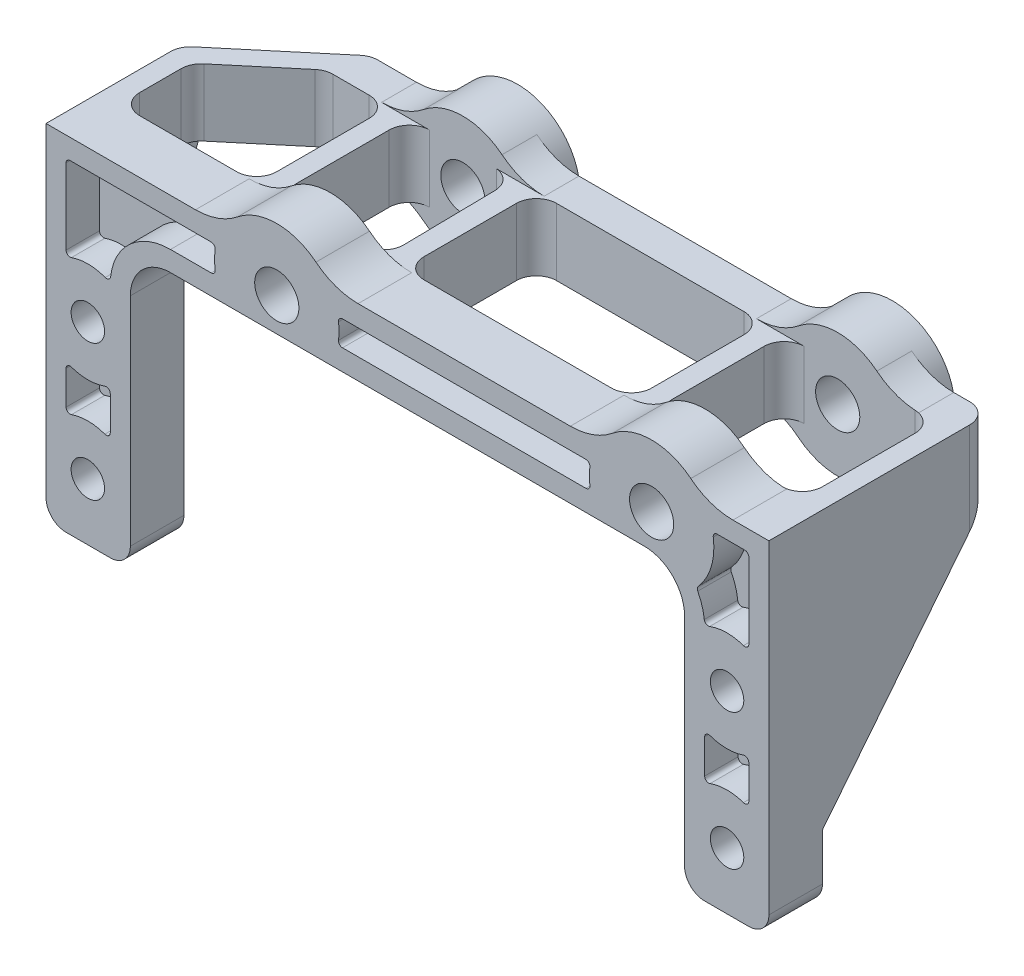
ISO-10303-21;
HEADER;
FILE_DESCRIPTION(('STEP AP214'),'2;1');
FILE_NAME('part.step','',(''),(''),'','','');
FILE_SCHEMA(('AUTOMOTIVE_DESIGN { 1 0 10303 214 1 1 1 1 }'));
ENDSEC;
DATA;
#1=APPLICATION_CONTEXT('core data for automotive mechanical design processes');
#2=APPLICATION_PROTOCOL_DEFINITION('international standard','automotive_design',2000,#1);
#3=PRODUCT_CONTEXT('',#1,'mechanical');
#4=PRODUCT('Part','Part','',(#3));
#5=PRODUCT_RELATED_PRODUCT_CATEGORY('part','',(#4));
#6=PRODUCT_DEFINITION_FORMATION('','',#4);
#7=PRODUCT_DEFINITION_CONTEXT('part definition',#1,'design');
#8=PRODUCT_DEFINITION('design','',#6,#7);
#9=PRODUCT_DEFINITION_SHAPE('','',#8);
#10=(LENGTH_UNIT() NAMED_UNIT(*) SI_UNIT(.MILLI.,.METRE.));
#11=(NAMED_UNIT(*) PLANE_ANGLE_UNIT() SI_UNIT($,.RADIAN.));
#12=(NAMED_UNIT(*) SI_UNIT($,.STERADIAN.) SOLID_ANGLE_UNIT());
#13=UNCERTAINTY_MEASURE_WITH_UNIT(LENGTH_MEASURE(1.E-05),#10,'distance_accuracy_value','');
#14=(GEOMETRIC_REPRESENTATION_CONTEXT(3) GLOBAL_UNCERTAINTY_ASSIGNED_CONTEXT((#13)) GLOBAL_UNIT_ASSIGNED_CONTEXT((#10,
#11,#12)) REPRESENTATION_CONTEXT('',''));
#15=CARTESIAN_POINT('',(0.,0.,0.));
#16=DIRECTION('',(0.,0.,1.));
#17=DIRECTION('',(1.,0.,0.));
#18=AXIS2_PLACEMENT_3D('',#15,#16,#17);
#19=CARTESIAN_POINT('',(64.24,13.85,-22.9843634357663));
#20=DIRECTION('',(0.,0.,1.));
#21=DIRECTION('',(1.,0.,0.));
#22=AXIS2_PLACEMENT_3D('',#19,#20,#21);
#23=CYLINDRICAL_SURFACE('',#22,4.64999999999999);
#24=DIRECTION('',(0.,0.,1.));
#25=VECTOR('',#24,1.);
#26=CARTESIAN_POINT('',(68.851088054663,13.2496942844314,-22.9843634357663));
#27=LINE('',#26,#25);
#28=CARTESIAN_POINT('',(68.851088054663,13.2496942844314,0.));
#29=VERTEX_POINT('',#28);
#30=CARTESIAN_POINT('',(68.851088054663,13.2496942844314,-2.50000000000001));
#31=VERTEX_POINT('',#30);
#32=EDGE_CURVE('E808',#29,#31,#27,.F.);
#33=ORIENTED_EDGE('',*,*,#32,.T.);
#34=CARTESIAN_POINT('',(64.24,13.85,-2.50000000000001));
#35=DIRECTION('',(0.,0.,1.));
#36=DIRECTION('',(1.,0.,0.));
#37=AXIS2_PLACEMENT_3D('',#34,#35,#36);
#38=CIRCLE('',#37,4.64999999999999);
#39=CARTESIAN_POINT('',(68.8515380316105,14.4468391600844,-2.50000000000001));
#40=VERTEX_POINT('',#39);
#41=EDGE_CURVE('E810',#31,#40,#38,.T.);
#42=ORIENTED_EDGE('',*,*,#41,.T.);
#43=DIRECTION('',(0.,0.,1.));
#44=VECTOR('',#43,1.);
#45=CARTESIAN_POINT('',(68.8515380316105,14.4468391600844,-22.9843634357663));
#46=LINE('',#45,#44);
#47=CARTESIAN_POINT('',(68.8515380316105,14.4468391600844,0.));
#48=VERTEX_POINT('',#47);
#49=EDGE_CURVE('E809',#40,#48,#46,.T.);
#50=ORIENTED_EDGE('',*,*,#49,.T.);
#51=CARTESIAN_POINT('',(64.24,13.85,0.));
#52=DIRECTION('',(0.,0.,1.));
#53=DIRECTION('',(1.,0.,0.));
#54=AXIS2_PLACEMENT_3D('',#51,#52,#53);
#55=CIRCLE('',#54,4.64999999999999);
#56=EDGE_CURVE('E20',#48,#29,#55,.F.);
#57=ORIENTED_EDGE('',*,*,#56,.T.);
#58=EDGE_LOOP('',(#33,#42,#50,#57));
#59=FACE_BOUND('',#58,.T.);
#60=ADVANCED_FACE('F17',(#59),#23,.T.);
#61=CARTESIAN_POINT('',(64.24,13.85,-18.));
#62=DIRECTION('',(0.,0.,-1.));
#63=DIRECTION('',(-1.,0.,0.));
#64=AXIS2_PLACEMENT_3D('',#61,#62,#63);
#65=PLANE('',#64);
#66=CARTESIAN_POINT('',(64.24,13.85,-18.));
#67=DIRECTION('',(0.,0.,1.));
#68=DIRECTION('',(1.,0.,0.));
#69=AXIS2_PLACEMENT_3D('',#66,#67,#68);
#70=CIRCLE('',#69,1.64999999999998);
#71=CARTESIAN_POINT('',(65.89,13.85,-18.));
#72=VERTEX_POINT('',#71);
#73=EDGE_CURVE('E1796',#72,#72,#70,.T.);
#74=ORIENTED_EDGE('',*,*,#73,.T.);
#75=EDGE_LOOP('',(#74));
#76=FACE_BOUND('',#75,.T.);
#77=CARTESIAN_POINT('',(64.24,13.85,-18.));
#78=DIRECTION('',(0.,0.,-1.));
#79=DIRECTION('',(-1.,0.,0.));
#80=AXIS2_PLACEMENT_3D('',#77,#78,#79);
#81=CIRCLE('',#80,4.64999999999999);
#82=CARTESIAN_POINT('',(59.59,13.85,-18.));
#83=VERTEX_POINT('',#82);
#84=EDGE_CURVE('E1251',#83,#83,#81,.F.);
#85=ORIENTED_EDGE('',*,*,#84,.F.);
#86=EDGE_LOOP('',(#85));
#87=FACE_BOUND('',#86,.T.);
#88=ADVANCED_FACE('F1289',(#76,#87),#65,.T.);
#89=CARTESIAN_POINT('',(92.24,13.85,-18.));
#90=DIRECTION('',(0.,0.,-1.));
#91=DIRECTION('',(-1.,0.,0.));
#92=AXIS2_PLACEMENT_3D('',#89,#90,#91);
#93=PLANE('',#92);
#94=CARTESIAN_POINT('',(92.24,13.85,-18.));
#95=DIRECTION('',(0.,0.,1.));
#96=DIRECTION('',(1.,0.,0.));
#97=AXIS2_PLACEMENT_3D('',#94,#95,#96);
#98=CIRCLE('',#97,1.64999999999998);
#99=CARTESIAN_POINT('',(93.89,13.85,-18.));
#100=VERTEX_POINT('',#99);
#101=EDGE_CURVE('E1252',#100,#100,#98,.T.);
#102=ORIENTED_EDGE('',*,*,#101,.T.);
#103=EDGE_LOOP('',(#102));
#104=FACE_BOUND('',#103,.T.);
#105=CARTESIAN_POINT('',(92.24,13.85,-18.));
#106=DIRECTION('',(0.,0.,-1.));
#107=DIRECTION('',(-1.,0.,0.));
#108=AXIS2_PLACEMENT_3D('',#105,#106,#107);
#109=CIRCLE('',#108,4.64999999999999);
#110=CARTESIAN_POINT('',(87.59,13.85,-18.));
#111=VERTEX_POINT('',#110);
#112=EDGE_CURVE('E1856',#111,#111,#109,.F.);
#113=ORIENTED_EDGE('',*,*,#112,.F.);
#114=EDGE_LOOP('',(#113));
#115=FACE_BOUND('',#114,.T.);
#116=ADVANCED_FACE('F1286',(#104,#115),#93,.T.);
#117=CARTESIAN_POINT('',(91.6999999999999,8.35000000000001,-22.9843634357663));
#118=DIRECTION('',(0.,0.,1.));
#119=DIRECTION('',(1.,0.,0.));
#120=AXIS2_PLACEMENT_3D('',#117,#118,#119);
#121=CYLINDRICAL_SURFACE('',#120,4.5);
#122=CARTESIAN_POINT('',(91.6999999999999,8.35000000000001,-2.50000000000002));
#123=DIRECTION('',(0.,0.,1.));
#124=DIRECTION('',(1.,0.,0.));
#125=AXIS2_PLACEMENT_3D('',#122,#123,#124);
#126=CIRCLE('',#125,4.5);
#127=CARTESIAN_POINT('',(96.1726117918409,8.84572548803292,-2.50000000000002));
#128=VERTEX_POINT('',#127);
#129=CARTESIAN_POINT('',(95.6868356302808,10.4368976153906,-2.50000000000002));
#130=VERTEX_POINT('',#129);
#131=EDGE_CURVE('E819',#128,#130,#126,.T.);
#132=ORIENTED_EDGE('',*,*,#131,.T.);
#133=DIRECTION('',(0.,0.,-1.));
#134=VECTOR('',#133,1.);
#135=CARTESIAN_POINT('',(95.6868356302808,10.4368976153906,-22.9843634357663));
#136=LINE('',#135,#134);
#137=CARTESIAN_POINT('',(95.6868356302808,10.4368976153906,0.));
#138=VERTEX_POINT('',#137);
#139=EDGE_CURVE('E1822',#130,#138,#136,.F.);
#140=ORIENTED_EDGE('',*,*,#139,.T.);
#141=CARTESIAN_POINT('',(91.6999999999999,8.35000000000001,0.));
#142=DIRECTION('',(0.,0.,1.));
#143=DIRECTION('',(1.,0.,0.));
#144=AXIS2_PLACEMENT_3D('',#141,#142,#143);
#145=CIRCLE('',#144,4.5);
#146=CARTESIAN_POINT('',(96.1726117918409,8.84572548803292,0.));
#147=VERTEX_POINT('',#146);
#148=EDGE_CURVE('E2230',#138,#147,#145,.F.);
#149=ORIENTED_EDGE('',*,*,#148,.T.);
#150=DIRECTION('',(0.,0.,-1.));
#151=VECTOR('',#150,1.);
#152=CARTESIAN_POINT('',(96.1726117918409,8.84572548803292,-22.9843634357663));
#153=LINE('',#152,#151);
#154=EDGE_CURVE('E822',#147,#128,#153,.T.);
#155=ORIENTED_EDGE('',*,*,#154,.T.);
#156=EDGE_LOOP('',(#132,#140,#149,#155));
#157=FACE_BOUND('',#156,.T.);
#158=ADVANCED_FACE('F1282',(#157),#121,.T.);
#159=CARTESIAN_POINT('',(92.24,13.85,-22.9843634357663));
#160=DIRECTION('',(0.,0.,1.));
#161=DIRECTION('',(1.,0.,0.));
#162=AXIS2_PLACEMENT_3D('',#159,#160,#161);
#163=CYLINDRICAL_SURFACE('',#162,4.64999999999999);
#164=DIRECTION('',(0.,0.,1.));
#165=VECTOR('',#164,1.);
#166=CARTESIAN_POINT('',(87.628911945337,13.2496942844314,-22.9843634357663));
#167=LINE('',#166,#165);
#168=CARTESIAN_POINT('',(87.6289119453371,13.2496942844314,-2.50000000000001));
#169=VERTEX_POINT('',#168);
#170=CARTESIAN_POINT('',(87.6289119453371,13.2496942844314,0.));
#171=VERTEX_POINT('',#170);
#172=EDGE_CURVE('E1815',#169,#171,#167,.T.);
#173=ORIENTED_EDGE('',*,*,#172,.T.);
#174=CARTESIAN_POINT('',(92.24,13.85,0.));
#175=DIRECTION('',(0.,0.,1.));
#176=DIRECTION('',(1.,0.,0.));
#177=AXIS2_PLACEMENT_3D('',#174,#175,#176);
#178=CIRCLE('',#177,4.64999999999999);
#179=CARTESIAN_POINT('',(87.6284619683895,14.4468391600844,0.));
#180=VERTEX_POINT('',#179);
#181=EDGE_CURVE('E815',#171,#180,#178,.F.);
#182=ORIENTED_EDGE('',*,*,#181,.T.);
#183=DIRECTION('',(0.,0.,1.));
#184=VECTOR('',#183,1.);
#185=CARTESIAN_POINT('',(87.6284619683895,14.4468391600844,-22.9843634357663));
#186=LINE('',#185,#184);
#187=CARTESIAN_POINT('',(87.6284619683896,14.4468391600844,-2.50000000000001));
#188=VERTEX_POINT('',#187);
#189=EDGE_CURVE('E803',#180,#188,#186,.F.);
#190=ORIENTED_EDGE('',*,*,#189,.T.);
#191=CARTESIAN_POINT('',(92.24,13.85,-2.50000000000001));
#192=DIRECTION('',(0.,0.,1.));
#193=DIRECTION('',(1.,0.,0.));
#194=AXIS2_PLACEMENT_3D('',#191,#192,#193);
#195=CIRCLE('',#194,4.64999999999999);
#196=EDGE_CURVE('E1982',#169,#188,#195,.F.);
#197=ORIENTED_EDGE('',*,*,#196,.F.);
#198=EDGE_LOOP('',(#173,#182,#190,#197));
#199=FACE_BOUND('',#198,.T.);
#200=ADVANCED_FACE('F1278',(#199),#163,.T.);
#201=CARTESIAN_POINT('',(64.24,13.85,-22.9843634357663));
#202=DIRECTION('',(0.,0.,1.));
#203=DIRECTION('',(1.,0.,0.));
#204=AXIS2_PLACEMENT_3D('',#201,#202,#203);
#205=CYLINDRICAL_SURFACE('',#204,4.64999999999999);
#206=DIRECTION('',(0.,0.,1.));
#207=VECTOR('',#206,1.);
#208=CARTESIAN_POINT('',(59.6367300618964,13.1924242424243,-22.9843634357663));
#209=LINE('',#208,#207);
#210=CARTESIAN_POINT('',(59.6367300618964,13.1924242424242,-2.5));
#211=VERTEX_POINT('',#210);
#212=CARTESIAN_POINT('',(59.6367300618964,13.1924242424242,0.));
#213=VERTEX_POINT('',#212);
#214=EDGE_CURVE('E1805',#211,#213,#209,.T.);
#215=ORIENTED_EDGE('',*,*,#214,.T.);
#216=CARTESIAN_POINT('',(64.24,13.85,0.));
#217=DIRECTION('',(0.,0.,1.));
#218=DIRECTION('',(1.,0.,0.));
#219=AXIS2_PLACEMENT_3D('',#216,#217,#218);
#220=CIRCLE('',#219,4.64999999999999);
#221=CARTESIAN_POINT('',(59.6367300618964,14.5075757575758,0.));
#222=VERTEX_POINT('',#221);
#223=EDGE_CURVE('E1802',#213,#222,#220,.F.);
#224=ORIENTED_EDGE('',*,*,#223,.T.);
#225=DIRECTION('',(0.,0.,1.));
#226=VECTOR('',#225,1.);
#227=CARTESIAN_POINT('',(59.6367300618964,14.5075757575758,-22.9843634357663));
#228=LINE('',#227,#226);
#229=CARTESIAN_POINT('',(59.6367300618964,14.5075757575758,-2.5));
#230=VERTEX_POINT('',#229);
#231=EDGE_CURVE('E1810',#222,#230,#228,.F.);
#232=ORIENTED_EDGE('',*,*,#231,.T.);
#233=CARTESIAN_POINT('',(64.24,13.85,-2.5));
#234=DIRECTION('',(0.,0.,1.));
#235=DIRECTION('',(1.,0.,0.));
#236=AXIS2_PLACEMENT_3D('',#233,#234,#235);
#237=CIRCLE('',#236,4.64999999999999);
#238=EDGE_CURVE('E817',#230,#211,#237,.T.);
#239=ORIENTED_EDGE('',*,*,#238,.T.);
#240=EDGE_LOOP('',(#215,#224,#232,#239));
#241=FACE_BOUND('',#240,.T.);
#242=ADVANCED_FACE('F1274',(#241),#205,.T.);
#243=CARTESIAN_POINT('',(101.,11.35,16.4));
#244=DIRECTION('',(0.,-1.,0.));
#245=DIRECTION('',(0.,0.,-1.));
#246=AXIS2_PLACEMENT_3D('',#243,#244,#245);
#247=PLANE('',#246);
#248=DIRECTION('',(1.,0.,0.));
#249=VECTOR('',#248,1.);
#250=CARTESIAN_POINT('',(101.,11.35,-4.));
#251=LINE('',#250,#249);
#252=CARTESIAN_POINT('',(50.,11.35,-4.));
#253=VERTEX_POINT('',#252);
#254=CARTESIAN_POINT('',(48.5,11.35,-4.));
#255=VERTEX_POINT('',#254);
#256=EDGE_CURVE('E1797',#253,#255,#251,.F.);
#257=ORIENTED_EDGE('',*,*,#256,.T.);
#258=DIRECTION('',(0.,0.,-1.));
#259=VECTOR('',#258,1.);
#260=CARTESIAN_POINT('',(48.5,11.35,16.4));
#261=LINE('',#260,#259);
#262=CARTESIAN_POINT('',(48.5,11.35,-5.5));
#263=VERTEX_POINT('',#262);
#264=EDGE_CURVE('E1794',#255,#263,#261,.T.);
#265=ORIENTED_EDGE('',*,*,#264,.T.);
#266=CARTESIAN_POINT('',(50.,11.35,-5.5));
#267=DIRECTION('',(0.,1.,0.));
#268=DIRECTION('',(0.,0.,1.));
#269=AXIS2_PLACEMENT_3D('',#266,#267,#268);
#270=CIRCLE('',#269,1.5);
#271=EDGE_CURVE('E1697',#263,#253,#270,.T.);
#272=ORIENTED_EDGE('',*,*,#271,.T.);
#273=EDGE_LOOP('',(#257,#265,#272));
#274=FACE_BOUND('',#273,.T.);
#275=ADVANCED_FACE('F1270',(#274),#247,.T.);
#276=CARTESIAN_POINT('',(64.24,13.85,-20.));
#277=DIRECTION('',(0.,0.,1.));
#278=DIRECTION('',(1.,0.,0.));
#279=AXIS2_PLACEMENT_3D('',#276,#277,#278);
#280=CYLINDRICAL_SURFACE('',#279,1.64999999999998);
#281=CARTESIAN_POINT('',(64.24,13.85,-13.9));
#282=DIRECTION('',(0.,0.,1.));
#283=DIRECTION('',(1.,0.,0.));
#284=AXIS2_PLACEMENT_3D('',#281,#282,#283);
#285=CIRCLE('',#284,1.64999999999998);
#286=CARTESIAN_POINT('',(65.89,13.85,-13.9));
#287=VERTEX_POINT('',#286);
#288=EDGE_CURVE('E1641',#287,#287,#285,.T.);
#289=ORIENTED_EDGE('',*,*,#288,.T.);
#290=EDGE_LOOP('',(#289));
#291=FACE_BOUND('',#290,.T.);
#292=ORIENTED_EDGE('',*,*,#73,.F.);
#293=EDGE_LOOP('',(#292));
#294=FACE_BOUND('',#293,.T.);
#295=ADVANCED_FACE('F1266',(#291,#294),#280,.F.);
#296=CARTESIAN_POINT('',(64.24,13.85,-0.747813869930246));
#297=DIRECTION('',(0.,0.,-1.));
#298=DIRECTION('',(-1.,0.,0.));
#299=AXIS2_PLACEMENT_3D('',#296,#297,#298);
#300=CYLINDRICAL_SURFACE('',#299,4.64999999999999);
#301=CARTESIAN_POINT('',(64.24,13.85,-16.5));
#302=DIRECTION('',(0.,0.,-1.));
#303=DIRECTION('',(-1.,0.,0.));
#304=AXIS2_PLACEMENT_3D('',#301,#302,#303);
#305=CIRCLE('',#304,4.64999999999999);
#306=CARTESIAN_POINT('',(61.3139824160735,17.4639896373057,-16.5));
#307=VERTEX_POINT('',#306);
#308=CARTESIAN_POINT('',(61.3139824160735,10.2360103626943,-16.5));
#309=VERTEX_POINT('',#308);
#310=EDGE_CURVE('E1665',#307,#309,#305,.F.);
#311=ORIENTED_EDGE('',*,*,#310,.F.);
#312=DIRECTION('',(0.,0.,-1.));
#313=VECTOR('',#312,1.);
#314=CARTESIAN_POINT('',(61.3139824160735,17.4639896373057,-0.747813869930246));
#315=LINE('',#314,#313);
#316=CARTESIAN_POINT('',(61.3139824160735,17.4639896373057,-13.9));
#317=VERTEX_POINT('',#316);
#318=EDGE_CURVE('E1786',#307,#317,#315,.F.);
#319=ORIENTED_EDGE('',*,*,#318,.T.);
#320=CARTESIAN_POINT('',(64.24,13.85,-13.9));
#321=DIRECTION('',(0.,0.,-1.));
#322=DIRECTION('',(-1.,0.,0.));
#323=AXIS2_PLACEMENT_3D('',#320,#321,#322);
#324=CIRCLE('',#323,4.64999999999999);
#325=CARTESIAN_POINT('',(67.1660175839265,17.4639896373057,-13.9));
#326=VERTEX_POINT('',#325);
#327=EDGE_CURVE('E1920',#317,#326,#324,.T.);
#328=ORIENTED_EDGE('',*,*,#327,.T.);
#329=DIRECTION('',(0.,0.,-1.));
#330=VECTOR('',#329,1.);
#331=CARTESIAN_POINT('',(67.1660175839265,17.4639896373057,-0.747813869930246));
#332=LINE('',#331,#330);
#333=CARTESIAN_POINT('',(67.1660175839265,17.4639896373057,-16.5));
#334=VERTEX_POINT('',#333);
#335=EDGE_CURVE('E1779',#326,#334,#332,.T.);
#336=ORIENTED_EDGE('',*,*,#335,.T.);
#337=CARTESIAN_POINT('',(64.24,13.85,-16.5));
#338=DIRECTION('',(0.,0.,-1.));
#339=DIRECTION('',(-1.,0.,0.));
#340=AXIS2_PLACEMENT_3D('',#337,#338,#339);
#341=CIRCLE('',#340,4.64999999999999);
#342=CARTESIAN_POINT('',(67.1660175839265,10.2360103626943,-16.5));
#343=VERTEX_POINT('',#342);
#344=EDGE_CURVE('E1912',#343,#334,#341,.F.);
#345=ORIENTED_EDGE('',*,*,#344,.F.);
#346=DIRECTION('',(0.,0.,-1.));
#347=VECTOR('',#346,1.);
#348=CARTESIAN_POINT('',(67.1660175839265,10.2360103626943,-0.747813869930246));
#349=LINE('',#348,#347);
#350=CARTESIAN_POINT('',(67.1660175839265,10.2360103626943,-13.9));
#351=VERTEX_POINT('',#350);
#352=EDGE_CURVE('E1637',#343,#351,#349,.F.);
#353=ORIENTED_EDGE('',*,*,#352,.T.);
#354=CARTESIAN_POINT('',(64.24,13.85,-13.9));
#355=DIRECTION('',(0.,0.,-1.));
#356=DIRECTION('',(-1.,0.,0.));
#357=AXIS2_PLACEMENT_3D('',#354,#355,#356);
#358=CIRCLE('',#357,4.64999999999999);
#359=CARTESIAN_POINT('',(61.3139824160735,10.2360103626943,-13.9));
#360=VERTEX_POINT('',#359);
#361=EDGE_CURVE('E1925',#351,#360,#358,.T.);
#362=ORIENTED_EDGE('',*,*,#361,.T.);
#363=DIRECTION('',(0.,0.,-1.));
#364=VECTOR('',#363,1.);
#365=CARTESIAN_POINT('',(61.3139824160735,10.2360103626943,-0.747813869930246));
#366=LINE('',#365,#364);
#367=EDGE_CURVE('E1664',#360,#309,#366,.T.);
#368=ORIENTED_EDGE('',*,*,#367,.T.);
#369=EDGE_LOOP('',(#311,#319,#328,#336,#345,#353,#362,#368));
#370=FACE_BOUND('',#369,.T.);
#371=ORIENTED_EDGE('',*,*,#84,.T.);
#372=EDGE_LOOP('',(#371));
#373=FACE_BOUND('',#372,.T.);
#374=ADVANCED_FACE('F1261',(#370,#373),#300,.T.);
#375=CARTESIAN_POINT('',(98.3122730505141,6.35000000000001,-0.747813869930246));
#376=DIRECTION('',(0.,0.,-1.));
#377=DIRECTION('',(-1.,0.,0.));
#378=AXIS2_PLACEMENT_3D('',#375,#376,#377);
#379=CYLINDRICAL_SURFACE('',#378,5.);
#380=DIRECTION('',(0.,0.,-1.));
#381=VECTOR('',#380,1.);
#382=CARTESIAN_POINT('',(95.1660175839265,10.2360103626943,-0.747813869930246));
#383=LINE('',#382,#381);
#384=CARTESIAN_POINT('',(95.1660175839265,10.2360103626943,-16.5));
#385=VERTEX_POINT('',#384);
#386=CARTESIAN_POINT('',(95.1660175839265,10.2360103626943,-13.9));
#387=VERTEX_POINT('',#386);
#388=EDGE_CURVE('E1250',#385,#387,#383,.F.);
#389=ORIENTED_EDGE('',*,*,#388,.F.);
#390=CARTESIAN_POINT('',(98.3122730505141,6.35000000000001,-16.5));
#391=DIRECTION('',(0.,0.,-1.));
#392=DIRECTION('',(-1.,0.,0.));
#393=AXIS2_PLACEMENT_3D('',#390,#391,#392);
#394=CIRCLE('',#393,5.);
#395=CARTESIAN_POINT('',(98.3122730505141,11.35,-16.5));
#396=VERTEX_POINT('',#395);
#397=EDGE_CURVE('E1761',#396,#385,#394,.F.);
#398=ORIENTED_EDGE('',*,*,#397,.F.);
#399=DIRECTION('',(0.,0.,-1.));
#400=VECTOR('',#399,1.);
#401=CARTESIAN_POINT('',(98.3122730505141,11.35,16.4));
#402=LINE('',#401,#400);
#403=CARTESIAN_POINT('',(98.3122730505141,11.35,-13.8671351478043));
#404=VERTEX_POINT('',#403);
#405=EDGE_CURVE('E1768',#404,#396,#402,.T.);
#406=ORIENTED_EDGE('',*,*,#405,.F.);
#407=CARTESIAN_POINT('',(98.,11.340239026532,-13.9));
#408=CARTESIAN_POINT('',(98.0525695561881,11.3435102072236,-13.899990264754));
#409=CARTESIAN_POINT('',(98.1048770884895,11.3459592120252,-13.8972466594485));
#410=CARTESIAN_POINT('',(98.2089681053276,11.3492128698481,-13.8862917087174));
#411=CARTESIAN_POINT('',(98.2607515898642,11.3500175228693,-13.8780803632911));
#412=CARTESIAN_POINT('',(98.3122730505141,11.35,-13.8671351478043));
#413=B_SPLINE_CURVE_WITH_KNOTS('',3,(#407,#408,#409,#410,#411,#412),.UNSPECIFIED.,.F.,.F.,(4,2,
4),(0.,0.157309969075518,0.314619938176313),.UNSPECIFIED.);
#414=CARTESIAN_POINT('',(98.,11.340239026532,-13.9));
#415=VERTEX_POINT('',#414);
#416=EDGE_CURVE('E1243',#415,#404,#413,.T.);
#417=ORIENTED_EDGE('',*,*,#416,.F.);
#418=CARTESIAN_POINT('',(98.3122730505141,6.35000000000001,-13.9));
#419=DIRECTION('',(0.,0.,-1.));
#420=DIRECTION('',(-1.,0.,0.));
#421=AXIS2_PLACEMENT_3D('',#418,#419,#420);
#422=CIRCLE('',#421,5.);
#423=EDGE_CURVE('E1891',#415,#387,#422,.F.);
#424=ORIENTED_EDGE('',*,*,#423,.T.);
#425=EDGE_LOOP('',(#389,#398,#406,#417,#424));
#426=FACE_BOUND('',#425,.T.);
#427=ADVANCED_FACE('F1255',(#426),#379,.F.);
#428=CARTESIAN_POINT('',(92.24,13.85,-20.));
#429=DIRECTION('',(0.,0.,1.));
#430=DIRECTION('',(1.,0.,0.));
#431=AXIS2_PLACEMENT_3D('',#428,#429,#430);
#432=CYLINDRICAL_SURFACE('',#431,1.64999999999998);
#433=CARTESIAN_POINT('',(92.24,13.85,-13.9));
#434=DIRECTION('',(0.,0.,1.));
#435=DIRECTION('',(1.,0.,0.));
#436=AXIS2_PLACEMENT_3D('',#433,#434,#435);
#437=CIRCLE('',#436,1.64999999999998);
#438=CARTESIAN_POINT('',(93.89,13.85,-13.9));
#439=VERTEX_POINT('',#438);
#440=EDGE_CURVE('E1625',#439,#439,#437,.T.);
#441=ORIENTED_EDGE('',*,*,#440,.T.);
#442=EDGE_LOOP('',(#441));
#443=FACE_BOUND('',#442,.T.);
#444=ORIENTED_EDGE('',*,*,#101,.F.);
#445=EDGE_LOOP('',(#444));
#446=FACE_BOUND('',#445,.T.);
#447=ADVANCED_FACE('F1260',(#443,#446),#432,.F.);
#448=CARTESIAN_POINT('',(50.,11.35,-8.601077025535));
#449=DIRECTION('',(0.,1.,0.));
#450=DIRECTION('',(0.,0.,1.));
#451=AXIS2_PLACEMENT_3D('',#448,#449,#450);
#452=CYLINDRICAL_SURFACE('',#451,1.5);
#453=DIRECTION('',(0.,1.,0.));
#454=VECTOR('',#453,1.);
#455=CARTESIAN_POINT('',(49.0358185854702,11.35,-9.75014369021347));
#456=LINE('',#455,#454);
#457=CARTESIAN_POINT('',(49.0358185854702,11.35,-9.75014369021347));
#458=VERTEX_POINT('',#457);
#459=CARTESIAN_POINT('',(49.0358185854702,16.35,-9.75014369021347));
#460=VERTEX_POINT('',#459);
#461=EDGE_CURVE('E1602',#458,#460,#456,.T.);
#462=ORIENTED_EDGE('',*,*,#461,.T.);
#463=CARTESIAN_POINT('',(50.,16.35,-8.601077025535));
#464=DIRECTION('',(0.,1.,0.));
#465=DIRECTION('',(0.,0.,1.));
#466=AXIS2_PLACEMENT_3D('',#463,#464,#465);
#467=CIRCLE('',#466,1.5);
#468=CARTESIAN_POINT('',(48.5,16.35,-8.601077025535));
#469=VERTEX_POINT('',#468);
#470=EDGE_CURVE('E1870',#469,#460,#467,.F.);
#471=ORIENTED_EDGE('',*,*,#470,.F.);
#472=DIRECTION('',(0.,1.,0.));
#473=VECTOR('',#472,1.);
#474=CARTESIAN_POINT('',(48.5,11.35,-8.601077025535));
#475=LINE('',#474,#473);
#476=CARTESIAN_POINT('',(48.5,11.35,-8.601077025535));
#477=VERTEX_POINT('',#476);
#478=EDGE_CURVE('E1696',#469,#477,#475,.F.);
#479=ORIENTED_EDGE('',*,*,#478,.T.);
#480=CARTESIAN_POINT('',(50.,11.35,-8.601077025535));
#481=DIRECTION('',(0.,1.,0.));
#482=DIRECTION('',(0.,0.,1.));
#483=AXIS2_PLACEMENT_3D('',#480,#481,#482);
#484=CIRCLE('',#483,1.5);
#485=EDGE_CURVE('E1869',#458,#477,#484,.T.);
#486=ORIENTED_EDGE('',*,*,#485,.F.);
#487=EDGE_LOOP('',(#462,#471,#479,#486));
#488=FACE_BOUND('',#487,.T.);
#489=ADVANCED_FACE('F1878',(#488),#452,.F.);
#490=CARTESIAN_POINT('',(54.5273801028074,11.35,-12.4));
#491=DIRECTION('',(0.,1.,0.));
#492=DIRECTION('',(0.,0.,1.));
#493=AXIS2_PLACEMENT_3D('',#490,#491,#492);
#494=CYLINDRICAL_SURFACE('',#493,1.5);
#495=DIRECTION('',(0.,1.,0.));
#496=VECTOR('',#495,1.);
#497=CARTESIAN_POINT('',(54.5273801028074,11.35,-13.9));
#498=LINE('',#497,#496);
#499=CARTESIAN_POINT('',(54.5273801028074,11.35,-13.9));
#500=VERTEX_POINT('',#499);
#501=CARTESIAN_POINT('',(54.5273801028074,16.35,-13.9));
#502=VERTEX_POINT('',#501);
#503=EDGE_CURVE('E1607',#500,#502,#498,.T.);
#504=ORIENTED_EDGE('',*,*,#503,.T.);
#505=CARTESIAN_POINT('',(54.5273801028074,16.35,-12.4));
#506=DIRECTION('',(0.,1.,0.));
#507=DIRECTION('',(0.,0.,1.));
#508=AXIS2_PLACEMENT_3D('',#505,#506,#507);
#509=CIRCLE('',#508,1.5);
#510=CARTESIAN_POINT('',(53.5631986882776,16.35,-13.5490666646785));
#511=VERTEX_POINT('',#510);
#512=EDGE_CURVE('E1867',#511,#502,#509,.F.);
#513=ORIENTED_EDGE('',*,*,#512,.F.);
#514=DIRECTION('',(0.,1.,0.));
#515=VECTOR('',#514,1.);
#516=CARTESIAN_POINT('',(53.5631986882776,11.35,-13.5490666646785));
#517=LINE('',#516,#515);
#518=CARTESIAN_POINT('',(53.5631986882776,11.35,-13.5490666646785));
#519=VERTEX_POINT('',#518);
#520=EDGE_CURVE('E1597',#511,#519,#517,.F.);
#521=ORIENTED_EDGE('',*,*,#520,.T.);
#522=CARTESIAN_POINT('',(54.5273801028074,11.35,-12.4));
#523=DIRECTION('',(0.,1.,0.));
#524=DIRECTION('',(0.,0.,1.));
#525=AXIS2_PLACEMENT_3D('',#522,#523,#524);
#526=CIRCLE('',#525,1.5);
#527=EDGE_CURVE('E1865',#500,#519,#526,.T.);
#528=ORIENTED_EDGE('',*,*,#527,.F.);
#529=EDGE_LOOP('',(#504,#513,#521,#528));
#530=FACE_BOUND('',#529,.T.);
#531=ADVANCED_FACE('F1883',(#530),#494,.F.);
#532=CARTESIAN_POINT('',(55.2923537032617,11.35,-15.));
#533=DIRECTION('',(0.,1.,0.));
#534=DIRECTION('',(0.,0.,1.));
#535=AXIS2_PLACEMENT_3D('',#532,#533,#534);
#536=CYLINDRICAL_SURFACE('',#535,1.5);
#537=CARTESIAN_POINT('',(55.2923537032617,16.35,-15.));
#538=DIRECTION('',(0.,1.,0.));
#539=DIRECTION('',(0.,0.,1.));
#540=AXIS2_PLACEMENT_3D('',#537,#538,#539);
#541=CIRCLE('',#540,1.5);
#542=CARTESIAN_POINT('',(54.3281722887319,16.35,-16.1490666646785));
#543=VERTEX_POINT('',#542);
#544=CARTESIAN_POINT('',(55.2923537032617,16.35,-16.5));
#545=VERTEX_POINT('',#544);
#546=EDGE_CURVE('E1774',#543,#545,#541,.F.);
#547=ORIENTED_EDGE('',*,*,#546,.T.);
#548=DIRECTION('',(0.,1.,0.));
#549=VECTOR('',#548,1.);
#550=CARTESIAN_POINT('',(55.2923537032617,11.35,-16.5));
#551=LINE('',#550,#549);
#552=CARTESIAN_POINT('',(55.2923537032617,11.35,-16.5));
#553=VERTEX_POINT('',#552);
#554=EDGE_CURVE('E1661',#553,#545,#551,.T.);
#555=ORIENTED_EDGE('',*,*,#554,.F.);
#556=CARTESIAN_POINT('',(55.2923537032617,11.35,-15.));
#557=DIRECTION('',(0.,1.,0.));
#558=DIRECTION('',(0.,0.,1.));
#559=AXIS2_PLACEMENT_3D('',#556,#557,#558);
#560=CIRCLE('',#559,1.5);
#561=CARTESIAN_POINT('',(54.3281722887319,11.35,-16.1490666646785));
#562=VERTEX_POINT('',#561);
#563=EDGE_CURVE('E1863',#553,#562,#560,.T.);
#564=ORIENTED_EDGE('',*,*,#563,.T.);
#565=DIRECTION('',(0.,1.,0.));
#566=VECTOR('',#565,1.);
#567=CARTESIAN_POINT('',(54.3281722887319,11.35,-16.1490666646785));
#568=LINE('',#567,#566);
#569=EDGE_CURVE('E1594',#543,#562,#568,.F.);
#570=ORIENTED_EDGE('',*,*,#569,.F.);
#571=EDGE_LOOP('',(#547,#555,#564,#570));
#572=FACE_BOUND('',#571,.T.);
#573=ADVANCED_FACE('F2325',(#572),#536,.T.);
#574=CARTESIAN_POINT('',(101.,11.35,16.4));
#575=DIRECTION('',(0.,-1.,0.));
#576=DIRECTION('',(0.,0.,-1.));
#577=AXIS2_PLACEMENT_3D('',#574,#575,#576);
#578=PLANE('',#577);
#579=CARTESIAN_POINT('',(98.,11.35,-12.4));
#580=DIRECTION('',(0.,1.,0.));
#581=DIRECTION('',(0.,0.,1.));
#582=AXIS2_PLACEMENT_3D('',#579,#580,#581);
#583=CIRCLE('',#582,1.5);
#584=CARTESIAN_POINT('',(99.5,11.35,-12.4));
#585=VERTEX_POINT('',#584);
#586=EDGE_CURVE('E1560',#585,#404,#583,.T.);
#587=ORIENTED_EDGE('',*,*,#586,.T.);
#588=ORIENTED_EDGE('',*,*,#405,.T.);
#589=DIRECTION('',(-1.,0.,0.));
#590=VECTOR('',#589,1.);
#591=CARTESIAN_POINT('',(54.7463983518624,11.35,-16.5));
#592=LINE('',#591,#590);
#593=CARTESIAN_POINT('',(99.5,11.35,-16.5));
#594=VERTEX_POINT('',#593);
#595=EDGE_CURVE('E1755',#594,#396,#592,.T.);
#596=ORIENTED_EDGE('',*,*,#595,.F.);
#597=DIRECTION('',(0.,0.,-1.));
#598=VECTOR('',#597,1.);
#599=CARTESIAN_POINT('',(99.5,11.35,-12.4));
#600=LINE('',#599,#598);
#601=EDGE_CURVE('E1557',#594,#585,#600,.F.);
#602=ORIENTED_EDGE('',*,*,#601,.T.);
#603=EDGE_LOOP('',(#587,#588,#596,#602));
#604=FACE_BOUND('',#603,.T.);
#605=ADVANCED_FACE('F2321',(#604),#578,.T.);
#606=CARTESIAN_POINT('',(101.,11.35,16.4));
#607=DIRECTION('',(0.,-1.,0.));
#608=DIRECTION('',(0.,0.,-1.));
#609=AXIS2_PLACEMENT_3D('',#606,#607,#608);
#610=PLANE('',#609);
#611=DIRECTION('',(1.,0.,0.));
#612=VECTOR('',#611,1.);
#613=CARTESIAN_POINT('',(101.,11.35,-4.));
#614=LINE('',#613,#612);
#615=CARTESIAN_POINT('',(99.5,11.35,-4.00000000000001));
#616=VERTEX_POINT('',#615);
#617=CARTESIAN_POINT('',(98.,11.35,-4.00000000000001));
#618=VERTEX_POINT('',#617);
#619=EDGE_CURVE('E1766',#616,#618,#614,.F.);
#620=ORIENTED_EDGE('',*,*,#619,.T.);
#621=CARTESIAN_POINT('',(98.,11.35,-5.50000000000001));
#622=DIRECTION('',(0.,1.,0.));
#623=DIRECTION('',(0.,0.,1.));
#624=AXIS2_PLACEMENT_3D('',#621,#622,#623);
#625=CIRCLE('',#624,1.5);
#626=CARTESIAN_POINT('',(99.5,11.35,-5.50000000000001));
#627=VERTEX_POINT('',#626);
#628=EDGE_CURVE('E1553',#618,#627,#625,.T.);
#629=ORIENTED_EDGE('',*,*,#628,.T.);
#630=DIRECTION('',(0.,0.,-1.));
#631=VECTOR('',#630,1.);
#632=CARTESIAN_POINT('',(99.5,11.35,-12.4));
#633=LINE('',#632,#631);
#634=EDGE_CURVE('E1556',#627,#616,#633,.F.);
#635=ORIENTED_EDGE('',*,*,#634,.T.);
#636=EDGE_LOOP('',(#620,#629,#635));
#637=FACE_BOUND('',#636,.T.);
#638=ADVANCED_FACE('F2317',(#637),#610,.T.);
#639=CARTESIAN_POINT('',(54.7463983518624,11.35,-16.5));
#640=DIRECTION('',(0.,0.,-1.));
#641=DIRECTION('',(-1.,0.,0.));
#642=AXIS2_PLACEMENT_3D('',#639,#640,#641);
#643=PLANE('',#642);
#644=DIRECTION('',(0.,-1.,0.));
#645=VECTOR('',#644,1.);
#646=CARTESIAN_POINT('',(99.5,-10.35,-16.5));
#647=LINE('',#646,#645);
#648=CARTESIAN_POINT('',(99.5,16.35,-16.5));
#649=VERTEX_POINT('',#648);
#650=EDGE_CURVE('E1544',#594,#649,#647,.F.);
#651=ORIENTED_EDGE('',*,*,#650,.F.);
#652=ORIENTED_EDGE('',*,*,#595,.T.);
#653=ORIENTED_EDGE('',*,*,#397,.T.);
#654=CARTESIAN_POINT('',(92.24,13.85,-16.5));
#655=DIRECTION('',(0.,0.,-1.));
#656=DIRECTION('',(-1.,0.,0.));
#657=AXIS2_PLACEMENT_3D('',#654,#655,#656);
#658=CIRCLE('',#657,4.64999999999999);
#659=CARTESIAN_POINT('',(95.1660175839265,17.4639896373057,-16.5));
#660=VERTEX_POINT('',#659);
#661=EDGE_CURVE('E1758',#660,#385,#658,.T.);
#662=ORIENTED_EDGE('',*,*,#661,.F.);
#663=CARTESIAN_POINT('',(98.3122730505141,21.35,-16.5));
#664=DIRECTION('',(0.,0.,-1.));
#665=DIRECTION('',(-1.,0.,0.));
#666=AXIS2_PLACEMENT_3D('',#663,#664,#665);
#667=CIRCLE('',#666,5.);
#668=CARTESIAN_POINT('',(98.3122730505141,16.35,-16.5));
#669=VERTEX_POINT('',#668);
#670=EDGE_CURVE('E1230',#660,#669,#667,.F.);
#671=ORIENTED_EDGE('',*,*,#670,.T.);
#672=DIRECTION('',(-1.,0.,0.));
#673=VECTOR('',#672,1.);
#674=CARTESIAN_POINT('',(54.7463983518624,16.35,-16.5));
#675=LINE('',#674,#673);
#676=EDGE_CURVE('E1759',#669,#649,#675,.F.);
#677=ORIENTED_EDGE('',*,*,#676,.T.);
#678=EDGE_LOOP('',(#651,#652,#653,#662,#671,#677));
#679=FACE_BOUND('',#678,.T.);
#680=ADVANCED_FACE('F2313',(#679),#643,.T.);
#681=CARTESIAN_POINT('',(92.24,13.85,-0.747813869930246));
#682=DIRECTION('',(0.,0.,-1.));
#683=DIRECTION('',(-1.,0.,0.));
#684=AXIS2_PLACEMENT_3D('',#681,#682,#683);
#685=CYLINDRICAL_SURFACE('',#684,4.64999999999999);
#686=CARTESIAN_POINT('',(92.24,13.85,-16.5));
#687=DIRECTION('',(0.,0.,-1.));
#688=DIRECTION('',(-1.,0.,0.));
#689=AXIS2_PLACEMENT_3D('',#686,#687,#688);
#690=CIRCLE('',#689,4.64999999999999);
#691=CARTESIAN_POINT('',(89.3139824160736,17.4639896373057,-16.5));
#692=VERTEX_POINT('',#691);
#693=CARTESIAN_POINT('',(89.3139824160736,10.2360103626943,-16.5));
#694=VERTEX_POINT('',#693);
#695=EDGE_CURVE('E1784',#692,#694,#690,.F.);
#696=ORIENTED_EDGE('',*,*,#695,.F.);
#697=DIRECTION('',(0.,0.,-1.));
#698=VECTOR('',#697,1.);
#699=CARTESIAN_POINT('',(89.3139824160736,17.4639896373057,-0.747813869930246));
#700=LINE('',#699,#698);
#701=CARTESIAN_POINT('',(89.3139824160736,17.4639896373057,-13.9));
#702=VERTEX_POINT('',#701);
#703=EDGE_CURVE('E1777',#692,#702,#700,.F.);
#704=ORIENTED_EDGE('',*,*,#703,.T.);
#705=CARTESIAN_POINT('',(92.24,13.85,-13.9));
#706=DIRECTION('',(0.,0.,-1.));
#707=DIRECTION('',(-1.,0.,0.));
#708=AXIS2_PLACEMENT_3D('',#705,#706,#707);
#709=CIRCLE('',#708,4.64999999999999);
#710=CARTESIAN_POINT('',(95.1660175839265,17.4639896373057,-13.9));
#711=VERTEX_POINT('',#710);
#712=EDGE_CURVE('E1897',#702,#711,#709,.T.);
#713=ORIENTED_EDGE('',*,*,#712,.T.);
#714=DIRECTION('',(0.,0.,-1.));
#715=VECTOR('',#714,1.);
#716=CARTESIAN_POINT('',(95.1660175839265,17.4639896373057,-0.747813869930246));
#717=LINE('',#716,#715);
#718=EDGE_CURVE('E1618',#711,#660,#717,.T.);
#719=ORIENTED_EDGE('',*,*,#718,.T.);
#720=ORIENTED_EDGE('',*,*,#661,.T.);
#721=ORIENTED_EDGE('',*,*,#388,.T.);
#722=CARTESIAN_POINT('',(92.24,13.85,-13.9));
#723=DIRECTION('',(0.,0.,-1.));
#724=DIRECTION('',(-1.,0.,0.));
#725=AXIS2_PLACEMENT_3D('',#722,#723,#724);
#726=CIRCLE('',#725,4.64999999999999);
#727=CARTESIAN_POINT('',(89.3139824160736,10.2360103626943,-13.9));
#728=VERTEX_POINT('',#727);
#729=EDGE_CURVE('E1888',#387,#728,#726,.T.);
#730=ORIENTED_EDGE('',*,*,#729,.T.);
#731=DIRECTION('',(0.,0.,-1.));
#732=VECTOR('',#731,1.);
#733=CARTESIAN_POINT('',(89.3139824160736,10.2360103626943,-0.747813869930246));
#734=LINE('',#733,#732);
#735=EDGE_CURVE('E1781',#728,#694,#734,.T.);
#736=ORIENTED_EDGE('',*,*,#735,.T.);
#737=EDGE_LOOP('',(#696,#704,#713,#719,#720,#721,#730,#736));
#738=FACE_BOUND('',#737,.T.);
#739=ORIENTED_EDGE('',*,*,#112,.T.);
#740=EDGE_LOOP('',(#739));
#741=FACE_BOUND('',#740,.T.);
#742=ADVANCED_FACE('F2309',(#738,#741),#685,.T.);
#743=CARTESIAN_POINT('',(99.2,1.25287640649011,-22.9843634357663));
#744=DIRECTION('',(0.,0.,1.));
#745=DIRECTION('',(1.,0.,0.));
#746=AXIS2_PLACEMENT_3D('',#743,#744,#745);
#747=CYLINDRICAL_SURFACE('',#746,0.299999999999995);
#748=DIRECTION('',(0.,0.,1.));
#749=VECTOR('',#748,1.);
#750=CARTESIAN_POINT('',(99.1018518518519,1.5363670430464,-22.9843634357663));
#751=LINE('',#750,#749);
#752=CARTESIAN_POINT('',(99.1018518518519,1.5363670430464,-2.50000000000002));
#753=VERTEX_POINT('',#752);
#754=CARTESIAN_POINT('',(99.1018518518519,1.5363670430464,0.));
#755=VERTEX_POINT('',#754);
#756=EDGE_CURVE('E1534',#753,#755,#751,.T.);
#757=ORIENTED_EDGE('',*,*,#756,.F.);
#758=CARTESIAN_POINT('',(99.2,1.25287640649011,-2.50000000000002));
#759=DIRECTION('',(0.,0.,1.));
#760=DIRECTION('',(1.,0.,0.));
#761=AXIS2_PLACEMENT_3D('',#758,#759,#760);
#762=CIRCLE('',#761,0.299999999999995);
#763=CARTESIAN_POINT('',(99.5,1.25287640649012,-2.50000000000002));
#764=VERTEX_POINT('',#763);
#765=EDGE_CURVE('E1846',#764,#753,#762,.T.);
#766=ORIENTED_EDGE('',*,*,#765,.F.);
#767=DIRECTION('',(0.,0.,1.));
#768=VECTOR('',#767,1.);
#769=CARTESIAN_POINT('',(99.5,1.25287640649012,-22.9843634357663));
#770=LINE('',#769,#768);
#771=CARTESIAN_POINT('',(99.5,1.25287640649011,0.));
#772=VERTEX_POINT('',#771);
#773=EDGE_CURVE('E1527',#764,#772,#770,.T.);
#774=ORIENTED_EDGE('',*,*,#773,.T.);
#775=CARTESIAN_POINT('',(99.2,1.25287640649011,0.));
#776=DIRECTION('',(0.,0.,1.));
#777=DIRECTION('',(1.,0.,0.));
#778=AXIS2_PLACEMENT_3D('',#775,#776,#777);
#779=CIRCLE('',#778,0.299999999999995);
#780=EDGE_CURVE('E1854',#755,#772,#779,.F.);
#781=ORIENTED_EDGE('',*,*,#780,.F.);
#782=EDGE_LOOP('',(#757,#766,#774,#781));
#783=FACE_BOUND('',#782,.T.);
#784=ADVANCED_FACE('F2305',(#783),#747,.F.);
#785=CARTESIAN_POINT('',(99.2,-1.25287640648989,-22.9843634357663));
#786=DIRECTION('',(0.,0.,1.));
#787=DIRECTION('',(1.,0.,0.));
#788=AXIS2_PLACEMENT_3D('',#785,#786,#787);
#789=CYLINDRICAL_SURFACE('',#788,0.299999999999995);
#790=DIRECTION('',(0.,0.,1.));
#791=VECTOR('',#790,1.);
#792=CARTESIAN_POINT('',(99.5,-1.25287640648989,-22.9843634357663));
#793=LINE('',#792,#791);
#794=CARTESIAN_POINT('',(99.5,-1.25287640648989,0.));
#795=VERTEX_POINT('',#794);
#796=CARTESIAN_POINT('',(99.5,-1.25287640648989,-2.50000000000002));
#797=VERTEX_POINT('',#796);
#798=EDGE_CURVE('E1531',#795,#797,#793,.F.);
#799=ORIENTED_EDGE('',*,*,#798,.T.);
#800=CARTESIAN_POINT('',(99.2,-1.25287640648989,-2.50000000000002));
#801=DIRECTION('',(0.,0.,1.));
#802=DIRECTION('',(1.,0.,0.));
#803=AXIS2_PLACEMENT_3D('',#800,#801,#802);
#804=CIRCLE('',#803,0.299999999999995);
#805=CARTESIAN_POINT('',(99.1018518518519,-1.53636704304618,-2.50000000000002));
#806=VERTEX_POINT('',#805);
#807=EDGE_CURVE('E1838',#806,#797,#804,.T.);
#808=ORIENTED_EDGE('',*,*,#807,.F.);
#809=DIRECTION('',(0.,0.,1.));
#810=VECTOR('',#809,1.);
#811=CARTESIAN_POINT('',(99.1018518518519,-1.53636704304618,-22.9843634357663));
#812=LINE('',#811,#810);
#813=CARTESIAN_POINT('',(99.1018518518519,-1.53636704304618,0.));
#814=VERTEX_POINT('',#813);
#815=EDGE_CURVE('E1519',#814,#806,#812,.F.);
#816=ORIENTED_EDGE('',*,*,#815,.F.);
#817=CARTESIAN_POINT('',(99.2,-1.25287640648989,0.));
#818=DIRECTION('',(0.,0.,1.));
#819=DIRECTION('',(1.,0.,0.));
#820=AXIS2_PLACEMENT_3D('',#817,#818,#819);
#821=CIRCLE('',#820,0.299999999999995);
#822=EDGE_CURVE('E1852',#795,#814,#821,.F.);
#823=ORIENTED_EDGE('',*,*,#822,.F.);
#824=EDGE_LOOP('',(#799,#808,#816,#823));
#825=FACE_BOUND('',#824,.T.);
#826=ADVANCED_FACE('F2301',(#825),#789,.F.);
#827=CARTESIAN_POINT('',(96.5,-1.27055450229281,-22.9843634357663));
#828=DIRECTION('',(0.,0.,1.));
#829=DIRECTION('',(1.,0.,0.));
#830=AXIS2_PLACEMENT_3D('',#827,#828,#829);
#831=CYLINDRICAL_SURFACE('',#830,0.299999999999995);
#832=DIRECTION('',(0.,0.,1.));
#833=VECTOR('',#832,1.);
#834=CARTESIAN_POINT('',(96.6018518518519,-1.55273565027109,-22.9843634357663));
#835=LINE('',#834,#833);
#836=CARTESIAN_POINT('',(96.6018518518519,-1.55273565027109,-2.50000000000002));
#837=VERTEX_POINT('',#836);
#838=CARTESIAN_POINT('',(96.6018518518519,-1.55273565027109,0.));
#839=VERTEX_POINT('',#838);
#840=EDGE_CURVE('E1521',#837,#839,#835,.T.);
#841=ORIENTED_EDGE('',*,*,#840,.F.);
#842=CARTESIAN_POINT('',(96.5,-1.27055450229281,-2.50000000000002));
#843=DIRECTION('',(0.,0.,1.));
#844=DIRECTION('',(1.,0.,0.));
#845=AXIS2_PLACEMENT_3D('',#842,#843,#844);
#846=CIRCLE('',#845,0.299999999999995);
#847=CARTESIAN_POINT('',(96.2,-1.27055450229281,-2.50000000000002));
#848=VERTEX_POINT('',#847);
#849=EDGE_CURVE('E1841',#848,#837,#846,.T.);
#850=ORIENTED_EDGE('',*,*,#849,.F.);
#851=DIRECTION('',(0.,0.,1.));
#852=VECTOR('',#851,1.);
#853=CARTESIAN_POINT('',(96.2,-1.27055450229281,-22.9843634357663));
#854=LINE('',#853,#852);
#855=CARTESIAN_POINT('',(96.2,-1.27055450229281,0.));
#856=VERTEX_POINT('',#855);
#857=EDGE_CURVE('E1515',#848,#856,#854,.T.);
#858=ORIENTED_EDGE('',*,*,#857,.T.);
#859=CARTESIAN_POINT('',(96.5,-1.27055450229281,0.));
#860=DIRECTION('',(0.,0.,1.));
#861=DIRECTION('',(1.,0.,0.));
#862=AXIS2_PLACEMENT_3D('',#859,#860,#861);
#863=CIRCLE('',#862,0.299999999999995);
#864=EDGE_CURVE('E1850',#839,#856,#863,.F.);
#865=ORIENTED_EDGE('',*,*,#864,.F.);
#866=EDGE_LOOP('',(#841,#850,#858,#865));
#867=FACE_BOUND('',#866,.T.);
#868=ADVANCED_FACE('F2297',(#867),#831,.F.);
#869=CARTESIAN_POINT('',(96.5,1.270554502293,-22.9843634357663));
#870=DIRECTION('',(0.,0.,1.));
#871=DIRECTION('',(1.,0.,0.));
#872=AXIS2_PLACEMENT_3D('',#869,#870,#871);
#873=CYLINDRICAL_SURFACE('',#872,0.299999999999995);
#874=DIRECTION('',(0.,0.,1.));
#875=VECTOR('',#874,1.);
#876=CARTESIAN_POINT('',(96.2,1.270554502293,-22.9843634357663));
#877=LINE('',#876,#875);
#878=CARTESIAN_POINT('',(96.2,1.270554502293,0.));
#879=VERTEX_POINT('',#878);
#880=CARTESIAN_POINT('',(96.2,1.270554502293,-2.50000000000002));
#881=VERTEX_POINT('',#880);
#882=EDGE_CURVE('E1518',#879,#881,#877,.F.);
#883=ORIENTED_EDGE('',*,*,#882,.T.);
#884=CARTESIAN_POINT('',(96.5,1.270554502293,-2.50000000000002));
#885=DIRECTION('',(0.,0.,1.));
#886=DIRECTION('',(1.,0.,0.));
#887=AXIS2_PLACEMENT_3D('',#884,#885,#886);
#888=CIRCLE('',#887,0.299999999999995);
#889=CARTESIAN_POINT('',(96.6018518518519,1.55273565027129,-2.50000000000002));
#890=VERTEX_POINT('',#889);
#891=EDGE_CURVE('E1843',#890,#881,#888,.T.);
#892=ORIENTED_EDGE('',*,*,#891,.F.);
#893=DIRECTION('',(0.,0.,1.));
#894=VECTOR('',#893,1.);
#895=CARTESIAN_POINT('',(96.6018518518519,1.55273565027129,-22.9843634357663));
#896=LINE('',#895,#894);
#897=CARTESIAN_POINT('',(96.6018518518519,1.55273565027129,0.));
#898=VERTEX_POINT('',#897);
#899=EDGE_CURVE('E1533',#898,#890,#896,.F.);
#900=ORIENTED_EDGE('',*,*,#899,.F.);
#901=CARTESIAN_POINT('',(96.5,1.270554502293,0.));
#902=DIRECTION('',(0.,0.,1.));
#903=DIRECTION('',(1.,0.,0.));
#904=AXIS2_PLACEMENT_3D('',#901,#902,#903);
#905=CIRCLE('',#904,0.299999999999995);
#906=EDGE_CURVE('E1848',#879,#898,#905,.F.);
#907=ORIENTED_EDGE('',*,*,#906,.F.);
#908=EDGE_LOOP('',(#883,#892,#900,#907));
#909=FACE_BOUND('',#908,.T.);
#910=ADVANCED_FACE('F2293',(#909),#873,.F.);
#911=CARTESIAN_POINT('',(50.,11.35,-2.5));
#912=DIRECTION('',(0.,0.,1.));
#913=DIRECTION('',(1.,0.,0.));
#914=AXIS2_PLACEMENT_3D('',#911,#912,#913);
#915=PLANE('',#914);
#916=CARTESIAN_POINT('',(97.875,-5.07999999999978,-2.50000000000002));
#917=DIRECTION('',(0.,0.,1.));
#918=DIRECTION('',(1.,0.,0.));
#919=AXIS2_PLACEMENT_3D('',#916,#917,#918);
#920=CIRCLE('',#919,3.75);
#921=EDGE_CURVE('E1524',#806,#837,#920,.T.);
#922=ORIENTED_EDGE('',*,*,#921,.F.);
#923=ORIENTED_EDGE('',*,*,#807,.T.);
#924=DIRECTION('',(0.,1.,0.));
#925=VECTOR('',#924,1.);
#926=CARTESIAN_POINT('',(99.5,1.70037354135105,-2.50000000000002));
#927=LINE('',#926,#925);
#928=EDGE_CURVE('E1530',#797,#764,#927,.T.);
#929=ORIENTED_EDGE('',*,*,#928,.T.);
#930=ORIENTED_EDGE('',*,*,#765,.T.);
#931=CARTESIAN_POINT('',(97.875,5.07999999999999,-2.50000000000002));
#932=DIRECTION('',(0.,0.,1.));
#933=DIRECTION('',(1.,0.,0.));
#934=AXIS2_PLACEMENT_3D('',#931,#932,#933);
#935=CIRCLE('',#934,3.75);
#936=EDGE_CURVE('E1537',#890,#753,#935,.T.);
#937=ORIENTED_EDGE('',*,*,#936,.F.);
#938=ORIENTED_EDGE('',*,*,#891,.T.);
#939=DIRECTION('',(0.,-1.,0.));
#940=VECTOR('',#939,1.);
#941=CARTESIAN_POINT('',(96.2,1.72487332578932,-2.50000000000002));
#942=LINE('',#941,#940);
#943=EDGE_CURVE('E1513',#881,#848,#942,.T.);
#944=ORIENTED_EDGE('',*,*,#943,.T.);
#945=ORIENTED_EDGE('',*,*,#849,.T.);
#946=EDGE_LOOP('',(#922,#923,#929,#930,#937,#938,#944,#945));
#947=FACE_BOUND('',#946,.T.);
#948=ADVANCED_FACE('F2289',(#947),#915,.T.);
#949=CARTESIAN_POINT('',(99.2,8.90712359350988,-22.9843634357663));
#950=DIRECTION('',(0.,0.,1.));
#951=DIRECTION('',(1.,0.,0.));
#952=AXIS2_PLACEMENT_3D('',#949,#950,#951);
#953=CYLINDRICAL_SURFACE('',#952,0.299999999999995);
#954=DIRECTION('',(0.,0.,1.));
#955=VECTOR('',#954,1.);
#956=CARTESIAN_POINT('',(99.4999999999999,8.90712359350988,-22.9843634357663));
#957=LINE('',#956,#955);
#958=CARTESIAN_POINT('',(99.4999999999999,8.90712359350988,0.));
#959=VERTEX_POINT('',#958);
#960=CARTESIAN_POINT('',(99.4999999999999,8.90712359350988,-2.50000000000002));
#961=VERTEX_POINT('',#960);
#962=EDGE_CURVE('E1512',#959,#961,#957,.F.);
#963=ORIENTED_EDGE('',*,*,#962,.T.);
#964=CARTESIAN_POINT('',(99.2,8.90712359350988,-2.50000000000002));
#965=DIRECTION('',(0.,0.,1.));
#966=DIRECTION('',(1.,0.,0.));
#967=AXIS2_PLACEMENT_3D('',#964,#965,#966);
#968=CIRCLE('',#967,0.299999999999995);
#969=CARTESIAN_POINT('',(99.1018518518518,8.6236329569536,-2.50000000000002));
#970=VERTEX_POINT('',#969);
#971=EDGE_CURVE('E2001',#970,#961,#968,.T.);
#972=ORIENTED_EDGE('',*,*,#971,.F.);
#973=DIRECTION('',(0.,0.,1.));
#974=VECTOR('',#973,1.);
#975=CARTESIAN_POINT('',(99.1018518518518,8.6236329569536,-22.9843634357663));
#976=LINE('',#975,#974);
#977=CARTESIAN_POINT('',(99.1018518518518,8.6236329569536,0.));
#978=VERTEX_POINT('',#977);
#979=EDGE_CURVE('E1505',#978,#970,#976,.F.);
#980=ORIENTED_EDGE('',*,*,#979,.F.);
#981=CARTESIAN_POINT('',(99.2,8.90712359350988,0.));
#982=DIRECTION('',(0.,0.,1.));
#983=DIRECTION('',(1.,0.,0.));
#984=AXIS2_PLACEMENT_3D('',#981,#982,#983);
#985=CIRCLE('',#984,0.299999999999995);
#986=EDGE_CURVE('E1834',#959,#978,#985,.F.);
#987=ORIENTED_EDGE('',*,*,#986,.F.);
#988=EDGE_LOOP('',(#963,#972,#980,#987));
#989=FACE_BOUND('',#988,.T.);
#990=ADVANCED_FACE('F2285',(#989),#953,.F.);
#991=CARTESIAN_POINT('',(96.4707859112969,8.87877385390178,-22.9843634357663));
#992=DIRECTION('',(0.,0.,-1.));
#993=DIRECTION('',(-1.,0.,0.));
#994=AXIS2_PLACEMENT_3D('',#991,#992,#993);
#995=CYLINDRICAL_SURFACE('',#994,0.299999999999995);
#996=DIRECTION('',(0.,0.,1.));
#997=VECTOR('',#996,1.);
#998=CARTESIAN_POINT('',(96.5748017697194,8.59738319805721,-22.9843634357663));
#999=LINE('',#998,#997);
#1000=CARTESIAN_POINT('',(96.5748017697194,8.59738319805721,-2.50000000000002));
#1001=VERTEX_POINT('',#1000);
#1002=CARTESIAN_POINT('',(96.5748017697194,8.59738319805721,0.));
#1003=VERTEX_POINT('',#1002);
#1004=EDGE_CURVE('E1499',#1001,#1003,#999,.T.);
#1005=ORIENTED_EDGE('',*,*,#1004,.F.);
#1006=CARTESIAN_POINT('',(96.4707859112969,8.87877385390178,-2.50000000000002));
#1007=DIRECTION('',(0.,0.,-1.));
#1008=DIRECTION('',(-1.,0.,0.));
#1009=AXIS2_PLACEMENT_3D('',#1006,#1007,#1008);
#1010=CIRCLE('',#1009,0.299999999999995);
#1011=EDGE_CURVE('E2004',#128,#1001,#1010,.F.);
#1012=ORIENTED_EDGE('',*,*,#1011,.F.);
#1013=ORIENTED_EDGE('',*,*,#154,.F.);
#1014=CARTESIAN_POINT('',(96.4707859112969,8.87877385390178,0.));
#1015=DIRECTION('',(0.,0.,-1.));
#1016=DIRECTION('',(-1.,0.,0.));
#1017=AXIS2_PLACEMENT_3D('',#1014,#1015,#1016);
#1018=CIRCLE('',#1017,0.299999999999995);
#1019=EDGE_CURVE('E1825',#1003,#147,#1018,.T.);
#1020=ORIENTED_EDGE('',*,*,#1019,.F.);
#1021=EDGE_LOOP('',(#1005,#1012,#1013,#1020));
#1022=FACE_BOUND('',#1021,.T.);
#1023=ADVANCED_FACE('F2281',(#1022),#995,.F.);
#1024=CARTESIAN_POINT('',(95.9526246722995,10.5760241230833,-22.9843634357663));
#1025=DIRECTION('',(0.,0.,-1.));
#1026=DIRECTION('',(-1.,0.,0.));
#1027=AXIS2_PLACEMENT_3D('',#1024,#1025,#1026);
#1028=CYLINDRICAL_SURFACE('',#1027,0.299999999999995);
#1029=CARTESIAN_POINT('',(95.9526246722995,10.5760241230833,0.));
#1030=DIRECTION('',(0.,0.,-1.));
#1031=DIRECTION('',(-1.,0.,0.));
#1032=AXIS2_PLACEMENT_3D('',#1029,#1030,#1031);
#1033=CIRCLE('',#1032,0.299999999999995);
#1034=CARTESIAN_POINT('',(95.7276171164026,10.7744469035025,0.));
#1035=VERTEX_POINT('',#1034);
#1036=EDGE_CURVE('E1824',#138,#1035,#1033,.T.);
#1037=ORIENTED_EDGE('',*,*,#1036,.F.);
#1038=ORIENTED_EDGE('',*,*,#139,.F.);
#1039=CARTESIAN_POINT('',(95.9526246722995,10.5760241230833,-2.50000000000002));
#1040=DIRECTION('',(0.,0.,-1.));
#1041=DIRECTION('',(-1.,0.,0.));
#1042=AXIS2_PLACEMENT_3D('',#1039,#1040,#1041);
#1043=CIRCLE('',#1042,0.299999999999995);
#1044=CARTESIAN_POINT('',(95.7276171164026,10.7744469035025,-2.50000000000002));
#1045=VERTEX_POINT('',#1044);
#1046=EDGE_CURVE('E1992',#1045,#130,#1043,.F.);
#1047=ORIENTED_EDGE('',*,*,#1046,.F.);
#1048=DIRECTION('',(0.,0.,1.));
#1049=VECTOR('',#1048,1.);
#1050=CARTESIAN_POINT('',(95.7276171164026,10.7744469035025,-22.9843634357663));
#1051=LINE('',#1050,#1049);
#1052=EDGE_CURVE('E1498',#1035,#1045,#1051,.F.);
#1053=ORIENTED_EDGE('',*,*,#1052,.F.);
#1054=EDGE_LOOP('',(#1037,#1038,#1047,#1053));
#1055=FACE_BOUND('',#1054,.T.);
#1056=ADVANCED_FACE('F2278',(#1055),#1028,.F.);
#1057=CARTESIAN_POINT('',(97.1402550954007,14.55,-22.9843634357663));
#1058=DIRECTION('',(0.,0.,1.));
#1059=DIRECTION('',(1.,0.,0.));
#1060=AXIS2_PLACEMENT_3D('',#1057,#1058,#1059);
#1061=CYLINDRICAL_SURFACE('',#1060,0.299999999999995);
#1062=CARTESIAN_POINT('',(97.1402550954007,14.55,-2.50000000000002));
#1063=DIRECTION('',(0.,0.,1.));
#1064=DIRECTION('',(1.,0.,0.));
#1065=AXIS2_PLACEMENT_3D('',#1062,#1063,#1064);
#1066=CIRCLE('',#1065,0.299999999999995);
#1067=CARTESIAN_POINT('',(97.1402550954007,14.85,-2.50000000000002));
#1068=VERTEX_POINT('',#1067);
#1069=CARTESIAN_POINT('',(96.8432699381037,14.5075757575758,-2.50000000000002));
#1070=VERTEX_POINT('',#1069);
#1071=EDGE_CURVE('E1995',#1068,#1070,#1066,.T.);
#1072=ORIENTED_EDGE('',*,*,#1071,.F.);
#1073=DIRECTION('',(0.,0.,1.));
#1074=VECTOR('',#1073,1.);
#1075=CARTESIAN_POINT('',(97.1402550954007,14.85,-22.9843634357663));
#1076=LINE('',#1075,#1074);
#1077=CARTESIAN_POINT('',(97.1402550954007,14.85,0.));
#1078=VERTEX_POINT('',#1077);
#1079=EDGE_CURVE('E1489',#1068,#1078,#1076,.T.);
#1080=ORIENTED_EDGE('',*,*,#1079,.T.);
#1081=CARTESIAN_POINT('',(97.1402550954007,14.55,0.));
#1082=DIRECTION('',(0.,0.,1.));
#1083=DIRECTION('',(1.,0.,0.));
#1084=AXIS2_PLACEMENT_3D('',#1081,#1082,#1083);
#1085=CIRCLE('',#1084,0.299999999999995);
#1086=CARTESIAN_POINT('',(96.8432699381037,14.5075757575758,0.));
#1087=VERTEX_POINT('',#1086);
#1088=EDGE_CURVE('E1828',#1087,#1078,#1085,.F.);
#1089=ORIENTED_EDGE('',*,*,#1088,.F.);
#1090=DIRECTION('',(0.,0.,1.));
#1091=VECTOR('',#1090,1.);
#1092=CARTESIAN_POINT('',(96.8432699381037,14.5075757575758,-22.9843634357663));
#1093=LINE('',#1092,#1091);
#1094=EDGE_CURVE('E1495',#1070,#1087,#1093,.T.);
#1095=ORIENTED_EDGE('',*,*,#1094,.F.);
#1096=EDGE_LOOP('',(#1072,#1080,#1089,#1095));
#1097=FACE_BOUND('',#1096,.T.);
#1098=ADVANCED_FACE('F2013',(#1097),#1061,.F.);
#1099=CARTESIAN_POINT('',(99.1999999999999,14.55,-22.9843634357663));
#1100=DIRECTION('',(0.,0.,-1.));
#1101=DIRECTION('',(-1.,0.,0.));
#1102=AXIS2_PLACEMENT_3D('',#1099,#1100,#1101);
#1103=CYLINDRICAL_SURFACE('',#1102,0.299999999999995);
#1104=DIRECTION('',(0.,0.,1.));
#1105=VECTOR('',#1104,1.);
#1106=CARTESIAN_POINT('',(99.1999999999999,14.85,-22.9843634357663));
#1107=LINE('',#1106,#1105);
#1108=CARTESIAN_POINT('',(99.1999999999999,14.85,0.));
#1109=VERTEX_POINT('',#1108);
#1110=CARTESIAN_POINT('',(99.1999999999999,14.85,-2.50000000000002));
#1111=VERTEX_POINT('',#1110);
#1112=EDGE_CURVE('E1492',#1109,#1111,#1107,.F.);
#1113=ORIENTED_EDGE('',*,*,#1112,.T.);
#1114=CARTESIAN_POINT('',(99.1999999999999,14.55,-2.50000000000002));
#1115=DIRECTION('',(0.,0.,-1.));
#1116=DIRECTION('',(-1.,0.,0.));
#1117=AXIS2_PLACEMENT_3D('',#1114,#1115,#1116);
#1118=CIRCLE('',#1117,0.299999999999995);
#1119=CARTESIAN_POINT('',(99.4999999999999,14.55,-2.50000000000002));
#1120=VERTEX_POINT('',#1119);
#1121=EDGE_CURVE('E1998',#1120,#1111,#1118,.F.);
#1122=ORIENTED_EDGE('',*,*,#1121,.F.);
#1123=DIRECTION('',(0.,0.,1.));
#1124=VECTOR('',#1123,1.);
#1125=CARTESIAN_POINT('',(99.4999999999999,14.55,-22.9843634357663));
#1126=LINE('',#1125,#1124);
#1127=CARTESIAN_POINT('',(99.4999999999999,14.55,0.));
#1128=VERTEX_POINT('',#1127);
#1129=EDGE_CURVE('E1509',#1120,#1128,#1126,.T.);
#1130=ORIENTED_EDGE('',*,*,#1129,.T.);
#1131=CARTESIAN_POINT('',(99.1999999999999,14.55,0.));
#1132=DIRECTION('',(0.,0.,-1.));
#1133=DIRECTION('',(-1.,0.,0.));
#1134=AXIS2_PLACEMENT_3D('',#1131,#1132,#1133);
#1135=CIRCLE('',#1134,0.299999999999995);
#1136=EDGE_CURVE('E2006',#1109,#1128,#1135,.T.);
#1137=ORIENTED_EDGE('',*,*,#1136,.F.);
#1138=EDGE_LOOP('',(#1113,#1122,#1130,#1137));
#1139=FACE_BOUND('',#1138,.T.);
#1140=ADVANCED_FACE('F2271',(#1139),#1103,.F.);
#1141=CARTESIAN_POINT('',(50.,11.35,-2.5));
#1142=DIRECTION('',(0.,0.,1.));
#1143=DIRECTION('',(1.,0.,0.));
#1144=AXIS2_PLACEMENT_3D('',#1141,#1142,#1143);
#1145=PLANE('',#1144);
#1146=CARTESIAN_POINT('',(92.24,13.85,-2.50000000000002));
#1147=DIRECTION('',(0.,0.,1.));
#1148=DIRECTION('',(1.,0.,0.));
#1149=AXIS2_PLACEMENT_3D('',#1146,#1147,#1148);
#1150=CIRCLE('',#1149,4.64999999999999);
#1151=EDGE_CURVE('E1493',#1045,#1070,#1150,.T.);
#1152=ORIENTED_EDGE('',*,*,#1151,.F.);
#1153=ORIENTED_EDGE('',*,*,#1046,.T.);
#1154=ORIENTED_EDGE('',*,*,#131,.F.);
#1155=ORIENTED_EDGE('',*,*,#1011,.T.);
#1156=CARTESIAN_POINT('',(97.875,5.07999999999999,-2.50000000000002));
#1157=DIRECTION('',(0.,0.,1.));
#1158=DIRECTION('',(1.,0.,0.));
#1159=AXIS2_PLACEMENT_3D('',#1156,#1157,#1158);
#1160=CIRCLE('',#1159,3.75);
#1161=EDGE_CURVE('E1504',#970,#1001,#1160,.T.);
#1162=ORIENTED_EDGE('',*,*,#1161,.F.);
#1163=ORIENTED_EDGE('',*,*,#971,.T.);
#1164=DIRECTION('',(0.,1.,0.));
#1165=VECTOR('',#1164,1.);
#1166=CARTESIAN_POINT('',(99.4999999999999,8.45962645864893,-2.50000000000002));
#1167=LINE('',#1166,#1165);
#1168=EDGE_CURVE('E1508',#961,#1120,#1167,.T.);
#1169=ORIENTED_EDGE('',*,*,#1168,.T.);
#1170=ORIENTED_EDGE('',*,*,#1121,.T.);
#1171=DIRECTION('',(1.,0.,0.));
#1172=VECTOR('',#1171,1.);
#1173=CARTESIAN_POINT('',(99.4999999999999,14.85,-2.50000000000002));
#1174=LINE('',#1173,#1172);
#1175=EDGE_CURVE('E1487',#1111,#1068,#1174,.F.);
#1176=ORIENTED_EDGE('',*,*,#1175,.T.);
#1177=ORIENTED_EDGE('',*,*,#1071,.T.);
#1178=EDGE_LOOP('',(#1152,#1153,#1154,#1155,#1162,#1163,#1169,#1170,#1176,#1177));
#1179=FACE_BOUND('',#1178,.T.);
#1180=ADVANCED_FACE('F2268',(#1179),#1145,.T.);
#1181=CARTESIAN_POINT('',(69.149056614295,14.4853449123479,-22.9843634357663));
#1182=DIRECTION('',(0.,0.,1.));
#1183=DIRECTION('',(1.,0.,0.));
#1184=AXIS2_PLACEMENT_3D('',#1181,#1182,#1183);
#1185=CYLINDRICAL_SURFACE('',#1184,0.299999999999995);
#1186=CARTESIAN_POINT('',(69.149056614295,14.4853449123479,-2.50000000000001));
#1187=DIRECTION('',(0.,0.,1.));
#1188=DIRECTION('',(1.,0.,0.));
#1189=AXIS2_PLACEMENT_3D('',#1186,#1187,#1188);
#1190=CIRCLE('',#1189,0.299999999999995);
#1191=CARTESIAN_POINT('',(69.149056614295,14.7853449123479,-2.50000000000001));
#1192=VERTEX_POINT('',#1191);
#1193=EDGE_CURVE('E1985',#1192,#40,#1190,.T.);
#1194=ORIENTED_EDGE('',*,*,#1193,.F.);
#1195=DIRECTION('',(0.,0.,1.));
#1196=VECTOR('',#1195,1.);
#1197=CARTESIAN_POINT('',(69.149056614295,14.7853449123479,-22.9843634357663));
#1198=LINE('',#1197,#1196);
#1199=CARTESIAN_POINT('',(69.149056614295,14.7853449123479,0.));
#1200=VERTEX_POINT('',#1199);
#1201=EDGE_CURVE('E1484',#1192,#1200,#1198,.T.);
#1202=ORIENTED_EDGE('',*,*,#1201,.T.);
#1203=CARTESIAN_POINT('',(69.149056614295,14.4853449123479,0.));
#1204=DIRECTION('',(0.,0.,1.));
#1205=DIRECTION('',(1.,0.,0.));
#1206=AXIS2_PLACEMENT_3D('',#1203,#1204,#1205);
#1207=CIRCLE('',#1206,0.299999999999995);
#1208=EDGE_CURVE('E787',#48,#1200,#1207,.F.);
#1209=ORIENTED_EDGE('',*,*,#1208,.F.);
#1210=ORIENTED_EDGE('',*,*,#49,.F.);
#1211=EDGE_LOOP('',(#1194,#1202,#1209,#1210));
#1212=FACE_BOUND('',#1211,.T.);
#1213=ADVANCED_FACE('F2232',(#1212),#1185,.F.);
#1214=CARTESIAN_POINT('',(87.330943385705,14.4853449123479,-22.9843634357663));
#1215=DIRECTION('',(0.,0.,1.));
#1216=DIRECTION('',(1.,0.,0.));
#1217=AXIS2_PLACEMENT_3D('',#1214,#1215,#1216);
#1218=CYLINDRICAL_SURFACE('',#1217,0.299999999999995);
#1219=CARTESIAN_POINT('',(87.330943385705,14.4853449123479,-2.50000000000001));
#1220=DIRECTION('',(0.,0.,1.));
#1221=DIRECTION('',(1.,0.,0.));
#1222=AXIS2_PLACEMENT_3D('',#1219,#1220,#1221);
#1223=CIRCLE('',#1222,0.299999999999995);
#1224=CARTESIAN_POINT('',(87.330943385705,14.7853449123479,-2.50000000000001));
#1225=VERTEX_POINT('',#1224);
#1226=EDGE_CURVE('E802',#188,#1225,#1223,.T.);
#1227=ORIENTED_EDGE('',*,*,#1226,.F.);
#1228=ORIENTED_EDGE('',*,*,#189,.F.);
#1229=CARTESIAN_POINT('',(87.330943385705,14.4853449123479,0.));
#1230=DIRECTION('',(0.,0.,1.));
#1231=DIRECTION('',(1.,0.,0.));
#1232=AXIS2_PLACEMENT_3D('',#1229,#1230,#1231);
#1233=CIRCLE('',#1232,0.299999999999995);
#1234=CARTESIAN_POINT('',(87.330943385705,14.7853449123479,0.));
#1235=VERTEX_POINT('',#1234);
#1236=EDGE_CURVE('E1821',#1235,#180,#1233,.F.);
#1237=ORIENTED_EDGE('',*,*,#1236,.F.);
#1238=DIRECTION('',(0.,0.,1.));
#1239=VECTOR('',#1238,1.);
#1240=CARTESIAN_POINT('',(87.330943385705,14.7853449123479,-22.9843634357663));
#1241=LINE('',#1240,#1239);
#1242=EDGE_CURVE('E1486',#1235,#1225,#1241,.F.);
#1243=ORIENTED_EDGE('',*,*,#1242,.T.);
#1244=EDGE_LOOP('',(#1227,#1228,#1237,#1243));
#1245=FACE_BOUND('',#1244,.T.);
#1246=ADVANCED_FACE('F2241',(#1245),#1218,.F.);
#1247=CARTESIAN_POINT('',(69.1485776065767,13.2109648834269,-22.9843634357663));
#1248=DIRECTION('',(0.,0.,1.));
#1249=DIRECTION('',(1.,0.,0.));
#1250=AXIS2_PLACEMENT_3D('',#1247,#1248,#1249);
#1251=CYLINDRICAL_SURFACE('',#1250,0.299999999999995);
#1252=CARTESIAN_POINT('',(69.1485776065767,13.2109648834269,-2.50000000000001));
#1253=DIRECTION('',(0.,0.,1.));
#1254=DIRECTION('',(1.,0.,0.));
#1255=AXIS2_PLACEMENT_3D('',#1252,#1253,#1254);
#1256=CIRCLE('',#1255,0.299999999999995);
#1257=CARTESIAN_POINT('',(69.1485776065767,12.9109648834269,-2.50000000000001));
#1258=VERTEX_POINT('',#1257);
#1259=EDGE_CURVE('E813',#31,#1258,#1256,.T.);
#1260=ORIENTED_EDGE('',*,*,#1259,.F.);
#1261=ORIENTED_EDGE('',*,*,#32,.F.);
#1262=CARTESIAN_POINT('',(69.1485776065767,13.2109648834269,0.));
#1263=DIRECTION('',(0.,0.,1.));
#1264=DIRECTION('',(1.,0.,0.));
#1265=AXIS2_PLACEMENT_3D('',#1262,#1263,#1264);
#1266=CIRCLE('',#1265,0.299999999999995);
#1267=CARTESIAN_POINT('',(69.1485776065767,12.9109648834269,0.));
#1268=VERTEX_POINT('',#1267);
#1269=EDGE_CURVE('E792',#1268,#29,#1266,.F.);
#1270=ORIENTED_EDGE('',*,*,#1269,.F.);
#1271=DIRECTION('',(0.,0.,-1.));
#1272=VECTOR('',#1271,1.);
#1273=CARTESIAN_POINT('',(69.1485776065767,12.9109648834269,-22.9843634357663));
#1274=LINE('',#1273,#1272);
#1275=EDGE_CURVE('E1481',#1268,#1258,#1274,.T.);
#1276=ORIENTED_EDGE('',*,*,#1275,.T.);
#1277=EDGE_LOOP('',(#1260,#1261,#1270,#1276));
#1278=FACE_BOUND('',#1277,.T.);
#1279=ADVANCED_FACE('F811',(#1278),#1251,.F.);
#1280=CARTESIAN_POINT('',(50.,11.35,-2.5));
#1281=DIRECTION('',(0.,0.,1.));
#1282=DIRECTION('',(1.,0.,0.));
#1283=AXIS2_PLACEMENT_3D('',#1280,#1281,#1282);
#1284=PLANE('',#1283);
#1285=CARTESIAN_POINT('',(87.3314223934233,13.2109648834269,-2.50000000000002));
#1286=DIRECTION('',(0.,0.,1.));
#1287=DIRECTION('',(1.,0.,0.));
#1288=AXIS2_PLACEMENT_3D('',#1285,#1286,#1287);
#1289=CIRCLE('',#1288,0.299999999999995);
#1290=CARTESIAN_POINT('',(87.3314223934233,12.9109648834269,-2.50000000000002));
#1291=VERTEX_POINT('',#1290);
#1292=EDGE_CURVE('E1819',#1291,#169,#1289,.T.);
#1293=ORIENTED_EDGE('',*,*,#1292,.T.);
#1294=ORIENTED_EDGE('',*,*,#196,.T.);
#1295=ORIENTED_EDGE('',*,*,#1226,.T.);
#1296=DIRECTION('',(1.,0.,0.));
#1297=VECTOR('',#1296,1.);
#1298=CARTESIAN_POINT('',(68.7949566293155,14.7853449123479,-2.50000000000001));
#1299=LINE('',#1298,#1297);
#1300=EDGE_CURVE('E1483',#1225,#1192,#1299,.F.);
#1301=ORIENTED_EDGE('',*,*,#1300,.T.);
#1302=ORIENTED_EDGE('',*,*,#1193,.T.);
#1303=ORIENTED_EDGE('',*,*,#41,.F.);
#1304=ORIENTED_EDGE('',*,*,#1259,.T.);
#1305=DIRECTION('',(1.,0.,0.));
#1306=VECTOR('',#1305,1.);
#1307=CARTESIAN_POINT('',(68.7941973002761,12.9109648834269,-2.50000000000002));
#1308=LINE('',#1307,#1306);
#1309=EDGE_CURVE('E1480',#1258,#1291,#1308,.T.);
#1310=ORIENTED_EDGE('',*,*,#1309,.T.);
#1311=EDGE_LOOP('',(#1293,#1294,#1295,#1301,#1302,#1303,#1304,#1310));
#1312=FACE_BOUND('',#1311,.T.);
#1313=ADVANCED_FACE('F2236',(#1312),#1284,.T.);
#1314=CARTESIAN_POINT('',(87.3314223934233,13.2109648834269,-22.9843634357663));
#1315=DIRECTION('',(0.,0.,1.));
#1316=DIRECTION('',(1.,0.,0.));
#1317=AXIS2_PLACEMENT_3D('',#1314,#1315,#1316);
#1318=CYLINDRICAL_SURFACE('',#1317,0.299999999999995);
#1319=ORIENTED_EDGE('',*,*,#1292,.F.);
#1320=DIRECTION('',(0.,0.,-1.));
#1321=VECTOR('',#1320,1.);
#1322=CARTESIAN_POINT('',(87.3314223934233,12.9109648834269,-22.9843634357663));
#1323=LINE('',#1322,#1321);
#1324=CARTESIAN_POINT('',(87.3314223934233,12.9109648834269,0.));
#1325=VERTEX_POINT('',#1324);
#1326=EDGE_CURVE('E1477',#1291,#1325,#1323,.F.);
#1327=ORIENTED_EDGE('',*,*,#1326,.T.);
#1328=CARTESIAN_POINT('',(87.3314223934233,13.2109648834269,0.));
#1329=DIRECTION('',(0.,0.,1.));
#1330=DIRECTION('',(1.,0.,0.));
#1331=AXIS2_PLACEMENT_3D('',#1328,#1329,#1330);
#1332=CIRCLE('',#1331,0.299999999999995);
#1333=EDGE_CURVE('E1980',#171,#1325,#1332,.F.);
#1334=ORIENTED_EDGE('',*,*,#1333,.F.);
#1335=ORIENTED_EDGE('',*,*,#172,.F.);
#1336=EDGE_LOOP('',(#1319,#1327,#1334,#1335));
#1337=FACE_BOUND('',#1336,.T.);
#1338=ADVANCED_FACE('F2246',(#1337),#1318,.F.);
#1339=CARTESIAN_POINT('',(51.529214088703,8.87877385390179,-22.9843634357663));
#1340=DIRECTION('',(0.,0.,-1.));
#1341=DIRECTION('',(-1.,0.,0.));
#1342=AXIS2_PLACEMENT_3D('',#1339,#1340,#1341);
#1343=CYLINDRICAL_SURFACE('',#1342,0.300000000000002);
#1344=DIRECTION('',(0.,0.,1.));
#1345=VECTOR('',#1344,1.);
#1346=CARTESIAN_POINT('',(51.8273882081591,8.84572548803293,-22.9843634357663));
#1347=LINE('',#1346,#1345);
#1348=CARTESIAN_POINT('',(51.8273882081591,8.84572548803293,-2.5));
#1349=VERTEX_POINT('',#1348);
#1350=CARTESIAN_POINT('',(51.8273882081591,8.84572548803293,0.));
#1351=VERTEX_POINT('',#1350);
#1352=EDGE_CURVE('E1473',#1349,#1351,#1347,.T.);
#1353=ORIENTED_EDGE('',*,*,#1352,.F.);
#1354=CARTESIAN_POINT('',(51.529214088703,8.87877385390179,-2.5));
#1355=DIRECTION('',(0.,0.,-1.));
#1356=DIRECTION('',(-1.,0.,0.));
#1357=AXIS2_PLACEMENT_3D('',#1354,#1355,#1356);
#1358=CIRCLE('',#1357,0.300000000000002);
#1359=CARTESIAN_POINT('',(51.4251982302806,8.59738319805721,-2.5));
#1360=VERTEX_POINT('',#1359);
#1361=EDGE_CURVE('E1962',#1360,#1349,#1358,.F.);
#1362=ORIENTED_EDGE('',*,*,#1361,.F.);
#1363=DIRECTION('',(0.,0.,1.));
#1364=VECTOR('',#1363,1.);
#1365=CARTESIAN_POINT('',(51.4251982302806,8.59738319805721,-22.9843634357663));
#1366=LINE('',#1365,#1364);
#1367=CARTESIAN_POINT('',(51.4251982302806,8.59738319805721,0.));
#1368=VERTEX_POINT('',#1367);
#1369=EDGE_CURVE('E1466',#1368,#1360,#1366,.F.);
#1370=ORIENTED_EDGE('',*,*,#1369,.F.);
#1371=CARTESIAN_POINT('',(51.529214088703,8.87877385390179,0.));
#1372=DIRECTION('',(0.,0.,-1.));
#1373=DIRECTION('',(-1.,0.,0.));
#1374=AXIS2_PLACEMENT_3D('',#1371,#1372,#1373);
#1375=CIRCLE('',#1374,0.300000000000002);
#1376=EDGE_CURVE('E1818',#1351,#1368,#1375,.T.);
#1377=ORIENTED_EDGE('',*,*,#1376,.F.);
#1378=EDGE_LOOP('',(#1353,#1362,#1370,#1377));
#1379=FACE_BOUND('',#1378,.T.);
#1380=ADVANCED_FACE('F2250',(#1379),#1343,.F.);
#1381=CARTESIAN_POINT('',(48.8,8.90712359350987,-22.9843634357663));
#1382=DIRECTION('',(0.,0.,1.));
#1383=DIRECTION('',(1.,0.,0.));
#1384=AXIS2_PLACEMENT_3D('',#1381,#1382,#1383);
#1385=CYLINDRICAL_SURFACE('',#1384,0.300000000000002);
#1386=DIRECTION('',(0.,0.,1.));
#1387=VECTOR('',#1386,1.);
#1388=CARTESIAN_POINT('',(48.8981481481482,8.62363295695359,-22.9843634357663));
#1389=LINE('',#1388,#1387);
#1390=CARTESIAN_POINT('',(48.8981481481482,8.62363295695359,-2.5));
#1391=VERTEX_POINT('',#1390);
#1392=CARTESIAN_POINT('',(48.8981481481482,8.62363295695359,0.));
#1393=VERTEX_POINT('',#1392);
#1394=EDGE_CURVE('E1467',#1391,#1393,#1389,.T.);
#1395=ORIENTED_EDGE('',*,*,#1394,.F.);
#1396=CARTESIAN_POINT('',(48.8,8.90712359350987,-2.5));
#1397=DIRECTION('',(0.,0.,1.));
#1398=DIRECTION('',(1.,0.,0.));
#1399=AXIS2_PLACEMENT_3D('',#1396,#1397,#1398);
#1400=CIRCLE('',#1399,0.300000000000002);
#1401=CARTESIAN_POINT('',(48.5,8.90712359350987,-2.5));
#1402=VERTEX_POINT('',#1401);
#1403=EDGE_CURVE('E1964',#1402,#1391,#1400,.T.);
#1404=ORIENTED_EDGE('',*,*,#1403,.F.);
#1405=DIRECTION('',(0.,0.,1.));
#1406=VECTOR('',#1405,1.);
#1407=CARTESIAN_POINT('',(48.5,8.90712359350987,-22.9843634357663));
#1408=LINE('',#1407,#1406);
#1409=CARTESIAN_POINT('',(48.5,8.90712359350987,0.));
#1410=VERTEX_POINT('',#1409);
#1411=EDGE_CURVE('E1460',#1402,#1410,#1408,.T.);
#1412=ORIENTED_EDGE('',*,*,#1411,.T.);
#1413=CARTESIAN_POINT('',(48.8,8.90712359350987,0.));
#1414=DIRECTION('',(0.,0.,1.));
#1415=DIRECTION('',(1.,0.,0.));
#1416=AXIS2_PLACEMENT_3D('',#1413,#1414,#1415);
#1417=CIRCLE('',#1416,0.300000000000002);
#1418=EDGE_CURVE('E1975',#1393,#1410,#1417,.F.);
#1419=ORIENTED_EDGE('',*,*,#1418,.F.);
#1420=EDGE_LOOP('',(#1395,#1404,#1412,#1419));
#1421=FACE_BOUND('',#1420,.T.);
#1422=ADVANCED_FACE('F2256',(#1421),#1385,.F.);
#1423=CARTESIAN_POINT('',(59.3397449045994,14.55,-22.9843634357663));
#1424=DIRECTION('',(0.,0.,1.));
#1425=DIRECTION('',(1.,0.,0.));
#1426=AXIS2_PLACEMENT_3D('',#1423,#1424,#1425);
#1427=CYLINDRICAL_SURFACE('',#1426,0.300000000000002);
#1428=CARTESIAN_POINT('',(59.3397449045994,14.55,-2.5));
#1429=DIRECTION('',(0.,0.,1.));
#1430=DIRECTION('',(1.,0.,0.));
#1431=AXIS2_PLACEMENT_3D('',#1428,#1429,#1430);
#1432=CIRCLE('',#1431,0.300000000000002);
#1433=CARTESIAN_POINT('',(59.3397449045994,14.85,-2.5));
#1434=VERTEX_POINT('',#1433);
#1435=EDGE_CURVE('E1808',#230,#1434,#1432,.T.);
#1436=ORIENTED_EDGE('',*,*,#1435,.F.);
#1437=ORIENTED_EDGE('',*,*,#231,.F.);
#1438=CARTESIAN_POINT('',(59.3397449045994,14.55,0.));
#1439=DIRECTION('',(0.,0.,1.));
#1440=DIRECTION('',(1.,0.,0.));
#1441=AXIS2_PLACEMENT_3D('',#1438,#1439,#1440);
#1442=CIRCLE('',#1441,0.300000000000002);
#1443=CARTESIAN_POINT('',(59.3397449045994,14.85,0.));
#1444=VERTEX_POINT('',#1443);
#1445=EDGE_CURVE('E1814',#1444,#222,#1442,.F.);
#1446=ORIENTED_EDGE('',*,*,#1445,.F.);
#1447=DIRECTION('',(0.,0.,1.));
#1448=VECTOR('',#1447,1.);
#1449=CARTESIAN_POINT('',(59.3397449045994,14.85,-22.9843634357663));
#1450=LINE('',#1449,#1448);
#1451=EDGE_CURVE('E1458',#1444,#1434,#1450,.F.);
#1452=ORIENTED_EDGE('',*,*,#1451,.T.);
#1453=EDGE_LOOP('',(#1436,#1437,#1446,#1452));
#1454=FACE_BOUND('',#1453,.T.);
#1455=ADVANCED_FACE('F2223',(#1454),#1427,.F.);
#1456=CARTESIAN_POINT('',(48.8,14.55,-22.9843634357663));
#1457=DIRECTION('',(0.,0.,-1.));
#1458=DIRECTION('',(-1.,0.,0.));
#1459=AXIS2_PLACEMENT_3D('',#1456,#1457,#1458);
#1460=CYLINDRICAL_SURFACE('',#1459,0.300000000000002);
#1461=DIRECTION('',(0.,0.,1.));
#1462=VECTOR('',#1461,1.);
#1463=CARTESIAN_POINT('',(48.5,14.55,-22.9843634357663));
#1464=LINE('',#1463,#1462);
#1465=CARTESIAN_POINT('',(48.5,14.55,0.));
#1466=VERTEX_POINT('',#1465);
#1467=CARTESIAN_POINT('',(48.5,14.55,-2.5));
#1468=VERTEX_POINT('',#1467);
#1469=EDGE_CURVE('E1464',#1466,#1468,#1464,.F.);
#1470=ORIENTED_EDGE('',*,*,#1469,.T.);
#1471=CARTESIAN_POINT('',(48.8,14.55,-2.5));
#1472=DIRECTION('',(0.,0.,-1.));
#1473=DIRECTION('',(-1.,0.,0.));
#1474=AXIS2_PLACEMENT_3D('',#1471,#1472,#1473);
#1475=CIRCLE('',#1474,0.300000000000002);
#1476=CARTESIAN_POINT('',(48.8,14.85,-2.5));
#1477=VERTEX_POINT('',#1476);
#1478=EDGE_CURVE('E1966',#1477,#1468,#1475,.F.);
#1479=ORIENTED_EDGE('',*,*,#1478,.F.);
#1480=DIRECTION('',(0.,0.,1.));
#1481=VECTOR('',#1480,1.);
#1482=CARTESIAN_POINT('',(48.8,14.85,-22.9843634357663));
#1483=LINE('',#1482,#1481);
#1484=CARTESIAN_POINT('',(48.8,14.85,0.));
#1485=VERTEX_POINT('',#1484);
#1486=EDGE_CURVE('E1451',#1477,#1485,#1483,.T.);
#1487=ORIENTED_EDGE('',*,*,#1486,.T.);
#1488=CARTESIAN_POINT('',(48.8,14.55,0.));
#1489=DIRECTION('',(0.,0.,-1.));
#1490=DIRECTION('',(-1.,0.,0.));
#1491=AXIS2_PLACEMENT_3D('',#1488,#1489,#1490);
#1492=CIRCLE('',#1491,0.300000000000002);
#1493=EDGE_CURVE('E1813',#1466,#1485,#1492,.T.);
#1494=ORIENTED_EDGE('',*,*,#1493,.F.);
#1495=EDGE_LOOP('',(#1470,#1479,#1487,#1494));
#1496=FACE_BOUND('',#1495,.T.);
#1497=ADVANCED_FACE('F2213',(#1496),#1460,.F.);
#1498=CARTESIAN_POINT('',(59.3397449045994,13.15,-22.9843634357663));
#1499=DIRECTION('',(0.,0.,1.));
#1500=DIRECTION('',(1.,0.,0.));
#1501=AXIS2_PLACEMENT_3D('',#1498,#1499,#1500);
#1502=CYLINDRICAL_SURFACE('',#1501,0.300000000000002);
#1503=CARTESIAN_POINT('',(59.3397449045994,13.15,-2.5));
#1504=DIRECTION('',(0.,0.,1.));
#1505=DIRECTION('',(1.,0.,0.));
#1506=AXIS2_PLACEMENT_3D('',#1503,#1504,#1505);
#1507=CIRCLE('',#1506,0.300000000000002);
#1508=CARTESIAN_POINT('',(59.3397449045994,12.85,-2.5));
#1509=VERTEX_POINT('',#1508);
#1510=EDGE_CURVE('E1959',#1509,#211,#1507,.T.);
#1511=ORIENTED_EDGE('',*,*,#1510,.F.);
#1512=DIRECTION('',(0.,0.,-1.));
#1513=VECTOR('',#1512,1.);
#1514=CARTESIAN_POINT('',(59.3397449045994,12.85,-22.9843634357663));
#1515=LINE('',#1514,#1513);
#1516=CARTESIAN_POINT('',(59.3397449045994,12.85,0.));
#1517=VERTEX_POINT('',#1516);
#1518=EDGE_CURVE('E1447',#1509,#1517,#1515,.F.);
#1519=ORIENTED_EDGE('',*,*,#1518,.T.);
#1520=CARTESIAN_POINT('',(59.3397449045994,13.15,0.));
#1521=DIRECTION('',(0.,0.,1.));
#1522=DIRECTION('',(1.,0.,0.));
#1523=AXIS2_PLACEMENT_3D('',#1520,#1521,#1522);
#1524=CIRCLE('',#1523,0.300000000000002);
#1525=EDGE_CURVE('E1809',#213,#1517,#1524,.F.);
#1526=ORIENTED_EDGE('',*,*,#1525,.F.);
#1527=ORIENTED_EDGE('',*,*,#214,.F.);
#1528=EDGE_LOOP('',(#1511,#1519,#1526,#1527));
#1529=FACE_BOUND('',#1528,.T.);
#1530=ADVANCED_FACE('F2566',(#1529),#1502,.F.);
#1531=CARTESIAN_POINT('',(50.,11.35,-2.5));
#1532=DIRECTION('',(0.,0.,1.));
#1533=DIRECTION('',(1.,0.,0.));
#1534=AXIS2_PLACEMENT_3D('',#1531,#1532,#1533);
#1535=PLANE('',#1534);
#1536=ORIENTED_EDGE('',*,*,#238,.F.);
#1537=ORIENTED_EDGE('',*,*,#1435,.T.);
#1538=DIRECTION('',(1.,0.,0.));
#1539=VECTOR('',#1538,1.);
#1540=CARTESIAN_POINT('',(48.5,14.85,-2.5));
#1541=LINE('',#1540,#1539);
#1542=EDGE_CURVE('E1457',#1434,#1477,#1541,.F.);
#1543=ORIENTED_EDGE('',*,*,#1542,.T.);
#1544=ORIENTED_EDGE('',*,*,#1478,.T.);
#1545=DIRECTION('',(0.,1.,0.));
#1546=VECTOR('',#1545,1.);
#1547=CARTESIAN_POINT('',(48.5,8.45962645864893,-2.5));
#1548=LINE('',#1547,#1546);
#1549=EDGE_CURVE('E1463',#1468,#1402,#1548,.F.);
#1550=ORIENTED_EDGE('',*,*,#1549,.T.);
#1551=ORIENTED_EDGE('',*,*,#1403,.T.);
#1552=CARTESIAN_POINT('',(50.125,5.07999999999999,-2.5));
#1553=DIRECTION('',(0.,0.,1.));
#1554=DIRECTION('',(1.,0.,0.));
#1555=AXIS2_PLACEMENT_3D('',#1552,#1553,#1554);
#1556=CIRCLE('',#1555,3.75);
#1557=EDGE_CURVE('E1470',#1360,#1391,#1556,.T.);
#1558=ORIENTED_EDGE('',*,*,#1557,.F.);
#1559=ORIENTED_EDGE('',*,*,#1361,.T.);
#1560=CARTESIAN_POINT('',(56.3,8.35000000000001,-2.5));
#1561=DIRECTION('',(0.,0.,1.));
#1562=DIRECTION('',(1.,0.,0.));
#1563=AXIS2_PLACEMENT_3D('',#1560,#1561,#1562);
#1564=CIRCLE('',#1563,4.5);
#1565=CARTESIAN_POINT('',(56.3,12.85,-2.5));
#1566=VERTEX_POINT('',#1565);
#1567=EDGE_CURVE('E1476',#1566,#1349,#1564,.T.);
#1568=ORIENTED_EDGE('',*,*,#1567,.F.);
#1569=DIRECTION('',(1.,0.,0.));
#1570=VECTOR('',#1569,1.);
#1571=CARTESIAN_POINT('',(56.3,12.85,-2.5));
#1572=LINE('',#1571,#1570);
#1573=EDGE_CURVE('E1454',#1566,#1509,#1572,.T.);
#1574=ORIENTED_EDGE('',*,*,#1573,.T.);
#1575=ORIENTED_EDGE('',*,*,#1510,.T.);
#1576=EDGE_LOOP('',(#1536,#1537,#1543,#1544,#1550,#1551,#1558,#1559,#1568,#1574,#1575));
#1577=FACE_BOUND('',#1576,.T.);
#1578=ADVANCED_FACE('F2215',(#1577),#1535,.T.);
#1579=CARTESIAN_POINT('',(51.5,1.27055450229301,-22.9843634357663));
#1580=DIRECTION('',(0.,0.,1.));
#1581=DIRECTION('',(1.,0.,0.));
#1582=AXIS2_PLACEMENT_3D('',#1579,#1580,#1581);
#1583=CYLINDRICAL_SURFACE('',#1582,0.300000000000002);
#1584=DIRECTION('',(0.,0.,1.));
#1585=VECTOR('',#1584,1.);
#1586=CARTESIAN_POINT('',(51.3981481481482,1.55273565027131,-22.9843634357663));
#1587=LINE('',#1586,#1585);
#1588=CARTESIAN_POINT('',(51.3981481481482,1.55273565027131,-2.5));
#1589=VERTEX_POINT('',#1588);
#1590=CARTESIAN_POINT('',(51.3981481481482,1.55273565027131,0.));
#1591=VERTEX_POINT('',#1590);
#1592=EDGE_CURVE('E1441',#1589,#1591,#1587,.T.);
#1593=ORIENTED_EDGE('',*,*,#1592,.F.);
#1594=CARTESIAN_POINT('',(51.5,1.27055450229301,-2.5));
#1595=DIRECTION('',(0.,0.,1.));
#1596=DIRECTION('',(1.,0.,0.));
#1597=AXIS2_PLACEMENT_3D('',#1594,#1595,#1596);
#1598=CIRCLE('',#1597,0.300000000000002);
#1599=CARTESIAN_POINT('',(51.8,1.27055450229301,-2.5));
#1600=VERTEX_POINT('',#1599);
#1601=EDGE_CURVE('E1944',#1600,#1589,#1598,.T.);
#1602=ORIENTED_EDGE('',*,*,#1601,.F.);
#1603=DIRECTION('',(0.,0.,-1.));
#1604=VECTOR('',#1603,1.);
#1605=CARTESIAN_POINT('',(51.8,1.27055450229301,-22.9843634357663));
#1606=LINE('',#1605,#1604);
#1607=CARTESIAN_POINT('',(51.8,1.27055450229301,0.));
#1608=VERTEX_POINT('',#1607);
#1609=EDGE_CURVE('E1435',#1600,#1608,#1606,.F.);
#1610=ORIENTED_EDGE('',*,*,#1609,.T.);
#1611=CARTESIAN_POINT('',(51.5,1.27055450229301,0.));
#1612=DIRECTION('',(0.,0.,1.));
#1613=DIRECTION('',(1.,0.,0.));
#1614=AXIS2_PLACEMENT_3D('',#1611,#1612,#1613);
#1615=CIRCLE('',#1614,0.300000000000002);
#1616=EDGE_CURVE('E1957',#1591,#1608,#1615,.F.);
#1617=ORIENTED_EDGE('',*,*,#1616,.F.);
#1618=EDGE_LOOP('',(#1593,#1602,#1610,#1617));
#1619=FACE_BOUND('',#1618,.T.);
#1620=ADVANCED_FACE('F2559',(#1619),#1583,.F.);
#1621=CARTESIAN_POINT('',(51.5,-1.27055450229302,-22.9843634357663));
#1622=DIRECTION('',(0.,0.,1.));
#1623=DIRECTION('',(1.,0.,0.));
#1624=AXIS2_PLACEMENT_3D('',#1621,#1622,#1623);
#1625=CYLINDRICAL_SURFACE('',#1624,0.300000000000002);
#1626=DIRECTION('',(0.,0.,-1.));
#1627=VECTOR('',#1626,1.);
#1628=CARTESIAN_POINT('',(51.8,-1.27055450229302,-22.9843634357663));
#1629=LINE('',#1628,#1627);
#1630=CARTESIAN_POINT('',(51.8,-1.27055450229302,0.));
#1631=VERTEX_POINT('',#1630);
#1632=CARTESIAN_POINT('',(51.8,-1.27055450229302,-2.5));
#1633=VERTEX_POINT('',#1632);
#1634=EDGE_CURVE('E1438',#1631,#1633,#1629,.T.);
#1635=ORIENTED_EDGE('',*,*,#1634,.T.);
#1636=CARTESIAN_POINT('',(51.5,-1.27055450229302,-2.5));
#1637=DIRECTION('',(0.,0.,1.));
#1638=DIRECTION('',(1.,0.,0.));
#1639=AXIS2_PLACEMENT_3D('',#1636,#1637,#1638);
#1640=CIRCLE('',#1639,0.300000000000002);
#1641=CARTESIAN_POINT('',(51.3981481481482,-1.55273565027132,-2.5));
#1642=VERTEX_POINT('',#1641);
#1643=EDGE_CURVE('E1946',#1642,#1633,#1640,.T.);
#1644=ORIENTED_EDGE('',*,*,#1643,.F.);
#1645=DIRECTION('',(0.,0.,1.));
#1646=VECTOR('',#1645,1.);
#1647=CARTESIAN_POINT('',(51.3981481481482,-1.55273565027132,-22.9843634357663));
#1648=LINE('',#1647,#1646);
#1649=CARTESIAN_POINT('',(51.3981481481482,-1.55273565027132,0.));
#1650=VERTEX_POINT('',#1649);
#1651=EDGE_CURVE('E1431',#1650,#1642,#1648,.F.);
#1652=ORIENTED_EDGE('',*,*,#1651,.F.);
#1653=CARTESIAN_POINT('',(51.5,-1.27055450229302,0.));
#1654=DIRECTION('',(0.,0.,1.));
#1655=DIRECTION('',(1.,0.,0.));
#1656=AXIS2_PLACEMENT_3D('',#1653,#1654,#1655);
#1657=CIRCLE('',#1656,0.300000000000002);
#1658=EDGE_CURVE('E1955',#1631,#1650,#1657,.F.);
#1659=ORIENTED_EDGE('',*,*,#1658,.F.);
#1660=EDGE_LOOP('',(#1635,#1644,#1652,#1659));
#1661=FACE_BOUND('',#1660,.T.);
#1662=ADVANCED_FACE('F2555',(#1661),#1625,.F.);
#1663=CARTESIAN_POINT('',(48.8,-1.25287640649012,-22.9843634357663));
#1664=DIRECTION('',(0.,0.,1.));
#1665=DIRECTION('',(1.,0.,0.));
#1666=AXIS2_PLACEMENT_3D('',#1663,#1664,#1665);
#1667=CYLINDRICAL_SURFACE('',#1666,0.300000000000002);
#1668=DIRECTION('',(0.,0.,1.));
#1669=VECTOR('',#1668,1.);
#1670=CARTESIAN_POINT('',(48.8981481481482,-1.53636704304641,-22.9843634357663));
#1671=LINE('',#1670,#1669);
#1672=CARTESIAN_POINT('',(48.8981481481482,-1.53636704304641,-2.5));
#1673=VERTEX_POINT('',#1672);
#1674=CARTESIAN_POINT('',(48.8981481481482,-1.53636704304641,0.));
#1675=VERTEX_POINT('',#1674);
#1676=EDGE_CURVE('E1427',#1673,#1675,#1671,.T.);
#1677=ORIENTED_EDGE('',*,*,#1676,.F.);
#1678=CARTESIAN_POINT('',(48.8,-1.25287640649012,-2.5));
#1679=DIRECTION('',(0.,0.,1.));
#1680=DIRECTION('',(1.,0.,0.));
#1681=AXIS2_PLACEMENT_3D('',#1678,#1679,#1680);
#1682=CIRCLE('',#1681,0.300000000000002);
#1683=CARTESIAN_POINT('',(48.5,-1.25287640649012,-2.5));
#1684=VERTEX_POINT('',#1683);
#1685=EDGE_CURVE('E1949',#1684,#1673,#1682,.T.);
#1686=ORIENTED_EDGE('',*,*,#1685,.F.);
#1687=DIRECTION('',(0.,0.,1.));
#1688=VECTOR('',#1687,1.);
#1689=CARTESIAN_POINT('',(48.5,-1.25287640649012,-22.9843634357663));
#1690=LINE('',#1689,#1688);
#1691=CARTESIAN_POINT('',(48.5,-1.25287640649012,0.));
#1692=VERTEX_POINT('',#1691);
#1693=EDGE_CURVE('E1423',#1684,#1692,#1690,.T.);
#1694=ORIENTED_EDGE('',*,*,#1693,.T.);
#1695=CARTESIAN_POINT('',(48.8,-1.25287640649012,0.));
#1696=DIRECTION('',(0.,0.,1.));
#1697=DIRECTION('',(1.,0.,0.));
#1698=AXIS2_PLACEMENT_3D('',#1695,#1696,#1697);
#1699=CIRCLE('',#1698,0.300000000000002);
#1700=EDGE_CURVE('E1953',#1675,#1692,#1699,.F.);
#1701=ORIENTED_EDGE('',*,*,#1700,.F.);
#1702=EDGE_LOOP('',(#1677,#1686,#1694,#1701));
#1703=FACE_BOUND('',#1702,.T.);
#1704=ADVANCED_FACE('F2551',(#1703),#1667,.F.);
#1705=CARTESIAN_POINT('',(48.8,1.25287640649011,-22.9843634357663));
#1706=DIRECTION('',(0.,0.,1.));
#1707=DIRECTION('',(1.,0.,0.));
#1708=AXIS2_PLACEMENT_3D('',#1705,#1706,#1707);
#1709=CYLINDRICAL_SURFACE('',#1708,0.300000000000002);
#1710=DIRECTION('',(0.,0.,1.));
#1711=VECTOR('',#1710,1.);
#1712=CARTESIAN_POINT('',(48.5,1.25287640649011,-22.9843634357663));
#1713=LINE('',#1712,#1711);
#1714=CARTESIAN_POINT('',(48.5,1.25287640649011,0.));
#1715=VERTEX_POINT('',#1714);
#1716=CARTESIAN_POINT('',(48.5,1.25287640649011,-2.5));
#1717=VERTEX_POINT('',#1716);
#1718=EDGE_CURVE('E1426',#1715,#1717,#1713,.F.);
#1719=ORIENTED_EDGE('',*,*,#1718,.T.);
#1720=CARTESIAN_POINT('',(48.8,1.25287640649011,-2.5));
#1721=DIRECTION('',(0.,0.,1.));
#1722=DIRECTION('',(1.,0.,0.));
#1723=AXIS2_PLACEMENT_3D('',#1720,#1721,#1722);
#1724=CIRCLE('',#1723,0.300000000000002);
#1725=CARTESIAN_POINT('',(48.8981481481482,1.5363670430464,-2.5));
#1726=VERTEX_POINT('',#1725);
#1727=EDGE_CURVE('E1780',#1726,#1717,#1724,.T.);
#1728=ORIENTED_EDGE('',*,*,#1727,.F.);
#1729=DIRECTION('',(0.,0.,1.));
#1730=VECTOR('',#1729,1.);
#1731=CARTESIAN_POINT('',(48.8981481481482,1.5363670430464,-22.9843634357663));
#1732=LINE('',#1731,#1730);
#1733=CARTESIAN_POINT('',(48.8981481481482,1.5363670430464,0.));
#1734=VERTEX_POINT('',#1733);
#1735=EDGE_CURVE('E1439',#1734,#1726,#1732,.F.);
#1736=ORIENTED_EDGE('',*,*,#1735,.F.);
#1737=CARTESIAN_POINT('',(48.8,1.25287640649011,0.));
#1738=DIRECTION('',(0.,0.,1.));
#1739=DIRECTION('',(1.,0.,0.));
#1740=AXIS2_PLACEMENT_3D('',#1737,#1738,#1739);
#1741=CIRCLE('',#1740,0.300000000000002);
#1742=EDGE_CURVE('E1951',#1715,#1734,#1741,.F.);
#1743=ORIENTED_EDGE('',*,*,#1742,.F.);
#1744=EDGE_LOOP('',(#1719,#1728,#1736,#1743));
#1745=FACE_BOUND('',#1744,.T.);
#1746=ADVANCED_FACE('F2547',(#1745),#1709,.F.);
#1747=CARTESIAN_POINT('',(50.,11.35,-2.5));
#1748=DIRECTION('',(0.,0.,1.));
#1749=DIRECTION('',(1.,0.,0.));
#1750=AXIS2_PLACEMENT_3D('',#1747,#1748,#1749);
#1751=PLANE('',#1750);
#1752=CARTESIAN_POINT('',(50.125,5.07999999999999,-2.5));
#1753=DIRECTION('',(0.,0.,1.));
#1754=DIRECTION('',(1.,0.,0.));
#1755=AXIS2_PLACEMENT_3D('',#1752,#1753,#1754);
#1756=CIRCLE('',#1755,3.75);
#1757=EDGE_CURVE('E1444',#1726,#1589,#1756,.T.);
#1758=ORIENTED_EDGE('',*,*,#1757,.F.);
#1759=ORIENTED_EDGE('',*,*,#1727,.T.);
#1760=DIRECTION('',(0.,1.,0.));
#1761=VECTOR('',#1760,1.);
#1762=CARTESIAN_POINT('',(48.5,1.70037354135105,-2.5));
#1763=LINE('',#1762,#1761);
#1764=EDGE_CURVE('E1112',#1717,#1684,#1763,.F.);
#1765=ORIENTED_EDGE('',*,*,#1764,.T.);
#1766=ORIENTED_EDGE('',*,*,#1685,.T.);
#1767=CARTESIAN_POINT('',(50.125,-5.08,-2.5));
#1768=DIRECTION('',(0.,0.,1.));
#1769=DIRECTION('',(1.,0.,0.));
#1770=AXIS2_PLACEMENT_3D('',#1767,#1768,#1769);
#1771=CIRCLE('',#1770,3.75);
#1772=EDGE_CURVE('E1113',#1642,#1673,#1771,.T.);
#1773=ORIENTED_EDGE('',*,*,#1772,.F.);
#1774=ORIENTED_EDGE('',*,*,#1643,.T.);
#1775=DIRECTION('',(0.,1.,0.));
#1776=VECTOR('',#1775,1.);
#1777=CARTESIAN_POINT('',(51.8,1.72487332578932,-2.5));
#1778=LINE('',#1777,#1776);
#1779=EDGE_CURVE('E1434',#1633,#1600,#1778,.T.);
#1780=ORIENTED_EDGE('',*,*,#1779,.T.);
#1781=ORIENTED_EDGE('',*,*,#1601,.T.);
#1782=EDGE_LOOP('',(#1758,#1759,#1765,#1766,#1773,#1774,#1780,#1781));
#1783=FACE_BOUND('',#1782,.T.);
#1784=ADVANCED_FACE('F2544',(#1783),#1751,.T.);
#1785=CARTESIAN_POINT('',(86.1677269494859,21.35,-0.747813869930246));
#1786=DIRECTION('',(0.,0.,-1.));
#1787=DIRECTION('',(-1.,0.,0.));
#1788=AXIS2_PLACEMENT_3D('',#1785,#1786,#1787);
#1789=CYLINDRICAL_SURFACE('',#1788,5.);
#1790=ORIENTED_EDGE('',*,*,#703,.F.);
#1791=CARTESIAN_POINT('',(86.1677269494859,21.35,-16.5));
#1792=DIRECTION('',(0.,0.,-1.));
#1793=DIRECTION('',(-1.,0.,0.));
#1794=AXIS2_PLACEMENT_3D('',#1791,#1792,#1793);
#1795=CIRCLE('',#1794,5.);
#1796=CARTESIAN_POINT('',(86.1677269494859,16.35,-16.5));
#1797=VERTEX_POINT('',#1796);
#1798=EDGE_CURVE('E1907',#1797,#692,#1795,.F.);
#1799=ORIENTED_EDGE('',*,*,#1798,.F.);
#1800=DIRECTION('',(0.,0.,1.));
#1801=VECTOR('',#1800,1.);
#1802=CARTESIAN_POINT('',(86.1677269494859,16.35,16.4));
#1803=LINE('',#1802,#1801);
#1804=CARTESIAN_POINT('',(86.1677269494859,16.35,-13.9));
#1805=VERTEX_POINT('',#1804);
#1806=EDGE_CURVE('E1712',#1805,#1797,#1803,.F.);
#1807=ORIENTED_EDGE('',*,*,#1806,.F.);
#1808=CARTESIAN_POINT('',(86.1677269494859,21.35,-13.9));
#1809=DIRECTION('',(0.,0.,-1.));
#1810=DIRECTION('',(-1.,0.,0.));
#1811=AXIS2_PLACEMENT_3D('',#1808,#1809,#1810);
#1812=CIRCLE('',#1811,5.);
#1813=EDGE_CURVE('E1899',#1805,#702,#1812,.F.);
#1814=ORIENTED_EDGE('',*,*,#1813,.T.);
#1815=EDGE_LOOP('',(#1790,#1799,#1807,#1814));
#1816=FACE_BOUND('',#1815,.T.);
#1817=ADVANCED_FACE('F2151',(#1816),#1789,.F.);
#1818=CARTESIAN_POINT('',(70.3122730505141,21.35,-0.747813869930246));
#1819=DIRECTION('',(0.,0.,-1.));
#1820=DIRECTION('',(-1.,0.,0.));
#1821=AXIS2_PLACEMENT_3D('',#1818,#1819,#1820);
#1822=CYLINDRICAL_SURFACE('',#1821,5.);
#1823=ORIENTED_EDGE('',*,*,#335,.F.);
#1824=CARTESIAN_POINT('',(70.3122730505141,21.35,-13.9));
#1825=DIRECTION('',(0.,0.,-1.));
#1826=DIRECTION('',(-1.,0.,0.));
#1827=AXIS2_PLACEMENT_3D('',#1824,#1825,#1826);
#1828=CIRCLE('',#1827,5.);
#1829=CARTESIAN_POINT('',(70.3122730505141,16.35,-13.9));
#1830=VERTEX_POINT('',#1829);
#1831=EDGE_CURVE('E1638',#326,#1830,#1828,.F.);
#1832=ORIENTED_EDGE('',*,*,#1831,.T.);
#1833=DIRECTION('',(0.,0.,1.));
#1834=VECTOR('',#1833,1.);
#1835=CARTESIAN_POINT('',(70.3122730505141,16.35,16.4));
#1836=LINE('',#1835,#1834);
#1837=CARTESIAN_POINT('',(70.3122730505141,16.35,-16.5));
#1838=VERTEX_POINT('',#1837);
#1839=EDGE_CURVE('E1706',#1838,#1830,#1836,.T.);
#1840=ORIENTED_EDGE('',*,*,#1839,.F.);
#1841=CARTESIAN_POINT('',(70.3122730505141,21.35,-16.5));
#1842=DIRECTION('',(0.,0.,-1.));
#1843=DIRECTION('',(-1.,0.,0.));
#1844=AXIS2_PLACEMENT_3D('',#1841,#1842,#1843);
#1845=CIRCLE('',#1844,5.);
#1846=EDGE_CURVE('E1910',#334,#1838,#1845,.F.);
#1847=ORIENTED_EDGE('',*,*,#1846,.F.);
#1848=EDGE_LOOP('',(#1823,#1832,#1840,#1847));
#1849=FACE_BOUND('',#1848,.T.);
#1850=ADVANCED_FACE('F2160',(#1849),#1822,.F.);
#1851=CARTESIAN_POINT('',(58.1677269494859,21.35,-0.747813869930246));
#1852=DIRECTION('',(0.,0.,-1.));
#1853=DIRECTION('',(-1.,0.,0.));
#1854=AXIS2_PLACEMENT_3D('',#1851,#1852,#1853);
#1855=CYLINDRICAL_SURFACE('',#1854,5.);
#1856=ORIENTED_EDGE('',*,*,#318,.F.);
#1857=CARTESIAN_POINT('',(58.1677269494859,21.35,-16.5));
#1858=DIRECTION('',(0.,0.,-1.));
#1859=DIRECTION('',(-1.,0.,0.));
#1860=AXIS2_PLACEMENT_3D('',#1857,#1858,#1859);
#1861=CIRCLE('',#1860,5.);
#1862=CARTESIAN_POINT('',(58.1677269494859,16.35,-16.5));
#1863=VERTEX_POINT('',#1862);
#1864=EDGE_CURVE('E1932',#1863,#307,#1861,.F.);
#1865=ORIENTED_EDGE('',*,*,#1864,.F.);
#1866=DIRECTION('',(0.,0.,1.));
#1867=VECTOR('',#1866,1.);
#1868=CARTESIAN_POINT('',(58.1677269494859,16.35,16.4));
#1869=LINE('',#1868,#1867);
#1870=CARTESIAN_POINT('',(58.1677269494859,16.35,-13.9));
#1871=VERTEX_POINT('',#1870);
#1872=EDGE_CURVE('E1702',#1871,#1863,#1869,.F.);
#1873=ORIENTED_EDGE('',*,*,#1872,.F.);
#1874=CARTESIAN_POINT('',(58.1677269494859,21.35,-13.9));
#1875=DIRECTION('',(0.,0.,-1.));
#1876=DIRECTION('',(-1.,0.,0.));
#1877=AXIS2_PLACEMENT_3D('',#1874,#1875,#1876);
#1878=CIRCLE('',#1877,5.);
#1879=EDGE_CURVE('E1659',#1871,#317,#1878,.F.);
#1880=ORIENTED_EDGE('',*,*,#1879,.T.);
#1881=EDGE_LOOP('',(#1856,#1865,#1873,#1880));
#1882=FACE_BOUND('',#1881,.T.);
#1883=ADVANCED_FACE('F2505',(#1882),#1855,.F.);
#1884=CARTESIAN_POINT('',(50.,11.35,-5.5));
#1885=DIRECTION('',(0.,1.,0.));
#1886=DIRECTION('',(0.,0.,1.));
#1887=AXIS2_PLACEMENT_3D('',#1884,#1885,#1886);
#1888=CYLINDRICAL_SURFACE('',#1887,1.5);
#1889=DIRECTION('',(0.,1.,0.));
#1890=VECTOR('',#1889,1.);
#1891=CARTESIAN_POINT('',(48.5,11.35,-5.5));
#1892=LINE('',#1891,#1890);
#1893=CARTESIAN_POINT('',(48.5,16.35,-5.5));
#1894=VERTEX_POINT('',#1893);
#1895=EDGE_CURVE('E1694',#263,#1894,#1892,.T.);
#1896=ORIENTED_EDGE('',*,*,#1895,.T.);
#1897=CARTESIAN_POINT('',(50.,16.35,-5.5));
#1898=DIRECTION('',(0.,1.,0.));
#1899=DIRECTION('',(0.,0.,1.));
#1900=AXIS2_PLACEMENT_3D('',#1897,#1898,#1899);
#1901=CIRCLE('',#1900,1.5);
#1902=CARTESIAN_POINT('',(50.,16.35,-4.));
#1903=VERTEX_POINT('',#1902);
#1904=EDGE_CURVE('E1029',#1903,#1894,#1901,.F.);
#1905=ORIENTED_EDGE('',*,*,#1904,.F.);
#1906=DIRECTION('',(0.,1.,0.));
#1907=VECTOR('',#1906,1.);
#1908=CARTESIAN_POINT('',(50.,11.35,-4.));
#1909=LINE('',#1908,#1907);
#1910=EDGE_CURVE('E1617',#1903,#253,#1909,.F.);
#1911=ORIENTED_EDGE('',*,*,#1910,.T.);
#1912=ORIENTED_EDGE('',*,*,#271,.F.);
#1913=EDGE_LOOP('',(#1896,#1905,#1911,#1912));
#1914=FACE_BOUND('',#1913,.T.);
#1915=ADVANCED_FACE('F2368',(#1914),#1888,.F.);
#1916=CARTESIAN_POINT('',(48.5,11.35,-5.5));
#1917=DIRECTION('',(-1.,0.,0.));
#1918=DIRECTION('',(0.,0.,1.));
#1919=AXIS2_PLACEMENT_3D('',#1916,#1917,#1918);
#1920=PLANE('',#1919);
#1921=ORIENTED_EDGE('',*,*,#478,.F.);
#1922=DIRECTION('',(0.,0.,1.));
#1923=VECTOR('',#1922,1.);
#1924=CARTESIAN_POINT('',(48.5,16.35,16.4));
#1925=LINE('',#1924,#1923);
#1926=EDGE_CURVE('E1032',#1894,#469,#1925,.F.);
#1927=ORIENTED_EDGE('',*,*,#1926,.F.);
#1928=ORIENTED_EDGE('',*,*,#1895,.F.);
#1929=ORIENTED_EDGE('',*,*,#264,.F.);
#1930=DIRECTION('',(0.,1.,0.));
#1931=VECTOR('',#1930,1.);
#1932=CARTESIAN_POINT('',(48.5,11.35,-4.));
#1933=LINE('',#1932,#1931);
#1934=CARTESIAN_POINT('',(48.5,-4.34999999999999,-4.));
#1935=VERTEX_POINT('',#1934);
#1936=EDGE_CURVE('E1691',#255,#1935,#1933,.F.);
#1937=ORIENTED_EDGE('',*,*,#1936,.T.);
#1938=DIRECTION('',(0.,0.934110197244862,-0.356984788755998));
#1939=VECTOR('',#1938,1.);
#1940=CARTESIAN_POINT('',(48.5,11.35,-10.));
#1941=LINE('',#1940,#1939);
#1942=CARTESIAN_POINT('',(48.5,11.35,-10.));
#1943=VERTEX_POINT('',#1942);
#1944=EDGE_CURVE('E1686',#1943,#1935,#1941,.F.);
#1945=ORIENTED_EDGE('',*,*,#1944,.F.);
#1946=DIRECTION('',(0.,0.,1.));
#1947=VECTOR('',#1946,1.);
#1948=CARTESIAN_POINT('',(48.5,11.35,-5.5));
#1949=LINE('',#1948,#1947);
#1950=EDGE_CURVE('E1687',#477,#1943,#1949,.F.);
#1951=ORIENTED_EDGE('',*,*,#1950,.F.);
#1952=EDGE_LOOP('',(#1921,#1927,#1928,#1929,#1937,#1945,#1951));
#1953=FACE_BOUND('',#1952,.T.);
#1954=ADVANCED_FACE('F2373',(#1953),#1920,.F.);
#1955=CARTESIAN_POINT('',(48.5,11.35,-10.));
#1956=DIRECTION('',(0.,-0.356984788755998,-0.934110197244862));
#1957=DIRECTION('',(0.,0.934110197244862,-0.356984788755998));
#1958=AXIS2_PLACEMENT_3D('',#1955,#1956,#1957);
#1959=PLANE('',#1958);
#1960=DIRECTION('',(1.,0.,0.));
#1961=VECTOR('',#1960,1.);
#1962=CARTESIAN_POINT('',(48.5,11.35,-10.));
#1963=LINE('',#1962,#1961);
#1964=CARTESIAN_POINT('',(47.1730660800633,11.35,-10.));
#1965=VERTEX_POINT('',#1964);
#1966=EDGE_CURVE('E1683',#1965,#1943,#1963,.T.);
#1967=ORIENTED_EDGE('',*,*,#1966,.T.);
#1968=ORIENTED_EDGE('',*,*,#1944,.T.);
#1969=DIRECTION('',(1.,0.,0.));
#1970=VECTOR('',#1969,1.);
#1971=CARTESIAN_POINT('',(50.,-4.34999999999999,-4.));
#1972=LINE('',#1971,#1970);
#1973=CARTESIAN_POINT('',(47.,-4.34999999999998,-4.));
#1974=VERTEX_POINT('',#1973);
#1975=EDGE_CURVE('E1647',#1935,#1974,#1972,.F.);
#1976=ORIENTED_EDGE('',*,*,#1975,.T.);
#1977=DIRECTION('',(0.,0.934110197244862,-0.356984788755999));
#1978=VECTOR('',#1977,1.);
#1979=CARTESIAN_POINT('',(47.,-4.34999999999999,-4.));
#1980=LINE('',#1979,#1978);
#1981=CARTESIAN_POINT('',(47.,9.51974244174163,-9.3005385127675));
#1982=VERTEX_POINT('',#1981);
#1983=EDGE_CURVE('E1674',#1974,#1982,#1980,.T.);
#1984=ORIENTED_EDGE('',*,*,#1983,.T.);
#1985=CARTESIAN_POINT('',(48.5,9.51974244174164,-9.3005385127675));
#1986=DIRECTION('',(0.,-0.356984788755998,-0.934110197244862));
#1987=DIRECTION('',(0.,-0.934110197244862,0.356984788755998));
#1988=AXIS2_PLACEMENT_3D('',#1985,#1986,#1987);
#1989=ELLIPSE('',#1988,4.20185970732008,1.5);
#1990=EDGE_CURVE('E1935',#1965,#1982,#1989,.F.);
#1991=ORIENTED_EDGE('',*,*,#1990,.F.);
#1992=EDGE_LOOP('',(#1967,#1968,#1976,#1984,#1991));
#1993=FACE_BOUND('',#1992,.T.);
#1994=ADVANCED_FACE('F2379',(#1993),#1959,.T.);
#1995=CARTESIAN_POINT('',(48.5,11.35,-9.3005385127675));
#1996=DIRECTION('',(0.,-1.,0.));
#1997=DIRECTION('',(0.,0.,-1.));
#1998=AXIS2_PLACEMENT_3D('',#1995,#1996,#1997);
#1999=CYLINDRICAL_SURFACE('',#1998,1.5);
#2000=CARTESIAN_POINT('',(48.5,16.35,-9.3005385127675));
#2001=DIRECTION('',(0.,-1.,0.));
#2002=DIRECTION('',(0.,0.,-1.));
#2003=AXIS2_PLACEMENT_3D('',#2000,#2001,#2002);
#2004=CIRCLE('',#2003,1.5);
#2005=CARTESIAN_POINT('',(47.5358185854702,16.35,-10.449605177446));
#2006=VERTEX_POINT('',#2005);
#2007=CARTESIAN_POINT('',(47.,16.35,-9.3005385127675));
#2008=VERTEX_POINT('',#2007);
#2009=EDGE_CURVE('E1037',#2006,#2008,#2004,.F.);
#2010=ORIENTED_EDGE('',*,*,#2009,.F.);
#2011=DIRECTION('',(0.,1.,0.));
#2012=VECTOR('',#2011,1.);
#2013=CARTESIAN_POINT('',(47.5358185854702,11.35,-10.449605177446));
#2014=LINE('',#2013,#2012);
#2015=CARTESIAN_POINT('',(47.5358185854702,11.35,-10.449605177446));
#2016=VERTEX_POINT('',#2015);
#2017=EDGE_CURVE('E1595',#2016,#2006,#2014,.T.);
#2018=ORIENTED_EDGE('',*,*,#2017,.F.);
#2019=CARTESIAN_POINT('',(48.5,11.35,-9.3005385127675));
#2020=DIRECTION('',(0.,-1.,0.));
#2021=DIRECTION('',(0.,0.,-1.));
#2022=AXIS2_PLACEMENT_3D('',#2019,#2020,#2021);
#2023=CIRCLE('',#2022,1.5);
#2024=EDGE_CURVE('E1747',#2016,#1965,#2023,.F.);
#2025=ORIENTED_EDGE('',*,*,#2024,.T.);
#2026=ORIENTED_EDGE('',*,*,#1990,.T.);
#2027=DIRECTION('',(0.,1.,0.));
#2028=VECTOR('',#2027,1.);
#2029=CARTESIAN_POINT('',(47.,-10.35,-9.3005385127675));
#2030=LINE('',#2029,#2028);
#2031=EDGE_CURVE('E1677',#1982,#2008,#2030,.T.);
#2032=ORIENTED_EDGE('',*,*,#2031,.T.);
#2033=EDGE_LOOP('',(#2010,#2018,#2025,#2026,#2032));
#2034=FACE_BOUND('',#2033,.T.);
#2035=ADVANCED_FACE('F2384',(#2034),#1999,.T.);
#2036=CARTESIAN_POINT('',(54.7463983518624,11.35,-16.5));
#2037=DIRECTION('',(0.,0.,-1.));
#2038=DIRECTION('',(-1.,0.,0.));
#2039=AXIS2_PLACEMENT_3D('',#2036,#2037,#2038);
#2040=PLANE('',#2039);
#2041=ORIENTED_EDGE('',*,*,#554,.T.);
#2042=DIRECTION('',(1.,0.,0.));
#2043=VECTOR('',#2042,1.);
#2044=CARTESIAN_POINT('',(101.,16.35,-16.5));
#2045=LINE('',#2044,#2043);
#2046=EDGE_CURVE('E1705',#1863,#545,#2045,.F.);
#2047=ORIENTED_EDGE('',*,*,#2046,.F.);
#2048=ORIENTED_EDGE('',*,*,#1864,.T.);
#2049=ORIENTED_EDGE('',*,*,#310,.T.);
#2050=CARTESIAN_POINT('',(58.1677269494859,6.35000000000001,-16.5));
#2051=DIRECTION('',(0.,0.,-1.));
#2052=DIRECTION('',(-1.,0.,0.));
#2053=AXIS2_PLACEMENT_3D('',#2050,#2051,#2052);
#2054=CIRCLE('',#2053,4.99999999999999);
#2055=CARTESIAN_POINT('',(58.1677269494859,11.35,-16.5));
#2056=VERTEX_POINT('',#2055);
#2057=EDGE_CURVE('E1652',#309,#2056,#2054,.F.);
#2058=ORIENTED_EDGE('',*,*,#2057,.T.);
#2059=DIRECTION('',(1.,0.,0.));
#2060=VECTOR('',#2059,1.);
#2061=CARTESIAN_POINT('',(101.,11.35,-16.5));
#2062=LINE('',#2061,#2060);
#2063=EDGE_CURVE('E1656',#553,#2056,#2062,.T.);
#2064=ORIENTED_EDGE('',*,*,#2063,.F.);
#2065=EDGE_LOOP('',(#2041,#2047,#2048,#2049,#2058,#2064));
#2066=FACE_BOUND('',#2065,.T.);
#2067=ADVANCED_FACE('F2394',(#2066),#2040,.T.);
#2068=CARTESIAN_POINT('',(58.1677269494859,6.35000000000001,-0.747813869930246));
#2069=DIRECTION('',(0.,0.,-1.));
#2070=DIRECTION('',(-1.,0.,0.));
#2071=AXIS2_PLACEMENT_3D('',#2068,#2069,#2070);
#2072=CYLINDRICAL_SURFACE('',#2071,4.99999999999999);
#2073=ORIENTED_EDGE('',*,*,#367,.F.);
#2074=CARTESIAN_POINT('',(58.1677269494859,6.35000000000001,-13.9));
#2075=DIRECTION('',(0.,0.,-1.));
#2076=DIRECTION('',(-1.,0.,0.));
#2077=AXIS2_PLACEMENT_3D('',#2074,#2075,#2076);
#2078=CIRCLE('',#2077,4.99999999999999);
#2079=CARTESIAN_POINT('',(58.1677269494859,11.35,-13.9));
#2080=VERTEX_POINT('',#2079);
#2081=EDGE_CURVE('E1660',#360,#2080,#2078,.F.);
#2082=ORIENTED_EDGE('',*,*,#2081,.T.);
#2083=DIRECTION('',(0.,0.,-1.));
#2084=VECTOR('',#2083,1.);
#2085=CARTESIAN_POINT('',(58.1677269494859,11.35,16.4));
#2086=LINE('',#2085,#2084);
#2087=EDGE_CURVE('E1653',#2056,#2080,#2086,.F.);
#2088=ORIENTED_EDGE('',*,*,#2087,.F.);
#2089=ORIENTED_EDGE('',*,*,#2057,.F.);
#2090=EDGE_LOOP('',(#2073,#2082,#2088,#2089));
#2091=FACE_BOUND('',#2090,.T.);
#2092=ADVANCED_FACE('F2399',(#2091),#2072,.F.);
#2093=CARTESIAN_POINT('',(61.74,11.35,-12.4));
#2094=DIRECTION('',(0.,1.,0.));
#2095=DIRECTION('',(0.,0.,1.));
#2096=AXIS2_PLACEMENT_3D('',#2093,#2094,#2095);
#2097=CYLINDRICAL_SURFACE('',#2096,1.5);
#2098=DIRECTION('',(0.,1.,0.));
#2099=VECTOR('',#2098,1.);
#2100=CARTESIAN_POINT('',(61.74,11.35,-13.9));
#2101=LINE('',#2100,#2099);
#2102=CARTESIAN_POINT('',(61.74,11.35,-13.9));
#2103=VERTEX_POINT('',#2102);
#2104=CARTESIAN_POINT('',(61.74,16.35,-13.9));
#2105=VERTEX_POINT('',#2104);
#2106=EDGE_CURVE('E1657',#2103,#2105,#2101,.T.);
#2107=ORIENTED_EDGE('',*,*,#2106,.T.);
#2108=CARTESIAN_POINT('',(61.74,16.35,-12.4));
#2109=DIRECTION('',(0.,1.,0.));
#2110=DIRECTION('',(0.,0.,1.));
#2111=AXIS2_PLACEMENT_3D('',#2108,#2109,#2110);
#2112=CIRCLE('',#2111,1.5);
#2113=CARTESIAN_POINT('',(60.24,16.35,-12.4));
#2114=VERTEX_POINT('',#2113);
#2115=EDGE_CURVE('E1041',#2114,#2105,#2112,.F.);
#2116=ORIENTED_EDGE('',*,*,#2115,.F.);
#2117=DIRECTION('',(0.,1.,0.));
#2118=VECTOR('',#2117,1.);
#2119=CARTESIAN_POINT('',(60.24,11.35,-12.4));
#2120=LINE('',#2119,#2118);
#2121=CARTESIAN_POINT('',(60.24,11.35,-12.4));
#2122=VERTEX_POINT('',#2121);
#2123=EDGE_CURVE('E1650',#2114,#2122,#2120,.F.);
#2124=ORIENTED_EDGE('',*,*,#2123,.T.);
#2125=CARTESIAN_POINT('',(61.74,11.35,-12.4));
#2126=DIRECTION('',(0.,1.,0.));
#2127=DIRECTION('',(0.,0.,1.));
#2128=AXIS2_PLACEMENT_3D('',#2125,#2126,#2127);
#2129=CIRCLE('',#2128,1.5);
#2130=EDGE_CURVE('E1008',#2103,#2122,#2129,.T.);
#2131=ORIENTED_EDGE('',*,*,#2130,.F.);
#2132=EDGE_LOOP('',(#2107,#2116,#2124,#2131));
#2133=FACE_BOUND('',#2132,.T.);
#2134=ADVANCED_FACE('F2407',(#2133),#2097,.F.);
#2135=CARTESIAN_POINT('',(60.24,11.35,-5.5));
#2136=DIRECTION('',(-1.,0.,0.));
#2137=DIRECTION('',(0.,0.,1.));
#2138=AXIS2_PLACEMENT_3D('',#2135,#2136,#2137);
#2139=PLANE('',#2138);
#2140=ORIENTED_EDGE('',*,*,#2123,.F.);
#2141=DIRECTION('',(0.,0.,1.));
#2142=VECTOR('',#2141,1.);
#2143=CARTESIAN_POINT('',(60.24,16.35,16.4));
#2144=LINE('',#2143,#2142);
#2145=CARTESIAN_POINT('',(60.24,16.35,-5.5));
#2146=VERTEX_POINT('',#2145);
#2147=EDGE_CURVE('E1045',#2146,#2114,#2144,.F.);
#2148=ORIENTED_EDGE('',*,*,#2147,.F.);
#2149=DIRECTION('',(0.,1.,0.));
#2150=VECTOR('',#2149,1.);
#2151=CARTESIAN_POINT('',(60.24,11.35,-5.5));
#2152=LINE('',#2151,#2150);
#2153=CARTESIAN_POINT('',(60.24,11.35,-5.5));
#2154=VERTEX_POINT('',#2153);
#2155=EDGE_CURVE('E1644',#2146,#2154,#2152,.F.);
#2156=ORIENTED_EDGE('',*,*,#2155,.T.);
#2157=DIRECTION('',(0.,0.,-1.));
#2158=VECTOR('',#2157,1.);
#2159=CARTESIAN_POINT('',(60.24,11.35,16.4));
#2160=LINE('',#2159,#2158);
#2161=EDGE_CURVE('E1007',#2122,#2154,#2160,.F.);
#2162=ORIENTED_EDGE('',*,*,#2161,.F.);
#2163=EDGE_LOOP('',(#2140,#2148,#2156,#2162));
#2164=FACE_BOUND('',#2163,.T.);
#2165=ADVANCED_FACE('F2411',(#2164),#2139,.F.);
#2166=CARTESIAN_POINT('',(61.74,11.35,-5.5));
#2167=DIRECTION('',(0.,1.,0.));
#2168=DIRECTION('',(0.,0.,1.));
#2169=AXIS2_PLACEMENT_3D('',#2166,#2167,#2168);
#2170=CYLINDRICAL_SURFACE('',#2169,1.5);
#2171=ORIENTED_EDGE('',*,*,#2155,.F.);
#2172=CARTESIAN_POINT('',(61.74,16.35,-5.5));
#2173=DIRECTION('',(0.,1.,0.));
#2174=DIRECTION('',(0.,0.,1.));
#2175=AXIS2_PLACEMENT_3D('',#2172,#2173,#2174);
#2176=CIRCLE('',#2175,1.5);
#2177=CARTESIAN_POINT('',(61.74,16.35,-4.));
#2178=VERTEX_POINT('',#2177);
#2179=EDGE_CURVE('E1046',#2178,#2146,#2176,.F.);
#2180=ORIENTED_EDGE('',*,*,#2179,.F.);
#2181=DIRECTION('',(0.,1.,0.));
#2182=VECTOR('',#2181,1.);
#2183=CARTESIAN_POINT('',(61.74,11.35,-4.));
#2184=LINE('',#2183,#2182);
#2185=CARTESIAN_POINT('',(61.74,11.35,-4.));
#2186=VERTEX_POINT('',#2185);
#2187=EDGE_CURVE('E1645',#2178,#2186,#2184,.F.);
#2188=ORIENTED_EDGE('',*,*,#2187,.T.);
#2189=CARTESIAN_POINT('',(61.74,11.35,-5.5));
#2190=DIRECTION('',(0.,1.,0.));
#2191=DIRECTION('',(0.,0.,1.));
#2192=AXIS2_PLACEMENT_3D('',#2189,#2190,#2191);
#2193=CIRCLE('',#2192,1.5);
#2194=EDGE_CURVE('E1004',#2154,#2186,#2193,.T.);
#2195=ORIENTED_EDGE('',*,*,#2194,.F.);
#2196=EDGE_LOOP('',(#2171,#2180,#2188,#2195));
#2197=FACE_BOUND('',#2196,.T.);
#2198=ADVANCED_FACE('F2414',(#2197),#2170,.F.);
#2199=CARTESIAN_POINT('',(66.7191422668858,11.35,-5.49985497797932));
#2200=DIRECTION('',(0.,1.,0.));
#2201=DIRECTION('',(0.,0.,1.));
#2202=AXIS2_PLACEMENT_3D('',#2199,#2200,#2201);
#2203=CYLINDRICAL_SURFACE('',#2202,1.5);
#2204=DIRECTION('',(0.,1.,0.));
#2205=VECTOR('',#2204,1.);
#2206=CARTESIAN_POINT('',(66.7399999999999,11.35,-4.));
#2207=LINE('',#2206,#2205);
#2208=CARTESIAN_POINT('',(66.7399999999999,11.35,-4.));
#2209=VERTEX_POINT('',#2208);
#2210=CARTESIAN_POINT('',(66.74,16.35,-4.));
#2211=VERTEX_POINT('',#2210);
#2212=EDGE_CURVE('E1543',#2209,#2211,#2207,.T.);
#2213=ORIENTED_EDGE('',*,*,#2212,.T.);
#2214=CARTESIAN_POINT('',(66.7191422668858,16.35,-5.49985497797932));
#2215=DIRECTION('',(0.,1.,0.));
#2216=DIRECTION('',(0.,0.,1.));
#2217=AXIS2_PLACEMENT_3D('',#2214,#2215,#2216);
#2218=CIRCLE('',#2217,1.5);
#2219=CARTESIAN_POINT('',(68.2156774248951,16.35,-5.60174963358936));
#2220=VERTEX_POINT('',#2219);
#2221=EDGE_CURVE('E1081',#2220,#2211,#2218,.F.);
#2222=ORIENTED_EDGE('',*,*,#2221,.F.);
#2223=DIRECTION('',(0.,1.,0.));
#2224=VECTOR('',#2223,1.);
#2225=CARTESIAN_POINT('',(68.2156774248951,11.35,-5.60174963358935));
#2226=LINE('',#2225,#2224);
#2227=CARTESIAN_POINT('',(68.2156774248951,11.35,-5.60174963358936));
#2228=VERTEX_POINT('',#2227);
#2229=EDGE_CURVE('E1642',#2220,#2228,#2226,.F.);
#2230=ORIENTED_EDGE('',*,*,#2229,.T.);
#2231=CARTESIAN_POINT('',(66.7191422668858,11.35,-5.49985497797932));
#2232=DIRECTION('',(0.,1.,0.));
#2233=DIRECTION('',(0.,0.,1.));
#2234=AXIS2_PLACEMENT_3D('',#2231,#2232,#2233);
#2235=CIRCLE('',#2234,1.5);
#2236=EDGE_CURVE('E1000',#2209,#2228,#2235,.T.);
#2237=ORIENTED_EDGE('',*,*,#2236,.F.);
#2238=EDGE_LOOP('',(#2213,#2222,#2230,#2237));
#2239=FACE_BOUND('',#2238,.T.);
#2240=ADVANCED_FACE('F2178',(#2239),#2203,.F.);
#2241=CARTESIAN_POINT('',(68.1074704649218,11.35,-12.5009011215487));
#2242=DIRECTION('',(0.999877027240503,0.,-0.0156821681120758));
#2243=DIRECTION('',(-0.0156821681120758,0.,-0.999877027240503));
#2244=AXIS2_PLACEMENT_3D('',#2241,#2242,#2243);
#2245=PLANE('',#2244);
#2246=ORIENTED_EDGE('',*,*,#2229,.F.);
#2247=DIRECTION('',(0.0156821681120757,0.,0.999877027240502));
#2248=VECTOR('',#2247,1.);
#2249=CARTESIAN_POINT('',(68.1074704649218,16.35,-12.5009011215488));
#2250=LINE('',#2249,#2248);
#2251=CARTESIAN_POINT('',(68.1074704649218,16.35,-12.5009011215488));
#2252=VERTEX_POINT('',#2251);
#2253=EDGE_CURVE('E1085',#2252,#2220,#2250,.T.);
#2254=ORIENTED_EDGE('',*,*,#2253,.F.);
#2255=DIRECTION('',(0.,1.,0.));
#2256=VECTOR('',#2255,1.);
#2257=CARTESIAN_POINT('',(68.1074704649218,11.35,-12.5009011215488));
#2258=LINE('',#2257,#2256);
#2259=CARTESIAN_POINT('',(68.1074704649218,11.35,-12.5009011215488));
#2260=VERTEX_POINT('',#2259);
#2261=EDGE_CURVE('E1639',#2252,#2260,#2258,.F.);
#2262=ORIENTED_EDGE('',*,*,#2261,.T.);
#2263=DIRECTION('',(-0.0156821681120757,0.,-0.999877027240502));
#2264=VECTOR('',#2263,1.);
#2265=CARTESIAN_POINT('',(68.2156774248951,11.35,-5.60174963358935));
#2266=LINE('',#2265,#2264);
#2267=EDGE_CURVE('E999',#2228,#2260,#2266,.T.);
#2268=ORIENTED_EDGE('',*,*,#2267,.F.);
#2269=EDGE_LOOP('',(#2246,#2254,#2262,#2268));
#2270=FACE_BOUND('',#2269,.T.);
#2271=ADVANCED_FACE('F2174',(#2270),#2245,.F.);
#2272=CARTESIAN_POINT('',(66.6105009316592,11.35,-12.4056004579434));
#2273=DIRECTION('',(0.,1.,0.));
#2274=DIRECTION('',(0.,0.,1.));
#2275=AXIS2_PLACEMENT_3D('',#2272,#2273,#2274);
#2276=CYLINDRICAL_SURFACE('',#2275,1.5);
#2277=ORIENTED_EDGE('',*,*,#2261,.F.);
#2278=CARTESIAN_POINT('',(66.6105009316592,16.35,-12.4056004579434));
#2279=DIRECTION('',(0.,1.,0.));
#2280=DIRECTION('',(0.,0.,1.));
#2281=AXIS2_PLACEMENT_3D('',#2278,#2279,#2280);
#2282=CIRCLE('',#2281,1.5);
#2283=CARTESIAN_POINT('',(66.74,16.35,-13.9));
#2284=VERTEX_POINT('',#2283);
#2285=EDGE_CURVE('E1086',#2284,#2252,#2282,.F.);
#2286=ORIENTED_EDGE('',*,*,#2285,.F.);
#2287=DIRECTION('',(0.,1.,0.));
#2288=VECTOR('',#2287,1.);
#2289=CARTESIAN_POINT('',(66.74,11.35,-13.9));
#2290=LINE('',#2289,#2288);
#2291=CARTESIAN_POINT('',(66.74,11.35,-13.9));
#2292=VERTEX_POINT('',#2291);
#2293=EDGE_CURVE('E1635',#2284,#2292,#2290,.F.);
#2294=ORIENTED_EDGE('',*,*,#2293,.T.);
#2295=CARTESIAN_POINT('',(66.6105009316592,11.35,-12.4056004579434));
#2296=DIRECTION('',(0.,1.,0.));
#2297=DIRECTION('',(0.,0.,1.));
#2298=AXIS2_PLACEMENT_3D('',#2295,#2296,#2297);
#2299=CIRCLE('',#2298,1.5);
#2300=EDGE_CURVE('E995',#2260,#2292,#2299,.T.);
#2301=ORIENTED_EDGE('',*,*,#2300,.F.);
#2302=EDGE_LOOP('',(#2277,#2286,#2294,#2301));
#2303=FACE_BOUND('',#2302,.T.);
#2304=ADVANCED_FACE('F2170',(#2303),#2276,.F.);
#2305=CARTESIAN_POINT('',(61.74,11.35,-13.9));
#2306=DIRECTION('',(0.,0.,-1.));
#2307=DIRECTION('',(-1.,0.,0.));
#2308=AXIS2_PLACEMENT_3D('',#2305,#2306,#2307);
#2309=PLANE('',#2308);
#2310=DIRECTION('',(1.,0.,0.));
#2311=VECTOR('',#2310,1.);
#2312=CARTESIAN_POINT('',(101.,11.35,-13.9));
#2313=LINE('',#2312,#2311);
#2314=CARTESIAN_POINT('',(70.3122730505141,11.35,-13.9));
#2315=VERTEX_POINT('',#2314);
#2316=EDGE_CURVE('E998',#2292,#2315,#2313,.T.);
#2317=ORIENTED_EDGE('',*,*,#2316,.F.);
#2318=ORIENTED_EDGE('',*,*,#2293,.F.);
#2319=DIRECTION('',(1.,0.,0.));
#2320=VECTOR('',#2319,1.);
#2321=CARTESIAN_POINT('',(101.,16.35,-13.9));
#2322=LINE('',#2321,#2320);
#2323=EDGE_CURVE('E1089',#1830,#2284,#2322,.F.);
#2324=ORIENTED_EDGE('',*,*,#2323,.F.);
#2325=ORIENTED_EDGE('',*,*,#1831,.F.);
#2326=ORIENTED_EDGE('',*,*,#327,.F.);
#2327=ORIENTED_EDGE('',*,*,#1879,.F.);
#2328=DIRECTION('',(1.,0.,0.));
#2329=VECTOR('',#2328,1.);
#2330=CARTESIAN_POINT('',(101.,16.35,-13.9));
#2331=LINE('',#2330,#2329);
#2332=EDGE_CURVE('E1044',#2105,#1871,#2331,.F.);
#2333=ORIENTED_EDGE('',*,*,#2332,.F.);
#2334=ORIENTED_EDGE('',*,*,#2106,.F.);
#2335=DIRECTION('',(1.,0.,0.));
#2336=VECTOR('',#2335,1.);
#2337=CARTESIAN_POINT('',(101.,11.35,-13.9));
#2338=LINE('',#2337,#2336);
#2339=EDGE_CURVE('E1011',#2080,#2103,#2338,.T.);
#2340=ORIENTED_EDGE('',*,*,#2339,.F.);
#2341=ORIENTED_EDGE('',*,*,#2081,.F.);
#2342=ORIENTED_EDGE('',*,*,#361,.F.);
#2343=CARTESIAN_POINT('',(70.3122730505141,6.35000000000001,-13.9));
#2344=DIRECTION('',(0.,0.,-1.));
#2345=DIRECTION('',(-1.,0.,0.));
#2346=AXIS2_PLACEMENT_3D('',#2343,#2344,#2345);
#2347=CIRCLE('',#2346,5.);
#2348=EDGE_CURVE('E1788',#351,#2315,#2347,.T.);
#2349=ORIENTED_EDGE('',*,*,#2348,.T.);
#2350=EDGE_LOOP('',(#2317,#2318,#2324,#2325,#2326,#2327,#2333,#2334,#2340,#2341,#2342,#2349));
#2351=FACE_BOUND('',#2350,.T.);
#2352=ORIENTED_EDGE('',*,*,#288,.F.);
#2353=EDGE_LOOP('',(#2352));
#2354=FACE_BOUND('',#2353,.T.);
#2355=ADVANCED_FACE('F2165',(#2351,#2354),#2309,.F.);
#2356=CARTESIAN_POINT('',(70.3122730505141,6.35000000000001,-0.747813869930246));
#2357=DIRECTION('',(0.,0.,-1.));
#2358=DIRECTION('',(-1.,0.,0.));
#2359=AXIS2_PLACEMENT_3D('',#2356,#2357,#2358);
#2360=CYLINDRICAL_SURFACE('',#2359,5.);
#2361=ORIENTED_EDGE('',*,*,#352,.F.);
#2362=CARTESIAN_POINT('',(70.3122730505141,6.35000000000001,-16.5));
#2363=DIRECTION('',(0.,0.,-1.));
#2364=DIRECTION('',(-1.,0.,0.));
#2365=AXIS2_PLACEMENT_3D('',#2362,#2363,#2364);
#2366=CIRCLE('',#2365,5.);
#2367=CARTESIAN_POINT('',(70.3122730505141,11.35,-16.5));
#2368=VERTEX_POINT('',#2367);
#2369=EDGE_CURVE('E1915',#2368,#343,#2366,.F.);
#2370=ORIENTED_EDGE('',*,*,#2369,.F.);
#2371=DIRECTION('',(0.,0.,-1.));
#2372=VECTOR('',#2371,1.);
#2373=CARTESIAN_POINT('',(70.3122730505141,11.35,16.4));
#2374=LINE('',#2373,#2372);
#2375=EDGE_CURVE('E1632',#2315,#2368,#2374,.T.);
#2376=ORIENTED_EDGE('',*,*,#2375,.F.);
#2377=ORIENTED_EDGE('',*,*,#2348,.F.);
#2378=EDGE_LOOP('',(#2361,#2370,#2376,#2377));
#2379=FACE_BOUND('',#2378,.T.);
#2380=ADVANCED_FACE('F2500',(#2379),#2360,.F.);
#2381=CARTESIAN_POINT('',(54.7463983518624,11.35,-16.5));
#2382=DIRECTION('',(0.,0.,-1.));
#2383=DIRECTION('',(-1.,0.,0.));
#2384=AXIS2_PLACEMENT_3D('',#2381,#2382,#2383);
#2385=PLANE('',#2384);
#2386=CARTESIAN_POINT('',(86.1677269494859,6.35000000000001,-16.5));
#2387=DIRECTION('',(0.,0.,-1.));
#2388=DIRECTION('',(-1.,0.,0.));
#2389=AXIS2_PLACEMENT_3D('',#2386,#2387,#2388);
#2390=CIRCLE('',#2389,5.);
#2391=CARTESIAN_POINT('',(86.1677269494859,11.35,-16.5));
#2392=VERTEX_POINT('',#2391);
#2393=EDGE_CURVE('E1783',#694,#2392,#2390,.F.);
#2394=ORIENTED_EDGE('',*,*,#2393,.T.);
#2395=DIRECTION('',(1.,0.,0.));
#2396=VECTOR('',#2395,1.);
#2397=CARTESIAN_POINT('',(101.,11.35,-16.5));
#2398=LINE('',#2397,#2396);
#2399=EDGE_CURVE('E1629',#2368,#2392,#2398,.T.);
#2400=ORIENTED_EDGE('',*,*,#2399,.F.);
#2401=ORIENTED_EDGE('',*,*,#2369,.T.);
#2402=ORIENTED_EDGE('',*,*,#344,.T.);
#2403=ORIENTED_EDGE('',*,*,#1846,.T.);
#2404=DIRECTION('',(1.,0.,0.));
#2405=VECTOR('',#2404,1.);
#2406=CARTESIAN_POINT('',(101.,16.35,-16.5));
#2407=LINE('',#2406,#2405);
#2408=EDGE_CURVE('E1709',#1797,#1838,#2407,.F.);
#2409=ORIENTED_EDGE('',*,*,#2408,.F.);
#2410=ORIENTED_EDGE('',*,*,#1798,.T.);
#2411=ORIENTED_EDGE('',*,*,#695,.T.);
#2412=EDGE_LOOP('',(#2394,#2400,#2401,#2402,#2403,#2409,#2410,#2411));
#2413=FACE_BOUND('',#2412,.T.);
#2414=ADVANCED_FACE('F2154',(#2413),#2385,.T.);
#2415=CARTESIAN_POINT('',(86.1677269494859,6.35000000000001,-0.747813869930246));
#2416=DIRECTION('',(0.,0.,-1.));
#2417=DIRECTION('',(-1.,0.,0.));
#2418=AXIS2_PLACEMENT_3D('',#2415,#2416,#2417);
#2419=CYLINDRICAL_SURFACE('',#2418,5.);
#2420=ORIENTED_EDGE('',*,*,#735,.F.);
#2421=CARTESIAN_POINT('',(86.1677269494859,6.35000000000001,-13.9));
#2422=DIRECTION('',(0.,0.,-1.));
#2423=DIRECTION('',(-1.,0.,0.));
#2424=AXIS2_PLACEMENT_3D('',#2421,#2422,#2423);
#2425=CIRCLE('',#2424,5.);
#2426=CARTESIAN_POINT('',(86.1677269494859,11.35,-13.9));
#2427=VERTEX_POINT('',#2426);
#2428=EDGE_CURVE('E1902',#728,#2427,#2425,.F.);
#2429=ORIENTED_EDGE('',*,*,#2428,.T.);
#2430=DIRECTION('',(0.,0.,-1.));
#2431=VECTOR('',#2430,1.);
#2432=CARTESIAN_POINT('',(86.1677269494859,11.35,16.4));
#2433=LINE('',#2432,#2431);
#2434=EDGE_CURVE('E1626',#2392,#2427,#2433,.F.);
#2435=ORIENTED_EDGE('',*,*,#2434,.F.);
#2436=ORIENTED_EDGE('',*,*,#2393,.F.);
#2437=EDGE_LOOP('',(#2420,#2429,#2435,#2436));
#2438=FACE_BOUND('',#2437,.T.);
#2439=ADVANCED_FACE('F2465',(#2438),#2419,.F.);
#2440=CARTESIAN_POINT('',(89.7371101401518,11.35,-13.9));
#2441=DIRECTION('',(0.,0.,-1.));
#2442=DIRECTION('',(-1.,0.,0.));
#2443=AXIS2_PLACEMENT_3D('',#2440,#2441,#2442);
#2444=PLANE('',#2443);
#2445=ORIENTED_EDGE('',*,*,#440,.F.);
#2446=EDGE_LOOP('',(#2445));
#2447=FACE_BOUND('',#2446,.T.);
#2448=ORIENTED_EDGE('',*,*,#423,.F.);
#2449=DIRECTION('',(0.,1.,0.));
#2450=VECTOR('',#2449,1.);
#2451=CARTESIAN_POINT('',(98.,11.35,-13.9));
#2452=LINE('',#2451,#2450);
#2453=CARTESIAN_POINT('',(98.,16.359760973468,-13.9));
#2454=VERTEX_POINT('',#2453);
#2455=EDGE_CURVE('E1558',#415,#2454,#2452,.T.);
#2456=ORIENTED_EDGE('',*,*,#2455,.T.);
#2457=CARTESIAN_POINT('',(98.3122730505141,21.35,-13.9));
#2458=DIRECTION('',(0.,0.,-1.));
#2459=DIRECTION('',(-1.,0.,0.));
#2460=AXIS2_PLACEMENT_3D('',#2457,#2458,#2459);
#2461=CIRCLE('',#2460,5.);
#2462=EDGE_CURVE('E1229',#2454,#711,#2461,.T.);
#2463=ORIENTED_EDGE('',*,*,#2462,.T.);
#2464=ORIENTED_EDGE('',*,*,#712,.F.);
#2465=ORIENTED_EDGE('',*,*,#1813,.F.);
#2466=DIRECTION('',(1.,0.,0.));
#2467=VECTOR('',#2466,1.);
#2468=CARTESIAN_POINT('',(101.,16.35,-13.9));
#2469=LINE('',#2468,#2467);
#2470=CARTESIAN_POINT('',(89.7371101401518,16.35,-13.9));
#2471=VERTEX_POINT('',#2470);
#2472=EDGE_CURVE('E1093',#2471,#1805,#2469,.F.);
#2473=ORIENTED_EDGE('',*,*,#2472,.F.);
#2474=DIRECTION('',(0.,1.,0.));
#2475=VECTOR('',#2474,1.);
#2476=CARTESIAN_POINT('',(89.7371101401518,11.35,-13.9));
#2477=LINE('',#2476,#2475);
#2478=CARTESIAN_POINT('',(89.7371101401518,11.35,-13.9));
#2479=VERTEX_POINT('',#2478);
#2480=EDGE_CURVE('E1623',#2471,#2479,#2477,.F.);
#2481=ORIENTED_EDGE('',*,*,#2480,.T.);
#2482=DIRECTION('',(1.,0.,0.));
#2483=VECTOR('',#2482,1.);
#2484=CARTESIAN_POINT('',(101.,11.35,-13.9));
#2485=LINE('',#2484,#2483);
#2486=EDGE_CURVE('E994',#2427,#2479,#2485,.T.);
#2487=ORIENTED_EDGE('',*,*,#2486,.F.);
#2488=ORIENTED_EDGE('',*,*,#2428,.F.);
#2489=ORIENTED_EDGE('',*,*,#729,.F.);
#2490=EDGE_LOOP('',(#2448,#2456,#2463,#2464,#2465,#2473,#2481,#2487,#2488,#2489));
#2491=FACE_BOUND('',#2490,.T.);
#2492=ADVANCED_FACE('F2144',(#2447,#2491),#2444,.F.);
#2493=CARTESIAN_POINT('',(89.7371101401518,11.35,-12.4));
#2494=DIRECTION('',(0.,1.,0.));
#2495=DIRECTION('',(0.,0.,1.));
#2496=AXIS2_PLACEMENT_3D('',#2493,#2494,#2495);
#2497=CYLINDRICAL_SURFACE('',#2496,1.5);
#2498=ORIENTED_EDGE('',*,*,#2480,.F.);
#2499=CARTESIAN_POINT('',(89.7371101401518,16.35,-12.4));
#2500=DIRECTION('',(0.,1.,0.));
#2501=DIRECTION('',(0.,0.,1.));
#2502=AXIS2_PLACEMENT_3D('',#2499,#2500,#2501);
#2503=CIRCLE('',#2502,1.5);
#2504=CARTESIAN_POINT('',(88.2371101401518,16.35,-12.4));
#2505=VERTEX_POINT('',#2504);
#2506=EDGE_CURVE('E1090',#2505,#2471,#2503,.F.);
#2507=ORIENTED_EDGE('',*,*,#2506,.F.);
#2508=DIRECTION('',(0.,1.,0.));
#2509=VECTOR('',#2508,1.);
#2510=CARTESIAN_POINT('',(88.2371101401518,11.35,-12.4));
#2511=LINE('',#2510,#2509);
#2512=CARTESIAN_POINT('',(88.2371101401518,11.35,-12.4));
#2513=VERTEX_POINT('',#2512);
#2514=EDGE_CURVE('E1621',#2505,#2513,#2511,.F.);
#2515=ORIENTED_EDGE('',*,*,#2514,.T.);
#2516=CARTESIAN_POINT('',(89.7371101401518,11.35,-12.4));
#2517=DIRECTION('',(0.,1.,0.));
#2518=DIRECTION('',(0.,0.,1.));
#2519=AXIS2_PLACEMENT_3D('',#2516,#2517,#2518);
#2520=CIRCLE('',#2519,1.5);
#2521=EDGE_CURVE('E991',#2479,#2513,#2520,.T.);
#2522=ORIENTED_EDGE('',*,*,#2521,.F.);
#2523=EDGE_LOOP('',(#2498,#2507,#2515,#2522));
#2524=FACE_BOUND('',#2523,.T.);
#2525=ADVANCED_FACE('F2460',(#2524),#2497,.F.);
#2526=CARTESIAN_POINT('',(88.2371101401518,11.35,-5.50000000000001));
#2527=DIRECTION('',(-1.,0.,0.));
#2528=DIRECTION('',(0.,0.,1.));
#2529=AXIS2_PLACEMENT_3D('',#2526,#2527,#2528);
#2530=PLANE('',#2529);
#2531=ORIENTED_EDGE('',*,*,#2514,.F.);
#2532=DIRECTION('',(0.,0.,1.));
#2533=VECTOR('',#2532,1.);
#2534=CARTESIAN_POINT('',(88.2371101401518,16.35,16.4));
#2535=LINE('',#2534,#2533);
#2536=CARTESIAN_POINT('',(88.2371101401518,16.35,-5.50000000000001));
#2537=VERTEX_POINT('',#2536);
#2538=EDGE_CURVE('E1094',#2537,#2505,#2535,.F.);
#2539=ORIENTED_EDGE('',*,*,#2538,.F.);
#2540=DIRECTION('',(0.,1.,0.));
#2541=VECTOR('',#2540,1.);
#2542=CARTESIAN_POINT('',(88.2371101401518,11.35,-5.50000000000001));
#2543=LINE('',#2542,#2541);
#2544=CARTESIAN_POINT('',(88.2371101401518,11.35,-5.50000000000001));
#2545=VERTEX_POINT('',#2544);
#2546=EDGE_CURVE('E1614',#2537,#2545,#2543,.F.);
#2547=ORIENTED_EDGE('',*,*,#2546,.T.);
#2548=DIRECTION('',(0.,0.,-1.));
#2549=VECTOR('',#2548,1.);
#2550=CARTESIAN_POINT('',(88.2371101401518,11.35,16.4));
#2551=LINE('',#2550,#2549);
#2552=EDGE_CURVE('E990',#2513,#2545,#2551,.F.);
#2553=ORIENTED_EDGE('',*,*,#2552,.F.);
#2554=EDGE_LOOP('',(#2531,#2539,#2547,#2553));
#2555=FACE_BOUND('',#2554,.T.);
#2556=ADVANCED_FACE('F2458',(#2555),#2530,.F.);
#2557=CARTESIAN_POINT('',(89.7371101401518,11.35,-5.50000000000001));
#2558=DIRECTION('',(0.,1.,0.));
#2559=DIRECTION('',(0.,0.,1.));
#2560=AXIS2_PLACEMENT_3D('',#2557,#2558,#2559);
#2561=CYLINDRICAL_SURFACE('',#2560,1.5);
#2562=ORIENTED_EDGE('',*,*,#2546,.F.);
#2563=CARTESIAN_POINT('',(89.7371101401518,16.35,-5.50000000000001));
#2564=DIRECTION('',(0.,1.,0.));
#2565=DIRECTION('',(0.,0.,1.));
#2566=AXIS2_PLACEMENT_3D('',#2563,#2564,#2565);
#2567=CIRCLE('',#2566,1.5);
#2568=CARTESIAN_POINT('',(89.7371101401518,16.35,-4.));
#2569=VERTEX_POINT('',#2568);
#2570=EDGE_CURVE('E1077',#2569,#2537,#2567,.F.);
#2571=ORIENTED_EDGE('',*,*,#2570,.F.);
#2572=DIRECTION('',(0.,1.,0.));
#2573=VECTOR('',#2572,1.);
#2574=CARTESIAN_POINT('',(89.7371101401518,11.35,-4.));
#2575=LINE('',#2574,#2573);
#2576=CARTESIAN_POINT('',(89.7371101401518,11.35,-4.));
#2577=VERTEX_POINT('',#2576);
#2578=EDGE_CURVE('E1542',#2569,#2577,#2575,.F.);
#2579=ORIENTED_EDGE('',*,*,#2578,.T.);
#2580=CARTESIAN_POINT('',(89.7371101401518,11.35,-5.50000000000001));
#2581=DIRECTION('',(0.,1.,0.));
#2582=DIRECTION('',(0.,0.,1.));
#2583=AXIS2_PLACEMENT_3D('',#2580,#2581,#2582);
#2584=CIRCLE('',#2583,1.5);
#2585=EDGE_CURVE('E986',#2545,#2577,#2584,.T.);
#2586=ORIENTED_EDGE('',*,*,#2585,.F.);
#2587=EDGE_LOOP('',(#2562,#2571,#2579,#2586));
#2588=FACE_BOUND('',#2587,.T.);
#2589=ADVANCED_FACE('F2454',(#2588),#2561,.F.);
#2590=CARTESIAN_POINT('',(57.24,11.35,-5.5));
#2591=DIRECTION('',(0.,1.,0.));
#2592=DIRECTION('',(0.,0.,1.));
#2593=AXIS2_PLACEMENT_3D('',#2590,#2591,#2592);
#2594=CYLINDRICAL_SURFACE('',#2593,1.5);
#2595=DIRECTION('',(0.,1.,0.));
#2596=VECTOR('',#2595,1.);
#2597=CARTESIAN_POINT('',(57.24,11.35,-4.));
#2598=LINE('',#2597,#2596);
#2599=CARTESIAN_POINT('',(57.24,11.35,-4.));
#2600=VERTEX_POINT('',#2599);
#2601=CARTESIAN_POINT('',(57.24,16.35,-4.));
#2602=VERTEX_POINT('',#2601);
#2603=EDGE_CURVE('E1615',#2600,#2602,#2598,.T.);
#2604=ORIENTED_EDGE('',*,*,#2603,.T.);
#2605=CARTESIAN_POINT('',(57.24,16.35,-5.5));
#2606=DIRECTION('',(0.,1.,0.));
#2607=DIRECTION('',(0.,0.,1.));
#2608=AXIS2_PLACEMENT_3D('',#2605,#2606,#2607);
#2609=CIRCLE('',#2608,1.5);
#2610=CARTESIAN_POINT('',(58.74,16.35,-5.5));
#2611=VERTEX_POINT('',#2610);
#2612=EDGE_CURVE('E1034',#2611,#2602,#2609,.F.);
#2613=ORIENTED_EDGE('',*,*,#2612,.F.);
#2614=DIRECTION('',(0.,1.,0.));
#2615=VECTOR('',#2614,1.);
#2616=CARTESIAN_POINT('',(58.74,11.35,-5.5));
#2617=LINE('',#2616,#2615);
#2618=CARTESIAN_POINT('',(58.74,11.35,-5.5));
#2619=VERTEX_POINT('',#2618);
#2620=EDGE_CURVE('E1612',#2611,#2619,#2617,.F.);
#2621=ORIENTED_EDGE('',*,*,#2620,.T.);
#2622=CARTESIAN_POINT('',(57.24,11.35,-5.5));
#2623=DIRECTION('',(0.,1.,0.));
#2624=DIRECTION('',(0.,0.,1.));
#2625=AXIS2_PLACEMENT_3D('',#2622,#2623,#2624);
#2626=CIRCLE('',#2625,1.5);
#2627=EDGE_CURVE('E982',#2600,#2619,#2626,.T.);
#2628=ORIENTED_EDGE('',*,*,#2627,.F.);
#2629=EDGE_LOOP('',(#2604,#2613,#2621,#2628));
#2630=FACE_BOUND('',#2629,.T.);
#2631=ADVANCED_FACE('F2358',(#2630),#2594,.F.);
#2632=CARTESIAN_POINT('',(58.74,11.35,-5.50000000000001));
#2633=DIRECTION('',(1.,0.,0.));
#2634=DIRECTION('',(0.,0.,-1.));
#2635=AXIS2_PLACEMENT_3D('',#2632,#2633,#2634);
#2636=PLANE('',#2635);
#2637=ORIENTED_EDGE('',*,*,#2620,.F.);
#2638=DIRECTION('',(0.,0.,1.));
#2639=VECTOR('',#2638,1.);
#2640=CARTESIAN_POINT('',(58.74,16.35,16.4));
#2641=LINE('',#2640,#2639);
#2642=CARTESIAN_POINT('',(58.74,16.35,-12.4));
#2643=VERTEX_POINT('',#2642);
#2644=EDGE_CURVE('E1027',#2643,#2611,#2641,.T.);
#2645=ORIENTED_EDGE('',*,*,#2644,.F.);
#2646=DIRECTION('',(0.,1.,0.));
#2647=VECTOR('',#2646,1.);
#2648=CARTESIAN_POINT('',(58.74,11.35,-12.4));
#2649=LINE('',#2648,#2647);
#2650=CARTESIAN_POINT('',(58.74,11.35,-12.4));
#2651=VERTEX_POINT('',#2650);
#2652=EDGE_CURVE('E1610',#2643,#2651,#2649,.F.);
#2653=ORIENTED_EDGE('',*,*,#2652,.T.);
#2654=DIRECTION('',(0.,0.,-1.));
#2655=VECTOR('',#2654,1.);
#2656=CARTESIAN_POINT('',(58.74,11.35,16.4));
#2657=LINE('',#2656,#2655);
#2658=EDGE_CURVE('E981',#2619,#2651,#2657,.T.);
#2659=ORIENTED_EDGE('',*,*,#2658,.F.);
#2660=EDGE_LOOP('',(#2637,#2645,#2653,#2659));
#2661=FACE_BOUND('',#2660,.T.);
#2662=ADVANCED_FACE('F2355',(#2661),#2636,.F.);
#2663=CARTESIAN_POINT('',(57.24,11.35,-12.4));
#2664=DIRECTION('',(0.,1.,0.));
#2665=DIRECTION('',(0.,0.,1.));
#2666=AXIS2_PLACEMENT_3D('',#2663,#2664,#2665);
#2667=CYLINDRICAL_SURFACE('',#2666,1.5);
#2668=ORIENTED_EDGE('',*,*,#2652,.F.);
#2669=CARTESIAN_POINT('',(57.24,16.35,-12.4));
#2670=DIRECTION('',(0.,1.,0.));
#2671=DIRECTION('',(0.,0.,1.));
#2672=AXIS2_PLACEMENT_3D('',#2669,#2670,#2671);
#2673=CIRCLE('',#2672,1.5);
#2674=CARTESIAN_POINT('',(57.24,16.35,-13.9));
#2675=VERTEX_POINT('',#2674);
#2676=EDGE_CURVE('E1024',#2675,#2643,#2673,.F.);
#2677=ORIENTED_EDGE('',*,*,#2676,.F.);
#2678=DIRECTION('',(0.,1.,0.));
#2679=VECTOR('',#2678,1.);
#2680=CARTESIAN_POINT('',(57.24,11.35,-13.9));
#2681=LINE('',#2680,#2679);
#2682=CARTESIAN_POINT('',(57.24,11.35,-13.9));
#2683=VERTEX_POINT('',#2682);
#2684=EDGE_CURVE('E1605',#2675,#2683,#2681,.F.);
#2685=ORIENTED_EDGE('',*,*,#2684,.T.);
#2686=CARTESIAN_POINT('',(57.24,11.35,-12.4));
#2687=DIRECTION('',(0.,1.,0.));
#2688=DIRECTION('',(0.,0.,1.));
#2689=AXIS2_PLACEMENT_3D('',#2686,#2687,#2688);
#2690=CIRCLE('',#2689,1.5);
#2691=EDGE_CURVE('E977',#2651,#2683,#2690,.T.);
#2692=ORIENTED_EDGE('',*,*,#2691,.F.);
#2693=EDGE_LOOP('',(#2668,#2677,#2685,#2692));
#2694=FACE_BOUND('',#2693,.T.);
#2695=ADVANCED_FACE('F2351',(#2694),#2667,.F.);
#2696=CARTESIAN_POINT('',(57.24,11.35,-13.9));
#2697=DIRECTION('',(0.,0.,-1.));
#2698=DIRECTION('',(-1.,0.,0.));
#2699=AXIS2_PLACEMENT_3D('',#2696,#2697,#2698);
#2700=PLANE('',#2699);
#2701=ORIENTED_EDGE('',*,*,#2684,.F.);
#2702=DIRECTION('',(1.,0.,0.));
#2703=VECTOR('',#2702,1.);
#2704=CARTESIAN_POINT('',(101.,16.35,-13.9));
#2705=LINE('',#2704,#2703);
#2706=EDGE_CURVE('E1028',#502,#2675,#2705,.T.);
#2707=ORIENTED_EDGE('',*,*,#2706,.F.);
#2708=ORIENTED_EDGE('',*,*,#503,.F.);
#2709=DIRECTION('',(1.,0.,0.));
#2710=VECTOR('',#2709,1.);
#2711=CARTESIAN_POINT('',(101.,11.35,-13.9));
#2712=LINE('',#2711,#2710);
#2713=EDGE_CURVE('E980',#2683,#500,#2712,.F.);
#2714=ORIENTED_EDGE('',*,*,#2713,.F.);
#2715=EDGE_LOOP('',(#2701,#2707,#2708,#2714));
#2716=FACE_BOUND('',#2715,.T.);
#2717=ADVANCED_FACE('F2339',(#2716),#2700,.F.);
#2718=CARTESIAN_POINT('',(49.0358185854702,11.35,-9.75014369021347));
#2719=DIRECTION('',(-0.642787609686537,0.,-0.76604444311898));
#2720=DIRECTION('',(-0.76604444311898,0.,0.642787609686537));
#2721=AXIS2_PLACEMENT_3D('',#2718,#2719,#2720);
#2722=PLANE('',#2721);
#2723=ORIENTED_EDGE('',*,*,#520,.F.);
#2724=DIRECTION('',(0.76604444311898,0.,-0.642787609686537));
#2725=VECTOR('',#2724,1.);
#2726=CARTESIAN_POINT('',(49.0358185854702,16.35,-9.75014369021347));
#2727=LINE('',#2726,#2725);
#2728=EDGE_CURVE('E2100',#460,#511,#2727,.T.);
#2729=ORIENTED_EDGE('',*,*,#2728,.F.);
#2730=ORIENTED_EDGE('',*,*,#461,.F.);
#2731=DIRECTION('',(-0.76604444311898,0.,0.642787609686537));
#2732=VECTOR('',#2731,1.);
#2733=CARTESIAN_POINT('',(53.5631986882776,11.35,-13.5490666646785));
#2734=LINE('',#2733,#2732);
#2735=EDGE_CURVE('E2056',#519,#458,#2734,.T.);
#2736=ORIENTED_EDGE('',*,*,#2735,.F.);
#2737=EDGE_LOOP('',(#2723,#2729,#2730,#2736));
#2738=FACE_BOUND('',#2737,.T.);
#2739=ADVANCED_FACE('F2345',(#2738),#2722,.F.);
#2740=CARTESIAN_POINT('',(47.,11.35,-10.));
#2741=DIRECTION('',(-0.642787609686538,0.,-0.766044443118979));
#2742=DIRECTION('',(-0.766044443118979,0.,0.642787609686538));
#2743=AXIS2_PLACEMENT_3D('',#2740,#2741,#2742);
#2744=PLANE('',#2743);
#2745=DIRECTION('',(-0.76604444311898,0.,0.642787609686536));
#2746=VECTOR('',#2745,1.);
#2747=CARTESIAN_POINT('',(54.3281722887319,16.35,-16.1490666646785));
#2748=LINE('',#2747,#2746);
#2749=EDGE_CURVE('E1040',#543,#2006,#2748,.T.);
#2750=ORIENTED_EDGE('',*,*,#2749,.F.);
#2751=ORIENTED_EDGE('',*,*,#569,.T.);
#2752=DIRECTION('',(0.76604444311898,0.,-0.642787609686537));
#2753=VECTOR('',#2752,1.);
#2754=CARTESIAN_POINT('',(47.5358185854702,11.35,-10.449605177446));
#2755=LINE('',#2754,#2753);
#2756=EDGE_CURVE('E2053',#2016,#562,#2755,.T.);
#2757=ORIENTED_EDGE('',*,*,#2756,.F.);
#2758=ORIENTED_EDGE('',*,*,#2017,.T.);
#2759=EDGE_LOOP('',(#2750,#2751,#2757,#2758));
#2760=FACE_BOUND('',#2759,.T.);
#2761=ADVANCED_FACE('F2388',(#2760),#2744,.T.);
#2762=CARTESIAN_POINT('',(71.2371101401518,11.35,-13.9));
#2763=DIRECTION('',(0.,0.,-1.));
#2764=DIRECTION('',(-1.,0.,0.));
#2765=AXIS2_PLACEMENT_3D('',#2762,#2763,#2764);
#2766=PLANE('',#2765);
#2767=DIRECTION('',(0.,1.,0.));
#2768=VECTOR('',#2767,1.);
#2769=CARTESIAN_POINT('',(85.2371101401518,11.35,-13.9));
#2770=LINE('',#2769,#2768);
#2771=CARTESIAN_POINT('',(85.2371101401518,11.35,-13.9));
#2772=VERTEX_POINT('',#2771);
#2773=CARTESIAN_POINT('',(85.2371101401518,16.35,-13.9));
#2774=VERTEX_POINT('',#2773);
#2775=EDGE_CURVE('E1580',#2772,#2774,#2770,.T.);
#2776=ORIENTED_EDGE('',*,*,#2775,.T.);
#2777=DIRECTION('',(1.,0.,0.));
#2778=VECTOR('',#2777,1.);
#2779=CARTESIAN_POINT('',(101.,16.35,-13.9));
#2780=LINE('',#2779,#2778);
#2781=CARTESIAN_POINT('',(71.2371101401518,16.35,-13.9));
#2782=VERTEX_POINT('',#2781);
#2783=EDGE_CURVE('E1073',#2782,#2774,#2780,.T.);
#2784=ORIENTED_EDGE('',*,*,#2783,.F.);
#2785=DIRECTION('',(0.,1.,0.));
#2786=VECTOR('',#2785,1.);
#2787=CARTESIAN_POINT('',(71.2371101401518,11.35,-13.9));
#2788=LINE('',#2787,#2786);
#2789=CARTESIAN_POINT('',(71.2371101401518,11.35,-13.9));
#2790=VERTEX_POINT('',#2789);
#2791=EDGE_CURVE('E1592',#2782,#2790,#2788,.F.);
#2792=ORIENTED_EDGE('',*,*,#2791,.T.);
#2793=DIRECTION('',(1.,0.,0.));
#2794=VECTOR('',#2793,1.);
#2795=CARTESIAN_POINT('',(101.,11.35,-13.9));
#2796=LINE('',#2795,#2794);
#2797=EDGE_CURVE('E976',#2772,#2790,#2796,.F.);
#2798=ORIENTED_EDGE('',*,*,#2797,.F.);
#2799=EDGE_LOOP('',(#2776,#2784,#2792,#2798));
#2800=FACE_BOUND('',#2799,.T.);
#2801=ADVANCED_FACE('F2887',(#2800),#2766,.F.);
#2802=CARTESIAN_POINT('',(71.2371101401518,11.35,-12.4));
#2803=DIRECTION('',(0.,1.,0.));
#2804=DIRECTION('',(0.,0.,1.));
#2805=AXIS2_PLACEMENT_3D('',#2802,#2803,#2804);
#2806=CYLINDRICAL_SURFACE('',#2805,1.5);
#2807=ORIENTED_EDGE('',*,*,#2791,.F.);
#2808=CARTESIAN_POINT('',(71.2371101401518,16.35,-12.4));
#2809=DIRECTION('',(0.,1.,0.));
#2810=DIRECTION('',(0.,0.,1.));
#2811=AXIS2_PLACEMENT_3D('',#2808,#2809,#2810);
#2812=CIRCLE('',#2811,1.5);
#2813=CARTESIAN_POINT('',(69.7371101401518,16.35,-12.4));
#2814=VERTEX_POINT('',#2813);
#2815=EDGE_CURVE('E1074',#2814,#2782,#2812,.F.);
#2816=ORIENTED_EDGE('',*,*,#2815,.F.);
#2817=DIRECTION('',(0.,1.,0.));
#2818=VECTOR('',#2817,1.);
#2819=CARTESIAN_POINT('',(69.7371101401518,11.35,-12.4));
#2820=LINE('',#2819,#2818);
#2821=CARTESIAN_POINT('',(69.7371101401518,11.35,-12.4));
#2822=VERTEX_POINT('',#2821);
#2823=EDGE_CURVE('E1590',#2814,#2822,#2820,.F.);
#2824=ORIENTED_EDGE('',*,*,#2823,.T.);
#2825=CARTESIAN_POINT('',(71.2371101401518,11.35,-12.4));
#2826=DIRECTION('',(0.,1.,0.));
#2827=DIRECTION('',(0.,0.,1.));
#2828=AXIS2_PLACEMENT_3D('',#2825,#2826,#2827);
#2829=CIRCLE('',#2828,1.5);
#2830=EDGE_CURVE('E973',#2790,#2822,#2829,.T.);
#2831=ORIENTED_EDGE('',*,*,#2830,.F.);
#2832=EDGE_LOOP('',(#2807,#2816,#2824,#2831));
#2833=FACE_BOUND('',#2832,.T.);
#2834=ADVANCED_FACE('F2895',(#2833),#2806,.F.);
#2835=CARTESIAN_POINT('',(69.7371101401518,11.35,-5.5));
#2836=DIRECTION('',(-1.,0.,0.));
#2837=DIRECTION('',(0.,0.,1.));
#2838=AXIS2_PLACEMENT_3D('',#2835,#2836,#2837);
#2839=PLANE('',#2838);
#2840=ORIENTED_EDGE('',*,*,#2823,.F.);
#2841=DIRECTION('',(0.,0.,1.));
#2842=VECTOR('',#2841,1.);
#2843=CARTESIAN_POINT('',(69.7371101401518,16.35,16.4));
#2844=LINE('',#2843,#2842);
#2845=CARTESIAN_POINT('',(69.7371101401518,16.35,-5.50000000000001));
#2846=VERTEX_POINT('',#2845);
#2847=EDGE_CURVE('E1064',#2846,#2814,#2844,.F.);
#2848=ORIENTED_EDGE('',*,*,#2847,.F.);
#2849=DIRECTION('',(0.,1.,0.));
#2850=VECTOR('',#2849,1.);
#2851=CARTESIAN_POINT('',(69.7371101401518,11.35,-5.5));
#2852=LINE('',#2851,#2850);
#2853=CARTESIAN_POINT('',(69.7371101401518,11.35,-5.50000000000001));
#2854=VERTEX_POINT('',#2853);
#2855=EDGE_CURVE('E1588',#2846,#2854,#2852,.F.);
#2856=ORIENTED_EDGE('',*,*,#2855,.T.);
#2857=DIRECTION('',(0.,0.,-1.));
#2858=VECTOR('',#2857,1.);
#2859=CARTESIAN_POINT('',(69.7371101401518,11.35,16.4));
#2860=LINE('',#2859,#2858);
#2861=EDGE_CURVE('E972',#2822,#2854,#2860,.F.);
#2862=ORIENTED_EDGE('',*,*,#2861,.F.);
#2863=EDGE_LOOP('',(#2840,#2848,#2856,#2862));
#2864=FACE_BOUND('',#2863,.T.);
#2865=ADVANCED_FACE('F2904',(#2864),#2839,.F.);
#2866=CARTESIAN_POINT('',(71.2371101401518,11.35,-5.5));
#2867=DIRECTION('',(0.,1.,0.));
#2868=DIRECTION('',(0.,0.,1.));
#2869=AXIS2_PLACEMENT_3D('',#2866,#2867,#2868);
#2870=CYLINDRICAL_SURFACE('',#2869,1.5);
#2871=ORIENTED_EDGE('',*,*,#2855,.F.);
#2872=CARTESIAN_POINT('',(71.2371101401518,16.35,-5.5));
#2873=DIRECTION('',(0.,1.,0.));
#2874=DIRECTION('',(0.,0.,1.));
#2875=AXIS2_PLACEMENT_3D('',#2872,#2873,#2874);
#2876=CIRCLE('',#2875,1.5);
#2877=CARTESIAN_POINT('',(71.2371101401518,16.35,-4.));
#2878=VERTEX_POINT('',#2877);
#2879=EDGE_CURVE('E1061',#2878,#2846,#2876,.F.);
#2880=ORIENTED_EDGE('',*,*,#2879,.F.);
#2881=DIRECTION('',(0.,1.,0.));
#2882=VECTOR('',#2881,1.);
#2883=CARTESIAN_POINT('',(71.2371101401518,11.35,-4.));
#2884=LINE('',#2883,#2882);
#2885=CARTESIAN_POINT('',(71.2371101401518,11.35,-4.));
#2886=VERTEX_POINT('',#2885);
#2887=EDGE_CURVE('E1586',#2878,#2886,#2884,.F.);
#2888=ORIENTED_EDGE('',*,*,#2887,.T.);
#2889=CARTESIAN_POINT('',(71.2371101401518,11.35,-5.5));
#2890=DIRECTION('',(0.,1.,0.));
#2891=DIRECTION('',(0.,0.,1.));
#2892=AXIS2_PLACEMENT_3D('',#2889,#2890,#2891);
#2893=CIRCLE('',#2892,1.5);
#2894=EDGE_CURVE('E969',#2854,#2886,#2893,.T.);
#2895=ORIENTED_EDGE('',*,*,#2894,.F.);
#2896=EDGE_LOOP('',(#2871,#2880,#2888,#2895));
#2897=FACE_BOUND('',#2896,.T.);
#2898=ADVANCED_FACE('F2913',(#2897),#2870,.F.);
#2899=CARTESIAN_POINT('',(85.2371101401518,11.35,-4.));
#2900=DIRECTION('',(0.,0.,1.));
#2901=DIRECTION('',(1.,0.,0.));
#2902=AXIS2_PLACEMENT_3D('',#2899,#2900,#2901);
#2903=PLANE('',#2902);
#2904=ORIENTED_EDGE('',*,*,#2887,.F.);
#2905=DIRECTION('',(1.,0.,0.));
#2906=VECTOR('',#2905,1.);
#2907=CARTESIAN_POINT('',(101.,16.35,-4.));
#2908=LINE('',#2907,#2906);
#2909=CARTESIAN_POINT('',(85.2371101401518,16.35,-4.));
#2910=VERTEX_POINT('',#2909);
#2911=EDGE_CURVE('E1065',#2910,#2878,#2908,.F.);
#2912=ORIENTED_EDGE('',*,*,#2911,.F.);
#2913=DIRECTION('',(0.,1.,0.));
#2914=VECTOR('',#2913,1.);
#2915=CARTESIAN_POINT('',(85.2371101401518,11.35,-4.00000000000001));
#2916=LINE('',#2915,#2914);
#2917=CARTESIAN_POINT('',(85.2371101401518,11.35,-4.));
#2918=VERTEX_POINT('',#2917);
#2919=EDGE_CURVE('E1584',#2910,#2918,#2916,.F.);
#2920=ORIENTED_EDGE('',*,*,#2919,.T.);
#2921=DIRECTION('',(1.,0.,0.));
#2922=VECTOR('',#2921,1.);
#2923=CARTESIAN_POINT('',(101.,11.35,-4.));
#2924=LINE('',#2923,#2922);
#2925=EDGE_CURVE('E968',#2886,#2918,#2924,.T.);
#2926=ORIENTED_EDGE('',*,*,#2925,.F.);
#2927=EDGE_LOOP('',(#2904,#2912,#2920,#2926));
#2928=FACE_BOUND('',#2927,.T.);
#2929=ADVANCED_FACE('F2922',(#2928),#2903,.F.);
#2930=CARTESIAN_POINT('',(85.2371101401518,11.35,-5.50000000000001));
#2931=DIRECTION('',(0.,1.,0.));
#2932=DIRECTION('',(0.,0.,1.));
#2933=AXIS2_PLACEMENT_3D('',#2930,#2931,#2932);
#2934=CYLINDRICAL_SURFACE('',#2933,1.5);
#2935=ORIENTED_EDGE('',*,*,#2919,.F.);
#2936=CARTESIAN_POINT('',(85.2371101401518,16.35,-5.50000000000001));
#2937=DIRECTION('',(0.,1.,0.));
#2938=DIRECTION('',(0.,0.,1.));
#2939=AXIS2_PLACEMENT_3D('',#2936,#2937,#2938);
#2940=CIRCLE('',#2939,1.5);
#2941=CARTESIAN_POINT('',(86.7371101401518,16.35,-5.50000000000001));
#2942=VERTEX_POINT('',#2941);
#2943=EDGE_CURVE('E1066',#2942,#2910,#2940,.F.);
#2944=ORIENTED_EDGE('',*,*,#2943,.F.);
#2945=DIRECTION('',(0.,1.,0.));
#2946=VECTOR('',#2945,1.);
#2947=CARTESIAN_POINT('',(86.7371101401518,11.35,-5.50000000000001));
#2948=LINE('',#2947,#2946);
#2949=CARTESIAN_POINT('',(86.7371101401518,11.35,-5.50000000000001));
#2950=VERTEX_POINT('',#2949);
#2951=EDGE_CURVE('E1582',#2942,#2950,#2948,.F.);
#2952=ORIENTED_EDGE('',*,*,#2951,.T.);
#2953=CARTESIAN_POINT('',(85.2371101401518,11.35,-5.50000000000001));
#2954=DIRECTION('',(0.,1.,0.));
#2955=DIRECTION('',(0.,0.,1.));
#2956=AXIS2_PLACEMENT_3D('',#2953,#2954,#2955);
#2957=CIRCLE('',#2956,1.5);
#2958=EDGE_CURVE('E965',#2918,#2950,#2957,.T.);
#2959=ORIENTED_EDGE('',*,*,#2958,.F.);
#2960=EDGE_LOOP('',(#2935,#2944,#2952,#2959));
#2961=FACE_BOUND('',#2960,.T.);
#2962=ADVANCED_FACE('F2931',(#2961),#2934,.F.);
#2963=CARTESIAN_POINT('',(86.7371101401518,11.35,-12.4));
#2964=DIRECTION('',(1.,0.,0.));
#2965=DIRECTION('',(0.,0.,-1.));
#2966=AXIS2_PLACEMENT_3D('',#2963,#2964,#2965);
#2967=PLANE('',#2966);
#2968=ORIENTED_EDGE('',*,*,#2951,.F.);
#2969=DIRECTION('',(0.,0.,1.));
#2970=VECTOR('',#2969,1.);
#2971=CARTESIAN_POINT('',(86.7371101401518,16.35,16.4));
#2972=LINE('',#2971,#2970);
#2973=CARTESIAN_POINT('',(86.7371101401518,16.35,-12.4));
#2974=VERTEX_POINT('',#2973);
#2975=EDGE_CURVE('E1069',#2974,#2942,#2972,.T.);
#2976=ORIENTED_EDGE('',*,*,#2975,.F.);
#2977=DIRECTION('',(0.,1.,0.));
#2978=VECTOR('',#2977,1.);
#2979=CARTESIAN_POINT('',(86.7371101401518,11.35,-12.4));
#2980=LINE('',#2979,#2978);
#2981=CARTESIAN_POINT('',(86.7371101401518,11.35,-12.4));
#2982=VERTEX_POINT('',#2981);
#2983=EDGE_CURVE('E1561',#2974,#2982,#2980,.F.);
#2984=ORIENTED_EDGE('',*,*,#2983,.T.);
#2985=DIRECTION('',(0.,0.,-1.));
#2986=VECTOR('',#2985,1.);
#2987=CARTESIAN_POINT('',(86.7371101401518,11.35,16.4));
#2988=LINE('',#2987,#2986);
#2989=EDGE_CURVE('E964',#2950,#2982,#2988,.T.);
#2990=ORIENTED_EDGE('',*,*,#2989,.F.);
#2991=EDGE_LOOP('',(#2968,#2976,#2984,#2990));
#2992=FACE_BOUND('',#2991,.T.);
#2993=ADVANCED_FACE('F2940',(#2992),#2967,.F.);
#2994=CARTESIAN_POINT('',(85.2371101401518,11.35,-12.4));
#2995=DIRECTION('',(0.,1.,0.));
#2996=DIRECTION('',(0.,0.,1.));
#2997=AXIS2_PLACEMENT_3D('',#2994,#2995,#2996);
#2998=CYLINDRICAL_SURFACE('',#2997,1.5);
#2999=ORIENTED_EDGE('',*,*,#2983,.F.);
#3000=CARTESIAN_POINT('',(85.2371101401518,16.35,-12.4));
#3001=DIRECTION('',(0.,1.,0.));
#3002=DIRECTION('',(0.,0.,1.));
#3003=AXIS2_PLACEMENT_3D('',#3000,#3001,#3002);
#3004=CIRCLE('',#3003,1.5);
#3005=EDGE_CURVE('E1070',#2774,#2974,#3004,.F.);
#3006=ORIENTED_EDGE('',*,*,#3005,.F.);
#3007=ORIENTED_EDGE('',*,*,#2775,.F.);
#3008=CARTESIAN_POINT('',(85.2371101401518,11.35,-12.4));
#3009=DIRECTION('',(0.,1.,0.));
#3010=DIRECTION('',(0.,0.,1.));
#3011=AXIS2_PLACEMENT_3D('',#3008,#3009,#3010);
#3012=CIRCLE('',#3011,1.5);
#3013=EDGE_CURVE('E961',#2982,#2772,#3012,.T.);
#3014=ORIENTED_EDGE('',*,*,#3013,.F.);
#3015=EDGE_LOOP('',(#2999,#3006,#3007,#3014));
#3016=FACE_BOUND('',#3015,.T.);
#3017=ADVANCED_FACE('F2949',(#3016),#2998,.F.);
#3018=CARTESIAN_POINT('',(99.5,11.35,-16.5));
#3019=DIRECTION('',(0.,-0.62287031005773,-0.782325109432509));
#3020=DIRECTION('',(0.,0.782325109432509,-0.62287031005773));
#3021=AXIS2_PLACEMENT_3D('',#3018,#3019,#3020);
#3022=PLANE('',#3021);
#3023=DIRECTION('',(0.,-0.782325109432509,0.62287031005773));
#3024=VECTOR('',#3023,1.);
#3025=CARTESIAN_POINT('',(101.,9.46600000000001,-15.));
#3026=LINE('',#3025,#3024);
#3027=CARTESIAN_POINT('',(101.,9.46600000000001,-15.));
#3028=VERTEX_POINT('',#3027);
#3029=CARTESIAN_POINT('',(101.,-4.35,-4.));
#3030=VERTEX_POINT('',#3029);
#3031=EDGE_CURVE('E1550',#3028,#3030,#3026,.T.);
#3032=ORIENTED_EDGE('',*,*,#3031,.T.);
#3033=DIRECTION('',(1.,0.,0.));
#3034=VECTOR('',#3033,1.);
#3035=CARTESIAN_POINT('',(98.,-4.35,-4.00000000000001));
#3036=LINE('',#3035,#3034);
#3037=CARTESIAN_POINT('',(99.5,-4.35,-4.));
#3038=VERTEX_POINT('',#3037);
#3039=EDGE_CURVE('E1566',#3030,#3038,#3036,.F.);
#3040=ORIENTED_EDGE('',*,*,#3039,.T.);
#3041=DIRECTION('',(0.,0.782325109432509,-0.62287031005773));
#3042=VECTOR('',#3041,1.);
#3043=CARTESIAN_POINT('',(99.5,-4.34999999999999,-4.));
#3044=LINE('',#3043,#3042);
#3045=EDGE_CURVE('E1736',#3038,#594,#3044,.T.);
#3046=ORIENTED_EDGE('',*,*,#3045,.T.);
#3047=CARTESIAN_POINT('',(99.5,9.46600000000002,-15.));
#3048=DIRECTION('',(0.,-0.62287031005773,-0.782325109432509));
#3049=DIRECTION('',(0.,-0.782325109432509,0.62287031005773));
#3050=AXIS2_PLACEMENT_3D('',#3047,#3048,#3049);
#3051=ELLIPSE('',#3050,2.40820597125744,1.5);
#3052=EDGE_CURVE('E1547',#3028,#594,#3051,.F.);
#3053=ORIENTED_EDGE('',*,*,#3052,.F.);
#3054=EDGE_LOOP('',(#3032,#3040,#3046,#3053));
#3055=FACE_BOUND('',#3054,.T.);
#3056=ADVANCED_FACE('F1238',(#3055),#3022,.T.);
#3057=CARTESIAN_POINT('',(98.,11.35,-12.4));
#3058=DIRECTION('',(0.,1.,0.));
#3059=DIRECTION('',(0.,0.,1.));
#3060=AXIS2_PLACEMENT_3D('',#3057,#3058,#3059);
#3061=CYLINDRICAL_SURFACE('',#3060,1.5);
#3062=DIRECTION('',(0.,1.,0.));
#3063=VECTOR('',#3062,1.);
#3064=CARTESIAN_POINT('',(99.5,11.35,-12.4));
#3065=LINE('',#3064,#3063);
#3066=CARTESIAN_POINT('',(99.5,16.35,-12.4));
#3067=VERTEX_POINT('',#3066);
#3068=EDGE_CURVE('E1554',#585,#3067,#3065,.T.);
#3069=ORIENTED_EDGE('',*,*,#3068,.T.);
#3070=CARTESIAN_POINT('',(98.,16.35,-12.4));
#3071=DIRECTION('',(0.,1.,0.));
#3072=DIRECTION('',(0.,0.,1.));
#3073=AXIS2_PLACEMENT_3D('',#3070,#3071,#3072);
#3074=CIRCLE('',#3073,1.5);
#3075=CARTESIAN_POINT('',(98.3122730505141,16.35,-13.8671351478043));
#3076=VERTEX_POINT('',#3075);
#3077=EDGE_CURVE('E944',#3076,#3067,#3074,.F.);
#3078=ORIENTED_EDGE('',*,*,#3077,.F.);
#3079=CARTESIAN_POINT('',(98.3122730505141,16.35,-13.8671351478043));
#3080=CARTESIAN_POINT('',(98.2607515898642,16.3499824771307,-13.8780803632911));
#3081=CARTESIAN_POINT('',(98.2089681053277,16.3507871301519,-13.8862917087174));
#3082=CARTESIAN_POINT('',(98.1048770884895,16.3540407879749,-13.8972466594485));
#3083=CARTESIAN_POINT('',(98.052569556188,16.3564897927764,-13.899990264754));
#3084=CARTESIAN_POINT('',(98.,16.359760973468,-13.9));
#3085=B_SPLINE_CURVE_WITH_KNOTS('',3,(#3079,#3080,#3081,#3082,#3083,#3084),.UNSPECIFIED.,.F.,
.F.,(4,2,4),(0.,0.157309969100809,0.314619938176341),.UNSPECIFIED.);
#3086=EDGE_CURVE('E1221',#3076,#2454,#3085,.T.);
#3087=ORIENTED_EDGE('',*,*,#3086,.T.);
#3088=ORIENTED_EDGE('',*,*,#2455,.F.);
#3089=ORIENTED_EDGE('',*,*,#416,.T.);
#3090=ORIENTED_EDGE('',*,*,#586,.F.);
#3091=EDGE_LOOP('',(#3069,#3078,#3087,#3088,#3089,#3090));
#3092=FACE_BOUND('',#3091,.T.);
#3093=ADVANCED_FACE('F1233',(#3092),#3061,.F.);
#3094=CARTESIAN_POINT('',(99.5,11.35,-12.4));
#3095=DIRECTION('',(1.,0.,0.));
#3096=DIRECTION('',(0.,0.,-1.));
#3097=AXIS2_PLACEMENT_3D('',#3094,#3095,#3096);
#3098=PLANE('',#3097);
#3099=DIRECTION('',(0.,1.,0.));
#3100=VECTOR('',#3099,1.);
#3101=CARTESIAN_POINT('',(99.5,11.35,-5.50000000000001));
#3102=LINE('',#3101,#3100);
#3103=CARTESIAN_POINT('',(99.5,16.35,-5.50000000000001));
#3104=VERTEX_POINT('',#3103);
#3105=EDGE_CURVE('E1551',#627,#3104,#3102,.T.);
#3106=ORIENTED_EDGE('',*,*,#3105,.T.);
#3107=DIRECTION('',(0.,0.,1.));
#3108=VECTOR('',#3107,1.);
#3109=CARTESIAN_POINT('',(99.5,16.35,16.4));
#3110=LINE('',#3109,#3108);
#3111=EDGE_CURVE('E943',#3067,#3104,#3110,.T.);
#3112=ORIENTED_EDGE('',*,*,#3111,.F.);
#3113=ORIENTED_EDGE('',*,*,#3068,.F.);
#3114=ORIENTED_EDGE('',*,*,#601,.F.);
#3115=ORIENTED_EDGE('',*,*,#3045,.F.);
#3116=DIRECTION('',(0.,1.,0.));
#3117=VECTOR('',#3116,1.);
#3118=CARTESIAN_POINT('',(99.5,11.35,-4.00000000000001));
#3119=LINE('',#3118,#3117);
#3120=EDGE_CURVE('E1568',#3038,#616,#3119,.T.);
#3121=ORIENTED_EDGE('',*,*,#3120,.T.);
#3122=ORIENTED_EDGE('',*,*,#634,.F.);
#3123=EDGE_LOOP('',(#3106,#3112,#3113,#3114,#3115,#3121,#3122));
#3124=FACE_BOUND('',#3123,.T.);
#3125=ADVANCED_FACE('F1237',(#3124),#3098,.F.);
#3126=CARTESIAN_POINT('',(98.,11.35,-5.50000000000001));
#3127=DIRECTION('',(0.,1.,0.));
#3128=DIRECTION('',(0.,0.,1.));
#3129=AXIS2_PLACEMENT_3D('',#3126,#3127,#3128);
#3130=CYLINDRICAL_SURFACE('',#3129,1.5);
#3131=ORIENTED_EDGE('',*,*,#628,.F.);
#3132=DIRECTION('',(0.,1.,0.));
#3133=VECTOR('',#3132,1.);
#3134=CARTESIAN_POINT('',(98.,11.35,-4.00000000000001));
#3135=LINE('',#3134,#3133);
#3136=CARTESIAN_POINT('',(98.,16.359760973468,-4.00000000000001));
#3137=VERTEX_POINT('',#3136);
#3138=EDGE_CURVE('E1540',#618,#3137,#3135,.T.);
#3139=ORIENTED_EDGE('',*,*,#3138,.T.);
#3140=CARTESIAN_POINT('',(98.,16.359760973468,-4.00000000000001));
#3141=CARTESIAN_POINT('',(98.0525695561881,16.3564897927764,-4.00000973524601));
#3142=CARTESIAN_POINT('',(98.1048770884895,16.3540407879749,-4.00275334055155));
#3143=CARTESIAN_POINT('',(98.2089681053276,16.3507871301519,-4.01370829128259));
#3144=CARTESIAN_POINT('',(98.2607515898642,16.3499824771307,-4.02191963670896));
#3145=CARTESIAN_POINT('',(98.3122730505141,16.35,-4.03286485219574));
#3146=B_SPLINE_CURVE_WITH_KNOTS('',3,(#3140,#3141,#3142,#3143,#3144,#3145),.UNSPECIFIED.,.F.,
.F.,(4,2,4),(0.,0.157309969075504,0.314619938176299),.UNSPECIFIED.);
#3147=CARTESIAN_POINT('',(98.3122730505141,16.35,-4.03286485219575));
#3148=VERTEX_POINT('',#3147);
#3149=EDGE_CURVE('E1105',#3137,#3148,#3146,.T.);
#3150=ORIENTED_EDGE('',*,*,#3149,.T.);
#3151=CARTESIAN_POINT('',(98.,16.35,-5.50000000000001));
#3152=DIRECTION('',(0.,1.,0.));
#3153=DIRECTION('',(0.,0.,1.));
#3154=AXIS2_PLACEMENT_3D('',#3151,#3152,#3153);
#3155=CIRCLE('',#3154,1.5);
#3156=EDGE_CURVE('E939',#3104,#3148,#3155,.F.);
#3157=ORIENTED_EDGE('',*,*,#3156,.F.);
#3158=ORIENTED_EDGE('',*,*,#3105,.F.);
#3159=EDGE_LOOP('',(#3131,#3139,#3150,#3157,#3158));
#3160=FACE_BOUND('',#3159,.T.);
#3161=ADVANCED_FACE('F1115',(#3160),#3130,.F.);
#3162=CARTESIAN_POINT('',(99.5,-10.35,-15.));
#3163=DIRECTION('',(0.,-1.,0.));
#3164=DIRECTION('',(0.,0.,-1.));
#3165=AXIS2_PLACEMENT_3D('',#3162,#3163,#3164);
#3166=CYLINDRICAL_SURFACE('',#3165,1.5);
#3167=CARTESIAN_POINT('',(99.5,16.35,-15.));
#3168=DIRECTION('',(0.,-1.,0.));
#3169=DIRECTION('',(0.,0.,-1.));
#3170=AXIS2_PLACEMENT_3D('',#3167,#3168,#3169);
#3171=CIRCLE('',#3170,1.5);
#3172=CARTESIAN_POINT('',(101.,16.35,-15.));
#3173=VERTEX_POINT('',#3172);
#3174=EDGE_CURVE('E936',#3173,#649,#3171,.F.);
#3175=ORIENTED_EDGE('',*,*,#3174,.F.);
#3176=DIRECTION('',(0.,1.,0.));
#3177=VECTOR('',#3176,1.);
#3178=CARTESIAN_POINT('',(101.,-10.35,-15.));
#3179=LINE('',#3178,#3177);
#3180=EDGE_CURVE('E951',#3173,#3028,#3179,.F.);
#3181=ORIENTED_EDGE('',*,*,#3180,.T.);
#3182=ORIENTED_EDGE('',*,*,#3052,.T.);
#3183=ORIENTED_EDGE('',*,*,#650,.T.);
#3184=EDGE_LOOP('',(#3175,#3181,#3182,#3183));
#3185=FACE_BOUND('',#3184,.T.);
#3186=ADVANCED_FACE('F1218',(#3185),#3166,.T.);
#3187=CARTESIAN_POINT('',(98.3122730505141,21.35,-0.747813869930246));
#3188=DIRECTION('',(0.,0.,-1.));
#3189=DIRECTION('',(-1.,0.,0.));
#3190=AXIS2_PLACEMENT_3D('',#3187,#3188,#3189);
#3191=CYLINDRICAL_SURFACE('',#3190,5.);
#3192=ORIENTED_EDGE('',*,*,#2462,.F.);
#3193=ORIENTED_EDGE('',*,*,#3086,.F.);
#3194=DIRECTION('',(0.,0.,1.));
#3195=VECTOR('',#3194,1.);
#3196=CARTESIAN_POINT('',(98.3122730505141,16.35,16.4));
#3197=LINE('',#3196,#3195);
#3198=EDGE_CURVE('E935',#669,#3076,#3197,.T.);
#3199=ORIENTED_EDGE('',*,*,#3198,.F.);
#3200=ORIENTED_EDGE('',*,*,#670,.F.);
#3201=ORIENTED_EDGE('',*,*,#718,.F.);
#3202=EDGE_LOOP('',(#3192,#3193,#3199,#3200,#3201));
#3203=FACE_BOUND('',#3202,.T.);
#3204=ADVANCED_FACE('F1214',(#3203),#3191,.F.);
#3205=CARTESIAN_POINT('',(50.,11.35,-4.));
#3206=DIRECTION('',(0.,0.,1.));
#3207=DIRECTION('',(1.,0.,0.));
#3208=AXIS2_PLACEMENT_3D('',#3205,#3206,#3207);
#3209=PLANE('',#3208);
#3210=CARTESIAN_POINT('',(50.125,5.07999999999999,-4.));
#3211=DIRECTION('',(0.,0.,1.));
#3212=DIRECTION('',(1.,0.,0.));
#3213=AXIS2_PLACEMENT_3D('',#3210,#3211,#3212);
#3214=CIRCLE('',#3213,1.25);
#3215=CARTESIAN_POINT('',(51.375,5.07999999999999,-4.));
#3216=VERTEX_POINT('',#3215);
#3217=EDGE_CURVE('E932',#3216,#3216,#3214,.T.);
#3218=ORIENTED_EDGE('',*,*,#3217,.T.);
#3219=EDGE_LOOP('',(#3218));
#3220=FACE_BOUND('',#3219,.T.);
#3221=CARTESIAN_POINT('',(51.8,-7.84999999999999,-4.));
#3222=DIRECTION('',(0.,0.,-1.));
#3223=DIRECTION('',(-1.,0.,0.));
#3224=AXIS2_PLACEMENT_3D('',#3221,#3222,#3223);
#3225=CIRCLE('',#3224,1.5);
#3226=CARTESIAN_POINT('',(51.8,-9.34999999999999,-4.));
#3227=VERTEX_POINT('',#3226);
#3228=CARTESIAN_POINT('',(53.3,-7.84999999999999,-4.));
#3229=VERTEX_POINT('',#3228);
#3230=EDGE_CURVE('E1016',#3227,#3229,#3225,.F.);
#3231=ORIENTED_EDGE('',*,*,#3230,.F.);
#3232=DIRECTION('',(1.,0.,0.));
#3233=VECTOR('',#3232,1.);
#3234=CARTESIAN_POINT('',(101.,-9.34999999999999,-4.));
#3235=LINE('',#3234,#3233);
#3236=CARTESIAN_POINT('',(48.5,-9.34999999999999,-4.));
#3237=VERTEX_POINT('',#3236);
#3238=EDGE_CURVE('E1668',#3227,#3237,#3235,.F.);
#3239=ORIENTED_EDGE('',*,*,#3238,.T.);
#3240=CARTESIAN_POINT('',(48.5,-7.84999999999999,-4.));
#3241=DIRECTION('',(0.,0.,-1.));
#3242=DIRECTION('',(-1.,0.,0.));
#3243=AXIS2_PLACEMENT_3D('',#3240,#3241,#3242);
#3244=CIRCLE('',#3243,1.5);
#3245=CARTESIAN_POINT('',(47.,-7.84999999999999,-4.));
#3246=VERTEX_POINT('',#3245);
#3247=EDGE_CURVE('E1020',#3246,#3237,#3244,.F.);
#3248=ORIENTED_EDGE('',*,*,#3247,.F.);
#3249=DIRECTION('',(0.,1.,0.));
#3250=VECTOR('',#3249,1.);
#3251=CARTESIAN_POINT('',(47.,-10.35,-4.));
#3252=LINE('',#3251,#3250);
#3253=EDGE_CURVE('E1671',#3246,#1974,#3252,.T.);
#3254=ORIENTED_EDGE('',*,*,#3253,.T.);
#3255=ORIENTED_EDGE('',*,*,#1975,.F.);
#3256=ORIENTED_EDGE('',*,*,#1936,.F.);
#3257=ORIENTED_EDGE('',*,*,#256,.F.);
#3258=ORIENTED_EDGE('',*,*,#1910,.F.);
#3259=DIRECTION('',(1.,0.,0.));
#3260=VECTOR('',#3259,1.);
#3261=CARTESIAN_POINT('',(101.,16.35,-4.));
#3262=LINE('',#3261,#3260);
#3263=EDGE_CURVE('E1033',#2602,#1903,#3262,.F.);
#3264=ORIENTED_EDGE('',*,*,#3263,.F.);
#3265=ORIENTED_EDGE('',*,*,#2603,.F.);
#3266=DIRECTION('',(1.,0.,0.));
#3267=VECTOR('',#3266,1.);
#3268=CARTESIAN_POINT('',(101.,11.35,-4.));
#3269=LINE('',#3268,#3267);
#3270=CARTESIAN_POINT('',(56.3,11.35,-4.));
#3271=VERTEX_POINT('',#3270);
#3272=EDGE_CURVE('E985',#3271,#2600,#3269,.T.);
#3273=ORIENTED_EDGE('',*,*,#3272,.F.);
#3274=CARTESIAN_POINT('',(56.3,8.35000000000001,-4.));
#3275=DIRECTION('',(0.,0.,1.));
#3276=DIRECTION('',(1.,0.,0.));
#3277=AXIS2_PLACEMENT_3D('',#3274,#3275,#3276);
#3278=CIRCLE('',#3277,3.);
#3279=CARTESIAN_POINT('',(53.3,8.35000000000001,-4.));
#3280=VERTEX_POINT('',#3279);
#3281=EDGE_CURVE('E1012',#3271,#3280,#3278,.T.);
#3282=ORIENTED_EDGE('',*,*,#3281,.T.);
#3283=DIRECTION('',(0.,1.,0.));
#3284=VECTOR('',#3283,1.);
#3285=CARTESIAN_POINT('',(53.3,-10.35,-4.));
#3286=LINE('',#3285,#3284);
#3287=EDGE_CURVE('E1015',#3280,#3229,#3286,.F.);
#3288=ORIENTED_EDGE('',*,*,#3287,.T.);
#3289=EDGE_LOOP('',(#3231,#3239,#3248,#3254,#3255,#3256,#3257,#3258,#3264,#3265,#3273,#3282,#3288));
#3290=FACE_BOUND('',#3289,.T.);
#3291=CARTESIAN_POINT('',(50.125,-5.08,-4.));
#3292=DIRECTION('',(0.,0.,1.));
#3293=DIRECTION('',(1.,0.,0.));
#3294=AXIS2_PLACEMENT_3D('',#3291,#3292,#3293);
#3295=CIRCLE('',#3294,1.25);
#3296=CARTESIAN_POINT('',(51.375,-5.08,-4.));
#3297=VERTEX_POINT('',#3296);
#3298=EDGE_CURVE('E929',#3297,#3297,#3295,.T.);
#3299=ORIENTED_EDGE('',*,*,#3298,.T.);
#3300=EDGE_LOOP('',(#3299));
#3301=FACE_BOUND('',#3300,.T.);
#3302=ADVANCED_FACE('F1210',(#3220,#3290,#3301),#3209,.F.);
#3303=CARTESIAN_POINT('',(66.74,11.35,-4.));
#3304=DIRECTION('',(0.,0.,1.));
#3305=DIRECTION('',(1.,0.,0.));
#3306=AXIS2_PLACEMENT_3D('',#3303,#3304,#3305);
#3307=PLANE('',#3306);
#3308=DIRECTION('',(1.,0.,0.));
#3309=VECTOR('',#3308,1.);
#3310=CARTESIAN_POINT('',(101.,11.35,-4.));
#3311=LINE('',#3310,#3309);
#3312=EDGE_CURVE('E1003',#2186,#2209,#3311,.T.);
#3313=ORIENTED_EDGE('',*,*,#3312,.F.);
#3314=ORIENTED_EDGE('',*,*,#2187,.F.);
#3315=DIRECTION('',(1.,0.,0.));
#3316=VECTOR('',#3315,1.);
#3317=CARTESIAN_POINT('',(101.,16.35,-4.));
#3318=LINE('',#3317,#3316);
#3319=CARTESIAN_POINT('',(58.1677269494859,16.35,-4.));
#3320=VERTEX_POINT('',#3319);
#3321=EDGE_CURVE('E1049',#3320,#2178,#3318,.T.);
#3322=ORIENTED_EDGE('',*,*,#3321,.F.);
#3323=CARTESIAN_POINT('',(58.1677269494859,21.35,-4.));
#3324=DIRECTION('',(0.,0.,1.));
#3325=DIRECTION('',(1.,0.,0.));
#3326=AXIS2_PLACEMENT_3D('',#3323,#3324,#3325);
#3327=CIRCLE('',#3326,5.);
#3328=CARTESIAN_POINT('',(61.3139824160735,17.4639896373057,-4.));
#3329=VERTEX_POINT('',#3328);
#3330=EDGE_CURVE('E1050',#3320,#3329,#3327,.T.);
#3331=ORIENTED_EDGE('',*,*,#3330,.T.);
#3332=CARTESIAN_POINT('',(64.24,13.85,-4.));
#3333=DIRECTION('',(0.,0.,1.));
#3334=DIRECTION('',(1.,0.,0.));
#3335=AXIS2_PLACEMENT_3D('',#3332,#3333,#3334);
#3336=CIRCLE('',#3335,4.64999999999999);
#3337=CARTESIAN_POINT('',(67.1660175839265,17.4639896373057,-4.));
#3338=VERTEX_POINT('',#3337);
#3339=EDGE_CURVE('E1053',#3338,#3329,#3336,.T.);
#3340=ORIENTED_EDGE('',*,*,#3339,.F.);
#3341=CARTESIAN_POINT('',(70.3122730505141,21.35,-4.));
#3342=DIRECTION('',(0.,0.,1.));
#3343=DIRECTION('',(1.,0.,0.));
#3344=AXIS2_PLACEMENT_3D('',#3341,#3342,#3343);
#3345=CIRCLE('',#3344,5.);
#3346=CARTESIAN_POINT('',(70.3122730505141,16.35,-4.));
#3347=VERTEX_POINT('',#3346);
#3348=EDGE_CURVE('E1057',#3338,#3347,#3345,.T.);
#3349=ORIENTED_EDGE('',*,*,#3348,.T.);
#3350=DIRECTION('',(1.,0.,0.));
#3351=VECTOR('',#3350,1.);
#3352=CARTESIAN_POINT('',(101.,16.35,-4.));
#3353=LINE('',#3352,#3351);
#3354=EDGE_CURVE('E1084',#2211,#3347,#3353,.T.);
#3355=ORIENTED_EDGE('',*,*,#3354,.F.);
#3356=ORIENTED_EDGE('',*,*,#2212,.F.);
#3357=EDGE_LOOP('',(#3313,#3314,#3322,#3331,#3340,#3349,#3355,#3356));
#3358=FACE_BOUND('',#3357,.T.);
#3359=CARTESIAN_POINT('',(64.24,13.85,-4.));
#3360=DIRECTION('',(0.,0.,1.));
#3361=DIRECTION('',(1.,0.,0.));
#3362=AXIS2_PLACEMENT_3D('',#3359,#3360,#3361);
#3363=CIRCLE('',#3362,1.64999999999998);
#3364=CARTESIAN_POINT('',(65.89,13.85,-4.));
#3365=VERTEX_POINT('',#3364);
#3366=EDGE_CURVE('E926',#3365,#3365,#3363,.T.);
#3367=ORIENTED_EDGE('',*,*,#3366,.T.);
#3368=EDGE_LOOP('',(#3367));
#3369=FACE_BOUND('',#3368,.T.);
#3370=ADVANCED_FACE('F1206',(#3358,#3369),#3307,.F.);
#3371=CARTESIAN_POINT('',(98.,11.35,-4.00000000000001));
#3372=DIRECTION('',(0.,0.,1.));
#3373=DIRECTION('',(1.,0.,0.));
#3374=AXIS2_PLACEMENT_3D('',#3371,#3372,#3373);
#3375=PLANE('',#3374);
#3376=CARTESIAN_POINT('',(92.24,13.85,-4.));
#3377=DIRECTION('',(0.,0.,1.));
#3378=DIRECTION('',(1.,0.,0.));
#3379=AXIS2_PLACEMENT_3D('',#3376,#3377,#3378);
#3380=CIRCLE('',#3379,1.64999999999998);
#3381=CARTESIAN_POINT('',(93.89,13.85,-4.));
#3382=VERTEX_POINT('',#3381);
#3383=EDGE_CURVE('E923',#3382,#3382,#3380,.T.);
#3384=ORIENTED_EDGE('',*,*,#3383,.T.);
#3385=EDGE_LOOP('',(#3384));
#3386=FACE_BOUND('',#3385,.T.);
#3387=CARTESIAN_POINT('',(97.875,-5.07999999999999,-4.));
#3388=DIRECTION('',(0.,0.,1.));
#3389=DIRECTION('',(1.,0.,0.));
#3390=AXIS2_PLACEMENT_3D('',#3387,#3388,#3389);
#3391=CIRCLE('',#3390,1.25);
#3392=CARTESIAN_POINT('',(99.125,-5.07999999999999,-4.));
#3393=VERTEX_POINT('',#3392);
#3394=EDGE_CURVE('E920',#3393,#3393,#3391,.T.);
#3395=ORIENTED_EDGE('',*,*,#3394,.T.);
#3396=EDGE_LOOP('',(#3395));
#3397=FACE_BOUND('',#3396,.T.);
#3398=CARTESIAN_POINT('',(97.875,5.07999999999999,-4.));
#3399=DIRECTION('',(0.,0.,1.));
#3400=DIRECTION('',(1.,0.,0.));
#3401=AXIS2_PLACEMENT_3D('',#3398,#3399,#3400);
#3402=CIRCLE('',#3401,1.25);
#3403=CARTESIAN_POINT('',(99.125,5.07999999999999,-4.));
#3404=VERTEX_POINT('',#3403);
#3405=EDGE_CURVE('E917',#3404,#3404,#3402,.T.);
#3406=ORIENTED_EDGE('',*,*,#3405,.T.);
#3407=EDGE_LOOP('',(#3406));
#3408=FACE_BOUND('',#3407,.T.);
#3409=ORIENTED_EDGE('',*,*,#3039,.F.);
#3410=DIRECTION('',(0.,1.,0.));
#3411=VECTOR('',#3410,1.);
#3412=CARTESIAN_POINT('',(101.,-10.35,-4.));
#3413=LINE('',#3412,#3411);
#3414=CARTESIAN_POINT('',(101.,-7.84999999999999,-4.));
#3415=VERTEX_POINT('',#3414);
#3416=EDGE_CURVE('E1562',#3030,#3415,#3413,.F.);
#3417=ORIENTED_EDGE('',*,*,#3416,.T.);
#3418=CARTESIAN_POINT('',(99.5,-7.84999999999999,-4.));
#3419=DIRECTION('',(0.,0.,-1.));
#3420=DIRECTION('',(-1.,0.,0.));
#3421=AXIS2_PLACEMENT_3D('',#3418,#3419,#3420);
#3422=CIRCLE('',#3421,1.5);
#3423=CARTESIAN_POINT('',(99.5,-9.34999999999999,-4.));
#3424=VERTEX_POINT('',#3423);
#3425=EDGE_CURVE('E948',#3424,#3415,#3422,.F.);
#3426=ORIENTED_EDGE('',*,*,#3425,.F.);
#3427=DIRECTION('',(1.,0.,0.));
#3428=VECTOR('',#3427,1.);
#3429=CARTESIAN_POINT('',(101.,-9.34999999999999,-4.));
#3430=LINE('',#3429,#3428);
#3431=CARTESIAN_POINT('',(96.2,-9.34999999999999,-4.));
#3432=VERTEX_POINT('',#3431);
#3433=EDGE_CURVE('E1574',#3424,#3432,#3430,.F.);
#3434=ORIENTED_EDGE('',*,*,#3433,.T.);
#3435=CARTESIAN_POINT('',(96.2,-7.84999999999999,-4.));
#3436=DIRECTION('',(0.,0.,1.));
#3437=DIRECTION('',(1.,0.,0.));
#3438=AXIS2_PLACEMENT_3D('',#3435,#3436,#3437);
#3439=CIRCLE('',#3438,1.5);
#3440=CARTESIAN_POINT('',(94.7,-7.84999999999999,-4.));
#3441=VERTEX_POINT('',#3440);
#3442=EDGE_CURVE('E953',#3441,#3432,#3439,.T.);
#3443=ORIENTED_EDGE('',*,*,#3442,.F.);
#3444=DIRECTION('',(0.,1.,0.));
#3445=VECTOR('',#3444,1.);
#3446=CARTESIAN_POINT('',(94.7,-10.35,-4.));
#3447=LINE('',#3446,#3445);
#3448=CARTESIAN_POINT('',(94.7,8.35000000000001,-4.));
#3449=VERTEX_POINT('',#3448);
#3450=EDGE_CURVE('E1577',#3441,#3449,#3447,.T.);
#3451=ORIENTED_EDGE('',*,*,#3450,.T.);
#3452=CARTESIAN_POINT('',(91.7,8.35000000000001,-4.));
#3453=DIRECTION('',(0.,0.,1.));
#3454=DIRECTION('',(1.,0.,0.));
#3455=AXIS2_PLACEMENT_3D('',#3452,#3453,#3454);
#3456=CIRCLE('',#3455,3.);
#3457=CARTESIAN_POINT('',(91.7,11.35,-4.));
#3458=VERTEX_POINT('',#3457);
#3459=EDGE_CURVE('E958',#3449,#3458,#3456,.T.);
#3460=ORIENTED_EDGE('',*,*,#3459,.T.);
#3461=DIRECTION('',(1.,0.,0.));
#3462=VECTOR('',#3461,1.);
#3463=CARTESIAN_POINT('',(101.,11.35,-4.));
#3464=LINE('',#3463,#3462);
#3465=EDGE_CURVE('E989',#2577,#3458,#3464,.T.);
#3466=ORIENTED_EDGE('',*,*,#3465,.F.);
#3467=ORIENTED_EDGE('',*,*,#2578,.F.);
#3468=DIRECTION('',(1.,0.,0.));
#3469=VECTOR('',#3468,1.);
#3470=CARTESIAN_POINT('',(101.,16.35,-4.));
#3471=LINE('',#3470,#3469);
#3472=CARTESIAN_POINT('',(86.1677269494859,16.35,-4.));
#3473=VERTEX_POINT('',#3472);
#3474=EDGE_CURVE('E1080',#3473,#2569,#3471,.T.);
#3475=ORIENTED_EDGE('',*,*,#3474,.F.);
#3476=CARTESIAN_POINT('',(86.1677269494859,21.35,-4.00000000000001));
#3477=DIRECTION('',(0.,0.,1.));
#3478=DIRECTION('',(1.,0.,0.));
#3479=AXIS2_PLACEMENT_3D('',#3476,#3477,#3478);
#3480=CIRCLE('',#3479,5.);
#3481=CARTESIAN_POINT('',(89.3139824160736,17.4639896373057,-4.00000000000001));
#3482=VERTEX_POINT('',#3481);
#3483=EDGE_CURVE('E1095',#3473,#3482,#3480,.T.);
#3484=ORIENTED_EDGE('',*,*,#3483,.T.);
#3485=CARTESIAN_POINT('',(92.24,13.85,-4.00000000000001));
#3486=DIRECTION('',(0.,0.,1.));
#3487=DIRECTION('',(1.,0.,0.));
#3488=AXIS2_PLACEMENT_3D('',#3485,#3486,#3487);
#3489=CIRCLE('',#3488,4.64999999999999);
#3490=CARTESIAN_POINT('',(95.1660175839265,17.4639896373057,-4.00000000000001));
#3491=VERTEX_POINT('',#3490);
#3492=EDGE_CURVE('E1098',#3491,#3482,#3489,.T.);
#3493=ORIENTED_EDGE('',*,*,#3492,.F.);
#3494=CARTESIAN_POINT('',(98.3122730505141,21.35,-4.00000000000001));
#3495=DIRECTION('',(0.,0.,1.));
#3496=DIRECTION('',(1.,0.,0.));
#3497=AXIS2_PLACEMENT_3D('',#3494,#3495,#3496);
#3498=CIRCLE('',#3497,5.);
#3499=EDGE_CURVE('E1102',#3491,#3137,#3498,.T.);
#3500=ORIENTED_EDGE('',*,*,#3499,.T.);
#3501=ORIENTED_EDGE('',*,*,#3138,.F.);
#3502=ORIENTED_EDGE('',*,*,#619,.F.);
#3503=ORIENTED_EDGE('',*,*,#3120,.F.);
#3504=EDGE_LOOP('',(#3409,#3417,#3426,#3434,#3443,#3451,#3460,#3466,#3467,#3475,#3484,#3493,
#3500,#3501,#3502,#3503));
#3505=FACE_BOUND('',#3504,.T.);
#3506=ADVANCED_FACE('F1202',(#3386,#3397,#3408,#3505),#3375,.F.);
#3507=CARTESIAN_POINT('',(97.875,5.07999999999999,-22.9843634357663));
#3508=DIRECTION('',(0.,0.,1.));
#3509=DIRECTION('',(1.,0.,0.));
#3510=AXIS2_PLACEMENT_3D('',#3507,#3508,#3509);
#3511=CYLINDRICAL_SURFACE('',#3510,3.75);
#3512=CARTESIAN_POINT('',(97.875,5.07999999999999,0.));
#3513=DIRECTION('',(0.,0.,1.));
#3514=DIRECTION('',(1.,0.,0.));
#3515=AXIS2_PLACEMENT_3D('',#3512,#3513,#3514);
#3516=CIRCLE('',#3515,3.75);
#3517=EDGE_CURVE('E914',#898,#755,#3516,.T.);
#3518=ORIENTED_EDGE('',*,*,#3517,.F.);
#3519=ORIENTED_EDGE('',*,*,#899,.T.);
#3520=ORIENTED_EDGE('',*,*,#936,.T.);
#3521=ORIENTED_EDGE('',*,*,#756,.T.);
#3522=EDGE_LOOP('',(#3518,#3519,#3520,#3521));
#3523=FACE_BOUND('',#3522,.T.);
#3524=ADVANCED_FACE('F1198',(#3523),#3511,.T.);
#3525=CARTESIAN_POINT('',(99.5,1.70037354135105,-22.9843634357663));
#3526=DIRECTION('',(1.,0.,0.));
#3527=DIRECTION('',(0.,1.,0.));
#3528=AXIS2_PLACEMENT_3D('',#3525,#3526,#3527);
#3529=PLANE('',#3528);
#3530=ORIENTED_EDGE('',*,*,#773,.F.);
#3531=ORIENTED_EDGE('',*,*,#928,.F.);
#3532=ORIENTED_EDGE('',*,*,#798,.F.);
#3533=DIRECTION('',(0.,1.,0.));
#3534=VECTOR('',#3533,1.);
#3535=CARTESIAN_POINT('',(99.5,11.35,0.));
#3536=LINE('',#3535,#3534);
#3537=EDGE_CURVE('E913',#772,#795,#3536,.F.);
#3538=ORIENTED_EDGE('',*,*,#3537,.F.);
#3539=EDGE_LOOP('',(#3530,#3531,#3532,#3538));
#3540=FACE_BOUND('',#3539,.T.);
#3541=ADVANCED_FACE('F1194',(#3540),#3529,.F.);
#3542=CARTESIAN_POINT('',(97.875,-5.07999999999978,-22.9843634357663));
#3543=DIRECTION('',(0.,0.,1.));
#3544=DIRECTION('',(1.,0.,0.));
#3545=AXIS2_PLACEMENT_3D('',#3542,#3543,#3544);
#3546=CYLINDRICAL_SURFACE('',#3545,3.75);
#3547=CARTESIAN_POINT('',(97.875,-5.07999999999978,0.));
#3548=DIRECTION('',(0.,0.,1.));
#3549=DIRECTION('',(1.,0.,0.));
#3550=AXIS2_PLACEMENT_3D('',#3547,#3548,#3549);
#3551=CIRCLE('',#3550,3.75);
#3552=EDGE_CURVE('E909',#814,#839,#3551,.T.);
#3553=ORIENTED_EDGE('',*,*,#3552,.F.);
#3554=ORIENTED_EDGE('',*,*,#815,.T.);
#3555=ORIENTED_EDGE('',*,*,#921,.T.);
#3556=ORIENTED_EDGE('',*,*,#840,.T.);
#3557=EDGE_LOOP('',(#3553,#3554,#3555,#3556));
#3558=FACE_BOUND('',#3557,.T.);
#3559=ADVANCED_FACE('F1190',(#3558),#3546,.T.);
#3560=CARTESIAN_POINT('',(96.2,1.72487332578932,-22.9843634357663));
#3561=DIRECTION('',(-1.,0.,0.));
#3562=DIRECTION('',(0.,-1.,0.));
#3563=AXIS2_PLACEMENT_3D('',#3560,#3561,#3562);
#3564=PLANE('',#3563);
#3565=ORIENTED_EDGE('',*,*,#882,.F.);
#3566=DIRECTION('',(0.,1.,0.));
#3567=VECTOR('',#3566,1.);
#3568=CARTESIAN_POINT('',(96.2,11.35,0.));
#3569=LINE('',#3568,#3567);
#3570=EDGE_CURVE('E912',#856,#879,#3569,.T.);
#3571=ORIENTED_EDGE('',*,*,#3570,.F.);
#3572=ORIENTED_EDGE('',*,*,#857,.F.);
#3573=ORIENTED_EDGE('',*,*,#943,.F.);
#3574=EDGE_LOOP('',(#3565,#3571,#3572,#3573));
#3575=FACE_BOUND('',#3574,.T.);
#3576=ADVANCED_FACE('F1186',(#3575),#3564,.F.);
#3577=CARTESIAN_POINT('',(99.4999999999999,8.45962645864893,-22.9843634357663));
#3578=DIRECTION('',(1.,0.,0.));
#3579=DIRECTION('',(0.,1.,0.));
#3580=AXIS2_PLACEMENT_3D('',#3577,#3578,#3579);
#3581=PLANE('',#3580);
#3582=ORIENTED_EDGE('',*,*,#962,.F.);
#3583=DIRECTION('',(0.,1.,0.));
#3584=VECTOR('',#3583,1.);
#3585=CARTESIAN_POINT('',(99.4999999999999,11.35,0.));
#3586=LINE('',#3585,#3584);
#3587=EDGE_CURVE('E908',#1128,#959,#3586,.F.);
#3588=ORIENTED_EDGE('',*,*,#3587,.F.);
#3589=ORIENTED_EDGE('',*,*,#1129,.F.);
#3590=ORIENTED_EDGE('',*,*,#1168,.F.);
#3591=EDGE_LOOP('',(#3582,#3588,#3589,#3590));
#3592=FACE_BOUND('',#3591,.T.);
#3593=ADVANCED_FACE('F1182',(#3592),#3581,.F.);
#3594=CARTESIAN_POINT('',(97.875,5.07999999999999,-22.9843634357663));
#3595=DIRECTION('',(0.,0.,1.));
#3596=DIRECTION('',(1.,0.,0.));
#3597=AXIS2_PLACEMENT_3D('',#3594,#3595,#3596);
#3598=CYLINDRICAL_SURFACE('',#3597,3.75);
#3599=ORIENTED_EDGE('',*,*,#1161,.T.);
#3600=ORIENTED_EDGE('',*,*,#1004,.T.);
#3601=CARTESIAN_POINT('',(97.875,5.07999999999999,0.));
#3602=DIRECTION('',(0.,0.,1.));
#3603=DIRECTION('',(1.,0.,0.));
#3604=AXIS2_PLACEMENT_3D('',#3601,#3602,#3603);
#3605=CIRCLE('',#3604,3.75);
#3606=EDGE_CURVE('E905',#978,#1003,#3605,.T.);
#3607=ORIENTED_EDGE('',*,*,#3606,.F.);
#3608=ORIENTED_EDGE('',*,*,#979,.T.);
#3609=EDGE_LOOP('',(#3599,#3600,#3607,#3608));
#3610=FACE_BOUND('',#3609,.T.);
#3611=ADVANCED_FACE('F1178',(#3610),#3598,.T.);
#3612=CARTESIAN_POINT('',(92.24,13.85,-22.9843634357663));
#3613=DIRECTION('',(0.,0.,1.));
#3614=DIRECTION('',(1.,0.,0.));
#3615=AXIS2_PLACEMENT_3D('',#3612,#3613,#3614);
#3616=CYLINDRICAL_SURFACE('',#3615,4.64999999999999);
#3617=ORIENTED_EDGE('',*,*,#1052,.T.);
#3618=ORIENTED_EDGE('',*,*,#1151,.T.);
#3619=ORIENTED_EDGE('',*,*,#1094,.T.);
#3620=CARTESIAN_POINT('',(92.24,13.85,0.));
#3621=DIRECTION('',(0.,0.,1.));
#3622=DIRECTION('',(1.,0.,0.));
#3623=AXIS2_PLACEMENT_3D('',#3620,#3621,#3622);
#3624=CIRCLE('',#3623,4.64999999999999);
#3625=EDGE_CURVE('E901',#1035,#1087,#3624,.T.);
#3626=ORIENTED_EDGE('',*,*,#3625,.F.);
#3627=EDGE_LOOP('',(#3617,#3618,#3619,#3626));
#3628=FACE_BOUND('',#3627,.T.);
#3629=ADVANCED_FACE('F1174',(#3628),#3616,.T.);
#3630=CARTESIAN_POINT('',(99.4999999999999,14.85,-22.9843634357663));
#3631=DIRECTION('',(0.,1.,0.));
#3632=DIRECTION('',(0.,0.,1.));
#3633=AXIS2_PLACEMENT_3D('',#3630,#3631,#3632);
#3634=PLANE('',#3633);
#3635=ORIENTED_EDGE('',*,*,#1112,.F.);
#3636=DIRECTION('',(1.,0.,0.));
#3637=VECTOR('',#3636,1.);
#3638=CARTESIAN_POINT('',(47.,14.85,0.));
#3639=LINE('',#3638,#3637);
#3640=EDGE_CURVE('E904',#1078,#1109,#3639,.T.);
#3641=ORIENTED_EDGE('',*,*,#3640,.F.);
#3642=ORIENTED_EDGE('',*,*,#1079,.F.);
#3643=ORIENTED_EDGE('',*,*,#1175,.F.);
#3644=EDGE_LOOP('',(#3635,#3641,#3642,#3643));
#3645=FACE_BOUND('',#3644,.T.);
#3646=ADVANCED_FACE('F1170',(#3645),#3634,.F.);
#3647=CARTESIAN_POINT('',(68.7949566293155,14.7853449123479,-22.9843634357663));
#3648=DIRECTION('',(0.,1.,0.));
#3649=DIRECTION('',(0.,0.,1.));
#3650=AXIS2_PLACEMENT_3D('',#3647,#3648,#3649);
#3651=PLANE('',#3650);
#3652=ORIENTED_EDGE('',*,*,#1242,.F.);
#3653=DIRECTION('',(1.,0.,0.));
#3654=VECTOR('',#3653,1.);
#3655=CARTESIAN_POINT('',(47.,14.7853449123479,0.));
#3656=LINE('',#3655,#3654);
#3657=EDGE_CURVE('E2016',#1200,#1235,#3656,.T.);
#3658=ORIENTED_EDGE('',*,*,#3657,.F.);
#3659=ORIENTED_EDGE('',*,*,#1201,.F.);
#3660=ORIENTED_EDGE('',*,*,#1300,.F.);
#3661=EDGE_LOOP('',(#3652,#3658,#3659,#3660));
#3662=FACE_BOUND('',#3661,.T.);
#3663=ADVANCED_FACE('F1166',(#3662),#3651,.F.);
#3664=CARTESIAN_POINT('',(68.7941973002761,12.9109648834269,-22.9843634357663));
#3665=DIRECTION('',(0.,-1.,0.));
#3666=DIRECTION('',(0.,0.,-1.));
#3667=AXIS2_PLACEMENT_3D('',#3664,#3665,#3666);
#3668=PLANE('',#3667);
#3669=ORIENTED_EDGE('',*,*,#1326,.F.);
#3670=ORIENTED_EDGE('',*,*,#1309,.F.);
#3671=ORIENTED_EDGE('',*,*,#1275,.F.);
#3672=DIRECTION('',(1.,0.,0.));
#3673=VECTOR('',#3672,1.);
#3674=CARTESIAN_POINT('',(47.,12.9109648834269,0.));
#3675=LINE('',#3674,#3673);
#3676=EDGE_CURVE('E798',#1325,#1268,#3675,.F.);
#3677=ORIENTED_EDGE('',*,*,#3676,.F.);
#3678=EDGE_LOOP('',(#3669,#3670,#3671,#3677));
#3679=FACE_BOUND('',#3678,.T.);
#3680=ADVANCED_FACE('F1162',(#3679),#3668,.F.);
#3681=CARTESIAN_POINT('',(56.3,8.35000000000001,-22.9843634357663));
#3682=DIRECTION('',(0.,0.,1.));
#3683=DIRECTION('',(1.,0.,0.));
#3684=AXIS2_PLACEMENT_3D('',#3681,#3682,#3683);
#3685=CYLINDRICAL_SURFACE('',#3684,4.5);
#3686=CARTESIAN_POINT('',(56.3,8.35000000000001,0.));
#3687=DIRECTION('',(0.,0.,1.));
#3688=DIRECTION('',(1.,0.,0.));
#3689=AXIS2_PLACEMENT_3D('',#3686,#3687,#3688);
#3690=CIRCLE('',#3689,4.5);
#3691=CARTESIAN_POINT('',(56.3,12.85,0.));
#3692=VERTEX_POINT('',#3691);
#3693=EDGE_CURVE('E898',#3692,#1351,#3690,.T.);
#3694=ORIENTED_EDGE('',*,*,#3693,.F.);
#3695=DIRECTION('',(0.,0.,-1.));
#3696=VECTOR('',#3695,1.);
#3697=CARTESIAN_POINT('',(56.3,12.85,-22.9843634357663));
#3698=LINE('',#3697,#3696);
#3699=EDGE_CURVE('E1450',#3692,#1566,#3698,.T.);
#3700=ORIENTED_EDGE('',*,*,#3699,.T.);
#3701=ORIENTED_EDGE('',*,*,#1567,.T.);
#3702=ORIENTED_EDGE('',*,*,#1352,.T.);
#3703=EDGE_LOOP('',(#3694,#3700,#3701,#3702));
#3704=FACE_BOUND('',#3703,.T.);
#3705=ADVANCED_FACE('F1158',(#3704),#3685,.T.);
#3706=CARTESIAN_POINT('',(50.125,5.07999999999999,-22.9843634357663));
#3707=DIRECTION('',(0.,0.,1.));
#3708=DIRECTION('',(1.,0.,0.));
#3709=AXIS2_PLACEMENT_3D('',#3706,#3707,#3708);
#3710=CYLINDRICAL_SURFACE('',#3709,3.75);
#3711=CARTESIAN_POINT('',(50.125,5.07999999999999,0.));
#3712=DIRECTION('',(0.,0.,1.));
#3713=DIRECTION('',(1.,0.,0.));
#3714=AXIS2_PLACEMENT_3D('',#3711,#3712,#3713);
#3715=CIRCLE('',#3714,3.75);
#3716=EDGE_CURVE('E894',#1368,#1393,#3715,.T.);
#3717=ORIENTED_EDGE('',*,*,#3716,.F.);
#3718=ORIENTED_EDGE('',*,*,#1369,.T.);
#3719=ORIENTED_EDGE('',*,*,#1557,.T.);
#3720=ORIENTED_EDGE('',*,*,#1394,.T.);
#3721=EDGE_LOOP('',(#3717,#3718,#3719,#3720));
#3722=FACE_BOUND('',#3721,.T.);
#3723=ADVANCED_FACE('F1154',(#3722),#3710,.T.);
#3724=CARTESIAN_POINT('',(48.5,8.45962645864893,-22.9843634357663));
#3725=DIRECTION('',(-1.,0.,0.));
#3726=DIRECTION('',(0.,0.,1.));
#3727=AXIS2_PLACEMENT_3D('',#3724,#3725,#3726);
#3728=PLANE('',#3727);
#3729=ORIENTED_EDGE('',*,*,#1411,.F.);
#3730=ORIENTED_EDGE('',*,*,#1549,.F.);
#3731=ORIENTED_EDGE('',*,*,#1469,.F.);
#3732=DIRECTION('',(0.,1.,0.));
#3733=VECTOR('',#3732,1.);
#3734=CARTESIAN_POINT('',(48.5,11.35,0.));
#3735=LINE('',#3734,#3733);
#3736=EDGE_CURVE('E897',#1410,#1466,#3735,.T.);
#3737=ORIENTED_EDGE('',*,*,#3736,.F.);
#3738=EDGE_LOOP('',(#3729,#3730,#3731,#3737));
#3739=FACE_BOUND('',#3738,.T.);
#3740=ADVANCED_FACE('F1150',(#3739),#3728,.F.);
#3741=CARTESIAN_POINT('',(48.5,14.85,-22.9843634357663));
#3742=DIRECTION('',(0.,1.,0.));
#3743=DIRECTION('',(0.,0.,1.));
#3744=AXIS2_PLACEMENT_3D('',#3741,#3742,#3743);
#3745=PLANE('',#3744);
#3746=ORIENTED_EDGE('',*,*,#1486,.F.);
#3747=ORIENTED_EDGE('',*,*,#1542,.F.);
#3748=ORIENTED_EDGE('',*,*,#1451,.F.);
#3749=DIRECTION('',(1.,0.,0.));
#3750=VECTOR('',#3749,1.);
#3751=CARTESIAN_POINT('',(47.,14.85,0.));
#3752=LINE('',#3751,#3750);
#3753=EDGE_CURVE('E2203',#1485,#1444,#3752,.T.);
#3754=ORIENTED_EDGE('',*,*,#3753,.F.);
#3755=EDGE_LOOP('',(#3746,#3747,#3748,#3754));
#3756=FACE_BOUND('',#3755,.T.);
#3757=ADVANCED_FACE('F1146',(#3756),#3745,.F.);
#3758=CARTESIAN_POINT('',(56.3,12.85,-22.9843634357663));
#3759=DIRECTION('',(0.,-1.,0.));
#3760=DIRECTION('',(0.,0.,-1.));
#3761=AXIS2_PLACEMENT_3D('',#3758,#3759,#3760);
#3762=PLANE('',#3761);
#3763=ORIENTED_EDGE('',*,*,#3699,.F.);
#3764=DIRECTION('',(1.,0.,0.));
#3765=VECTOR('',#3764,1.);
#3766=CARTESIAN_POINT('',(47.,12.85,0.));
#3767=LINE('',#3766,#3765);
#3768=EDGE_CURVE('E893',#1517,#3692,#3767,.F.);
#3769=ORIENTED_EDGE('',*,*,#3768,.F.);
#3770=ORIENTED_EDGE('',*,*,#1518,.F.);
#3771=ORIENTED_EDGE('',*,*,#1573,.F.);
#3772=EDGE_LOOP('',(#3763,#3769,#3770,#3771));
#3773=FACE_BOUND('',#3772,.T.);
#3774=ADVANCED_FACE('F1142',(#3773),#3762,.F.);
#3775=CARTESIAN_POINT('',(50.125,5.07999999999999,-22.9843634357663));
#3776=DIRECTION('',(0.,0.,1.));
#3777=DIRECTION('',(1.,0.,0.));
#3778=AXIS2_PLACEMENT_3D('',#3775,#3776,#3777);
#3779=CYLINDRICAL_SURFACE('',#3778,3.75);
#3780=CARTESIAN_POINT('',(50.125,5.07999999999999,0.));
#3781=DIRECTION('',(0.,0.,1.));
#3782=DIRECTION('',(1.,0.,0.));
#3783=AXIS2_PLACEMENT_3D('',#3780,#3781,#3782);
#3784=CIRCLE('',#3783,3.75);
#3785=EDGE_CURVE('E890',#1734,#1591,#3784,.T.);
#3786=ORIENTED_EDGE('',*,*,#3785,.F.);
#3787=ORIENTED_EDGE('',*,*,#1735,.T.);
#3788=ORIENTED_EDGE('',*,*,#1757,.T.);
#3789=ORIENTED_EDGE('',*,*,#1592,.T.);
#3790=EDGE_LOOP('',(#3786,#3787,#3788,#3789));
#3791=FACE_BOUND('',#3790,.T.);
#3792=ADVANCED_FACE('F1138',(#3791),#3779,.T.);
#3793=CARTESIAN_POINT('',(51.8,1.72487332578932,-22.9843634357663));
#3794=DIRECTION('',(1.,0.,0.));
#3795=DIRECTION('',(0.,0.,-1.));
#3796=AXIS2_PLACEMENT_3D('',#3793,#3794,#3795);
#3797=PLANE('',#3796);
#3798=ORIENTED_EDGE('',*,*,#1634,.F.);
#3799=DIRECTION('',(0.,1.,0.));
#3800=VECTOR('',#3799,1.);
#3801=CARTESIAN_POINT('',(51.8,11.35,0.));
#3802=LINE('',#3801,#3800);
#3803=EDGE_CURVE('E889',#1608,#1631,#3802,.F.);
#3804=ORIENTED_EDGE('',*,*,#3803,.F.);
#3805=ORIENTED_EDGE('',*,*,#1609,.F.);
#3806=ORIENTED_EDGE('',*,*,#1779,.F.);
#3807=EDGE_LOOP('',(#3798,#3804,#3805,#3806));
#3808=FACE_BOUND('',#3807,.T.);
#3809=ADVANCED_FACE('F1134',(#3808),#3797,.F.);
#3810=CARTESIAN_POINT('',(50.125,-5.08,-22.9843634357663));
#3811=DIRECTION('',(0.,0.,1.));
#3812=DIRECTION('',(1.,0.,0.));
#3813=AXIS2_PLACEMENT_3D('',#3810,#3811,#3812);
#3814=CYLINDRICAL_SURFACE('',#3813,3.75);
#3815=ORIENTED_EDGE('',*,*,#1772,.T.);
#3816=ORIENTED_EDGE('',*,*,#1676,.T.);
#3817=CARTESIAN_POINT('',(50.125,-5.08,0.));
#3818=DIRECTION('',(0.,0.,1.));
#3819=DIRECTION('',(1.,0.,0.));
#3820=AXIS2_PLACEMENT_3D('',#3817,#3818,#3819);
#3821=CIRCLE('',#3820,3.75);
#3822=EDGE_CURVE('E886',#1650,#1675,#3821,.T.);
#3823=ORIENTED_EDGE('',*,*,#3822,.F.);
#3824=ORIENTED_EDGE('',*,*,#1651,.T.);
#3825=EDGE_LOOP('',(#3815,#3816,#3823,#3824));
#3826=FACE_BOUND('',#3825,.T.);
#3827=ADVANCED_FACE('F1130',(#3826),#3814,.T.);
#3828=CARTESIAN_POINT('',(48.5,1.70037354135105,-22.9843634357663));
#3829=DIRECTION('',(-1.,0.,0.));
#3830=DIRECTION('',(0.,0.,1.));
#3831=AXIS2_PLACEMENT_3D('',#3828,#3829,#3830);
#3832=PLANE('',#3831);
#3833=ORIENTED_EDGE('',*,*,#1718,.F.);
#3834=DIRECTION('',(0.,1.,0.));
#3835=VECTOR('',#3834,1.);
#3836=CARTESIAN_POINT('',(48.5,11.35,0.));
#3837=LINE('',#3836,#3835);
#3838=EDGE_CURVE('E885',#1692,#1715,#3837,.T.);
#3839=ORIENTED_EDGE('',*,*,#3838,.F.);
#3840=ORIENTED_EDGE('',*,*,#1693,.F.);
#3841=ORIENTED_EDGE('',*,*,#1764,.F.);
#3842=EDGE_LOOP('',(#3833,#3839,#3840,#3841));
#3843=FACE_BOUND('',#3842,.T.);
#3844=ADVANCED_FACE('F1125',(#3843),#3832,.F.);
#3845=CARTESIAN_POINT('',(98.3122730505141,21.35,-16.791967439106));
#3846=DIRECTION('',(0.,0.,1.));
#3847=DIRECTION('',(1.,0.,0.));
#3848=AXIS2_PLACEMENT_3D('',#3845,#3846,#3847);
#3849=CYLINDRICAL_SURFACE('',#3848,5.);
#3850=DIRECTION('',(0.,0.,1.));
#3851=VECTOR('',#3850,1.);
#3852=CARTESIAN_POINT('',(95.1660175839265,17.4639896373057,-16.791967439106));
#3853=LINE('',#3852,#3851);
#3854=CARTESIAN_POINT('',(95.1660175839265,17.4639896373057,0.));
#3855=VERTEX_POINT('',#3854);
#3856=EDGE_CURVE('E1101',#3855,#3491,#3853,.F.);
#3857=ORIENTED_EDGE('',*,*,#3856,.F.);
#3858=CARTESIAN_POINT('',(98.3122730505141,21.35,0.));
#3859=DIRECTION('',(0.,0.,1.));
#3860=DIRECTION('',(1.,0.,0.));
#3861=AXIS2_PLACEMENT_3D('',#3858,#3859,#3860);
#3862=CIRCLE('',#3861,5.);
#3863=CARTESIAN_POINT('',(98.3122730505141,16.35,0.));
#3864=VERTEX_POINT('',#3863);
#3865=EDGE_CURVE('E882',#3864,#3855,#3862,.F.);
#3866=ORIENTED_EDGE('',*,*,#3865,.F.);
#3867=DIRECTION('',(0.,0.,1.));
#3868=VECTOR('',#3867,1.);
#3869=CARTESIAN_POINT('',(98.3122730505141,16.35,16.4));
#3870=LINE('',#3869,#3868);
#3871=EDGE_CURVE('E942',#3148,#3864,#3870,.T.);
#3872=ORIENTED_EDGE('',*,*,#3871,.F.);
#3873=ORIENTED_EDGE('',*,*,#3149,.F.);
#3874=ORIENTED_EDGE('',*,*,#3499,.F.);
#3875=EDGE_LOOP('',(#3857,#3866,#3872,#3873,#3874));
#3876=FACE_BOUND('',#3875,.T.);
#3877=ADVANCED_FACE('F1119',(#3876),#3849,.F.);
#3878=CARTESIAN_POINT('',(92.24,13.85,-16.791967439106));
#3879=DIRECTION('',(0.,0.,1.));
#3880=DIRECTION('',(1.,0.,0.));
#3881=AXIS2_PLACEMENT_3D('',#3878,#3879,#3880);
#3882=CYLINDRICAL_SURFACE('',#3881,4.64999999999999);
#3883=ORIENTED_EDGE('',*,*,#3492,.T.);
#3884=DIRECTION('',(0.,0.,1.));
#3885=VECTOR('',#3884,1.);
#3886=CARTESIAN_POINT('',(89.3139824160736,17.4639896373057,-16.791967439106));
#3887=LINE('',#3886,#3885);
#3888=CARTESIAN_POINT('',(89.3139824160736,17.4639896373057,0.));
#3889=VERTEX_POINT('',#3888);
#3890=EDGE_CURVE('E1097',#3482,#3889,#3887,.T.);
#3891=ORIENTED_EDGE('',*,*,#3890,.T.);
#3892=CARTESIAN_POINT('',(92.24,13.85,0.));
#3893=DIRECTION('',(0.,0.,1.));
#3894=DIRECTION('',(1.,0.,0.));
#3895=AXIS2_PLACEMENT_3D('',#3892,#3893,#3894);
#3896=CIRCLE('',#3895,4.64999999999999);
#3897=EDGE_CURVE('E879',#3855,#3889,#3896,.T.);
#3898=ORIENTED_EDGE('',*,*,#3897,.F.);
#3899=ORIENTED_EDGE('',*,*,#3856,.T.);
#3900=EDGE_LOOP('',(#3883,#3891,#3898,#3899));
#3901=FACE_BOUND('',#3900,.T.);
#3902=ADVANCED_FACE('F1124',(#3901),#3882,.T.);
#3903=CARTESIAN_POINT('',(86.1677269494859,21.35,-16.791967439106));
#3904=DIRECTION('',(0.,0.,1.));
#3905=DIRECTION('',(1.,0.,0.));
#3906=AXIS2_PLACEMENT_3D('',#3903,#3904,#3905);
#3907=CYLINDRICAL_SURFACE('',#3906,5.);
#3908=ORIENTED_EDGE('',*,*,#3890,.F.);
#3909=ORIENTED_EDGE('',*,*,#3483,.F.);
#3910=DIRECTION('',(0.,0.,1.));
#3911=VECTOR('',#3910,1.);
#3912=CARTESIAN_POINT('',(86.1677269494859,16.35,16.4));
#3913=LINE('',#3912,#3911);
#3914=CARTESIAN_POINT('',(86.1677269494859,16.35,0.));
#3915=VERTEX_POINT('',#3914);
#3916=EDGE_CURVE('E1420',#3915,#3473,#3913,.F.);
#3917=ORIENTED_EDGE('',*,*,#3916,.F.);
#3918=CARTESIAN_POINT('',(86.1677269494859,21.35,0.));
#3919=DIRECTION('',(0.,0.,1.));
#3920=DIRECTION('',(1.,0.,0.));
#3921=AXIS2_PLACEMENT_3D('',#3918,#3919,#3920);
#3922=CIRCLE('',#3921,5.);
#3923=EDGE_CURVE('E876',#3889,#3915,#3922,.F.);
#3924=ORIENTED_EDGE('',*,*,#3923,.F.);
#3925=EDGE_LOOP('',(#3908,#3909,#3917,#3924));
#3926=FACE_BOUND('',#3925,.T.);
#3927=ADVANCED_FACE('F1403',(#3926),#3907,.F.);
#3928=CARTESIAN_POINT('',(101.,16.35,16.4));
#3929=DIRECTION('',(0.,1.,0.));
#3930=DIRECTION('',(0.,0.,1.));
#3931=AXIS2_PLACEMENT_3D('',#3928,#3929,#3930);
#3932=PLANE('',#3931);
#3933=ORIENTED_EDGE('',*,*,#2879,.T.);
#3934=ORIENTED_EDGE('',*,*,#2847,.T.);
#3935=ORIENTED_EDGE('',*,*,#2815,.T.);
#3936=ORIENTED_EDGE('',*,*,#2783,.T.);
#3937=ORIENTED_EDGE('',*,*,#3005,.T.);
#3938=ORIENTED_EDGE('',*,*,#2975,.T.);
#3939=ORIENTED_EDGE('',*,*,#2943,.T.);
#3940=ORIENTED_EDGE('',*,*,#2911,.T.);
#3941=EDGE_LOOP('',(#3933,#3934,#3935,#3936,#3937,#3938,#3939,#3940));
#3942=FACE_BOUND('',#3941,.T.);
#3943=ORIENTED_EDGE('',*,*,#3474,.T.);
#3944=ORIENTED_EDGE('',*,*,#2570,.T.);
#3945=ORIENTED_EDGE('',*,*,#2538,.T.);
#3946=ORIENTED_EDGE('',*,*,#2506,.T.);
#3947=ORIENTED_EDGE('',*,*,#2472,.T.);
#3948=ORIENTED_EDGE('',*,*,#1806,.T.);
#3949=ORIENTED_EDGE('',*,*,#2408,.T.);
#3950=ORIENTED_EDGE('',*,*,#1839,.T.);
#3951=ORIENTED_EDGE('',*,*,#2323,.T.);
#3952=ORIENTED_EDGE('',*,*,#2285,.T.);
#3953=ORIENTED_EDGE('',*,*,#2253,.T.);
#3954=ORIENTED_EDGE('',*,*,#2221,.T.);
#3955=ORIENTED_EDGE('',*,*,#3354,.T.);
#3956=DIRECTION('',(0.,0.,1.));
#3957=VECTOR('',#3956,1.);
#3958=CARTESIAN_POINT('',(70.3122730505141,16.35,-16.791967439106));
#3959=LINE('',#3958,#3957);
#3960=CARTESIAN_POINT('',(70.3122730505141,16.35,0.));
#3961=VERTEX_POINT('',#3960);
#3962=EDGE_CURVE('E1060',#3347,#3961,#3959,.T.);
#3963=ORIENTED_EDGE('',*,*,#3962,.T.);
#3964=DIRECTION('',(1.,0.,0.));
#3965=VECTOR('',#3964,1.);
#3966=CARTESIAN_POINT('',(47.,16.35,0.));
#3967=LINE('',#3966,#3965);
#3968=EDGE_CURVE('E875',#3915,#3961,#3967,.F.);
#3969=ORIENTED_EDGE('',*,*,#3968,.F.);
#3970=ORIENTED_EDGE('',*,*,#3916,.T.);
#3971=EDGE_LOOP('',(#3943,#3944,#3945,#3946,#3947,#3948,#3949,#3950,#3951,#3952,#3953,#3954,
#3955,#3963,#3969,#3970));
#3972=FACE_BOUND('',#3971,.T.);
#3973=ADVANCED_FACE('F1400',(#3942,#3972),#3932,.T.);
#3974=CARTESIAN_POINT('',(70.3122730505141,21.35,-16.791967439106));
#3975=DIRECTION('',(0.,0.,1.));
#3976=DIRECTION('',(1.,0.,0.));
#3977=AXIS2_PLACEMENT_3D('',#3974,#3975,#3976);
#3978=CYLINDRICAL_SURFACE('',#3977,5.);
#3979=DIRECTION('',(0.,0.,1.));
#3980=VECTOR('',#3979,1.);
#3981=CARTESIAN_POINT('',(67.1660175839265,17.4639896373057,-16.791967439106));
#3982=LINE('',#3981,#3980);
#3983=CARTESIAN_POINT('',(67.1660175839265,17.4639896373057,0.));
#3984=VERTEX_POINT('',#3983);
#3985=EDGE_CURVE('E1056',#3984,#3338,#3982,.F.);
#3986=ORIENTED_EDGE('',*,*,#3985,.F.);
#3987=CARTESIAN_POINT('',(70.3122730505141,21.35,0.));
#3988=DIRECTION('',(0.,0.,1.));
#3989=DIRECTION('',(1.,0.,0.));
#3990=AXIS2_PLACEMENT_3D('',#3987,#3988,#3989);
#3991=CIRCLE('',#3990,5.);
#3992=EDGE_CURVE('E872',#3961,#3984,#3991,.F.);
#3993=ORIENTED_EDGE('',*,*,#3992,.F.);
#3994=ORIENTED_EDGE('',*,*,#3962,.F.);
#3995=ORIENTED_EDGE('',*,*,#3348,.F.);
#3996=EDGE_LOOP('',(#3986,#3993,#3994,#3995));
#3997=FACE_BOUND('',#3996,.T.);
#3998=ADVANCED_FACE('F1396',(#3997),#3978,.F.);
#3999=CARTESIAN_POINT('',(64.24,13.85,-16.791967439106));
#4000=DIRECTION('',(0.,0.,1.));
#4001=DIRECTION('',(1.,0.,0.));
#4002=AXIS2_PLACEMENT_3D('',#3999,#4000,#4001);
#4003=CYLINDRICAL_SURFACE('',#4002,4.64999999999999);
#4004=ORIENTED_EDGE('',*,*,#3339,.T.);
#4005=DIRECTION('',(0.,0.,1.));
#4006=VECTOR('',#4005,1.);
#4007=CARTESIAN_POINT('',(61.3139824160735,17.4639896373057,-16.791967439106));
#4008=LINE('',#4007,#4006);
#4009=CARTESIAN_POINT('',(61.3139824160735,17.4639896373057,0.));
#4010=VERTEX_POINT('',#4009);
#4011=EDGE_CURVE('E1052',#3329,#4010,#4008,.T.);
#4012=ORIENTED_EDGE('',*,*,#4011,.T.);
#4013=CARTESIAN_POINT('',(64.24,13.85,0.));
#4014=DIRECTION('',(0.,0.,1.));
#4015=DIRECTION('',(1.,0.,0.));
#4016=AXIS2_PLACEMENT_3D('',#4013,#4014,#4015);
#4017=CIRCLE('',#4016,4.64999999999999);
#4018=EDGE_CURVE('E869',#3984,#4010,#4017,.T.);
#4019=ORIENTED_EDGE('',*,*,#4018,.F.);
#4020=ORIENTED_EDGE('',*,*,#3985,.T.);
#4021=EDGE_LOOP('',(#4004,#4012,#4019,#4020));
#4022=FACE_BOUND('',#4021,.T.);
#4023=ADVANCED_FACE('F1392',(#4022),#4003,.T.);
#4024=CARTESIAN_POINT('',(58.1677269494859,21.35,-16.791967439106));
#4025=DIRECTION('',(0.,0.,1.));
#4026=DIRECTION('',(1.,0.,0.));
#4027=AXIS2_PLACEMENT_3D('',#4024,#4025,#4026);
#4028=CYLINDRICAL_SURFACE('',#4027,5.);
#4029=ORIENTED_EDGE('',*,*,#4011,.F.);
#4030=ORIENTED_EDGE('',*,*,#3330,.F.);
#4031=DIRECTION('',(0.,0.,1.));
#4032=VECTOR('',#4031,1.);
#4033=CARTESIAN_POINT('',(58.1677269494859,16.35,16.4));
#4034=LINE('',#4033,#4032);
#4035=CARTESIAN_POINT('',(58.1677269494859,16.35,0.));
#4036=VERTEX_POINT('',#4035);
#4037=EDGE_CURVE('E2115',#4036,#3320,#4034,.F.);
#4038=ORIENTED_EDGE('',*,*,#4037,.F.);
#4039=CARTESIAN_POINT('',(58.1677269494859,21.35,0.));
#4040=DIRECTION('',(0.,0.,1.));
#4041=DIRECTION('',(1.,0.,0.));
#4042=AXIS2_PLACEMENT_3D('',#4039,#4040,#4041);
#4043=CIRCLE('',#4042,5.);
#4044=EDGE_CURVE('E865',#4010,#4036,#4043,.F.);
#4045=ORIENTED_EDGE('',*,*,#4044,.F.);
#4046=EDGE_LOOP('',(#4029,#4030,#4038,#4045));
#4047=FACE_BOUND('',#4046,.T.);
#4048=ADVANCED_FACE('F1388',(#4047),#4028,.F.);
#4049=CARTESIAN_POINT('',(101.,16.35,16.4));
#4050=DIRECTION('',(0.,1.,0.));
#4051=DIRECTION('',(0.,0.,1.));
#4052=AXIS2_PLACEMENT_3D('',#4049,#4050,#4051);
#4053=PLANE('',#4052);
#4054=ORIENTED_EDGE('',*,*,#2676,.T.);
#4055=ORIENTED_EDGE('',*,*,#2644,.T.);
#4056=ORIENTED_EDGE('',*,*,#2612,.T.);
#4057=ORIENTED_EDGE('',*,*,#3263,.T.);
#4058=ORIENTED_EDGE('',*,*,#1904,.T.);
#4059=ORIENTED_EDGE('',*,*,#1926,.T.);
#4060=ORIENTED_EDGE('',*,*,#470,.T.);
#4061=ORIENTED_EDGE('',*,*,#2728,.T.);
#4062=ORIENTED_EDGE('',*,*,#512,.T.);
#4063=ORIENTED_EDGE('',*,*,#2706,.T.);
#4064=EDGE_LOOP('',(#4054,#4055,#4056,#4057,#4058,#4059,#4060,#4061,#4062,#4063));
#4065=FACE_BOUND('',#4064,.T.);
#4066=DIRECTION('',(0.,0.,-1.));
#4067=VECTOR('',#4066,1.);
#4068=CARTESIAN_POINT('',(47.,16.35,4.));
#4069=LINE('',#4068,#4067);
#4070=CARTESIAN_POINT('',(47.,16.35,0.));
#4071=VERTEX_POINT('',#4070);
#4072=EDGE_CURVE('E1679',#2008,#4071,#4069,.F.);
#4073=ORIENTED_EDGE('',*,*,#4072,.T.);
#4074=DIRECTION('',(1.,0.,0.));
#4075=VECTOR('',#4074,1.);
#4076=CARTESIAN_POINT('',(47.,16.35,0.));
#4077=LINE('',#4076,#4075);
#4078=EDGE_CURVE('E868',#4036,#4071,#4077,.F.);
#4079=ORIENTED_EDGE('',*,*,#4078,.F.);
#4080=ORIENTED_EDGE('',*,*,#4037,.T.);
#4081=ORIENTED_EDGE('',*,*,#3321,.T.);
#4082=ORIENTED_EDGE('',*,*,#2179,.T.);
#4083=ORIENTED_EDGE('',*,*,#2147,.T.);
#4084=ORIENTED_EDGE('',*,*,#2115,.T.);
#4085=ORIENTED_EDGE('',*,*,#2332,.T.);
#4086=ORIENTED_EDGE('',*,*,#1872,.T.);
#4087=ORIENTED_EDGE('',*,*,#2046,.T.);
#4088=ORIENTED_EDGE('',*,*,#546,.F.);
#4089=ORIENTED_EDGE('',*,*,#2749,.T.);
#4090=ORIENTED_EDGE('',*,*,#2009,.T.);
#4091=EDGE_LOOP('',(#4073,#4079,#4080,#4081,#4082,#4083,#4084,#4085,#4086,#4087,#4088,#4089,#4090));
#4092=FACE_BOUND('',#4091,.T.);
#4093=ADVANCED_FACE('F1384',(#4065,#4092),#4053,.T.);
#4094=CARTESIAN_POINT('',(47.,-10.35,4.));
#4095=DIRECTION('',(1.,0.,0.));
#4096=DIRECTION('',(0.,0.,-1.));
#4097=AXIS2_PLACEMENT_3D('',#4094,#4095,#4096);
#4098=PLANE('',#4097);
#4099=DIRECTION('',(0.,1.,0.));
#4100=VECTOR('',#4099,1.);
#4101=CARTESIAN_POINT('',(47.,11.35,0.));
#4102=LINE('',#4101,#4100);
#4103=CARTESIAN_POINT('',(47.,-7.84999999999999,0.));
#4104=VERTEX_POINT('',#4103);
#4105=EDGE_CURVE('E864',#4071,#4104,#4102,.F.);
#4106=ORIENTED_EDGE('',*,*,#4105,.F.);
#4107=ORIENTED_EDGE('',*,*,#4072,.F.);
#4108=ORIENTED_EDGE('',*,*,#2031,.F.);
#4109=ORIENTED_EDGE('',*,*,#1983,.F.);
#4110=ORIENTED_EDGE('',*,*,#3253,.F.);
#4111=DIRECTION('',(0.,0.,-1.));
#4112=VECTOR('',#4111,1.);
#4113=CARTESIAN_POINT('',(47.,-7.84999999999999,58.0092584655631));
#4114=LINE('',#4113,#4112);
#4115=EDGE_CURVE('E1023',#4104,#3246,#4114,.T.);
#4116=ORIENTED_EDGE('',*,*,#4115,.F.);
#4117=EDGE_LOOP('',(#4106,#4107,#4108,#4109,#4110,#4116));
#4118=FACE_BOUND('',#4117,.T.);
#4119=ADVANCED_FACE('F1380',(#4118),#4098,.F.);
#4120=CARTESIAN_POINT('',(48.5,-7.84999999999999,58.0092584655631));
#4121=DIRECTION('',(0.,0.,-1.));
#4122=DIRECTION('',(-1.,0.,0.));
#4123=AXIS2_PLACEMENT_3D('',#4120,#4121,#4122);
#4124=CYLINDRICAL_SURFACE('',#4123,1.5);
#4125=ORIENTED_EDGE('',*,*,#3247,.T.);
#4126=DIRECTION('',(0.,0.,1.));
#4127=VECTOR('',#4126,1.);
#4128=CARTESIAN_POINT('',(48.5,-9.34999999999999,58.0092584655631));
#4129=LINE('',#4128,#4127);
#4130=CARTESIAN_POINT('',(48.5,-9.34999999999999,0.));
#4131=VERTEX_POINT('',#4130);
#4132=EDGE_CURVE('E1022',#3237,#4131,#4129,.T.);
#4133=ORIENTED_EDGE('',*,*,#4132,.T.);
#4134=CARTESIAN_POINT('',(48.5,-7.84999999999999,0.));
#4135=DIRECTION('',(0.,0.,-1.));
#4136=DIRECTION('',(-1.,0.,0.));
#4137=AXIS2_PLACEMENT_3D('',#4134,#4135,#4136);
#4138=CIRCLE('',#4137,1.5);
#4139=EDGE_CURVE('E861',#4104,#4131,#4138,.F.);
#4140=ORIENTED_EDGE('',*,*,#4139,.F.);
#4141=ORIENTED_EDGE('',*,*,#4115,.T.);
#4142=EDGE_LOOP('',(#4125,#4133,#4140,#4141));
#4143=FACE_BOUND('',#4142,.T.);
#4144=ADVANCED_FACE('F1376',(#4143),#4124,.T.);
#4145=CARTESIAN_POINT('',(101.,-9.34999999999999,58.0092584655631));
#4146=DIRECTION('',(0.,1.,0.));
#4147=DIRECTION('',(0.,0.,1.));
#4148=AXIS2_PLACEMENT_3D('',#4145,#4146,#4147);
#4149=PLANE('',#4148);
#4150=DIRECTION('',(0.,0.,-1.));
#4151=VECTOR('',#4150,1.);
#4152=CARTESIAN_POINT('',(51.8,-9.35,0.));
#4153=LINE('',#4152,#4151);
#4154=CARTESIAN_POINT('',(51.8,-9.34999999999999,0.));
#4155=VERTEX_POINT('',#4154);
#4156=EDGE_CURVE('E1019',#4155,#3227,#4153,.T.);
#4157=ORIENTED_EDGE('',*,*,#4156,.F.);
#4158=DIRECTION('',(1.,0.,0.));
#4159=VECTOR('',#4158,1.);
#4160=CARTESIAN_POINT('',(47.,-9.34999999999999,0.));
#4161=LINE('',#4160,#4159);
#4162=EDGE_CURVE('E860',#4131,#4155,#4161,.T.);
#4163=ORIENTED_EDGE('',*,*,#4162,.F.);
#4164=ORIENTED_EDGE('',*,*,#4132,.F.);
#4165=ORIENTED_EDGE('',*,*,#3238,.F.);
#4166=EDGE_LOOP('',(#4157,#4163,#4164,#4165));
#4167=FACE_BOUND('',#4166,.T.);
#4168=ADVANCED_FACE('F1372',(#4167),#4149,.F.);
#4169=CARTESIAN_POINT('',(51.8,-7.84999999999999,0.));
#4170=DIRECTION('',(0.,0.,-1.));
#4171=DIRECTION('',(-1.,0.,0.));
#4172=AXIS2_PLACEMENT_3D('',#4169,#4170,#4171);
#4173=CYLINDRICAL_SURFACE('',#4172,1.5);
#4174=ORIENTED_EDGE('',*,*,#3230,.T.);
#4175=DIRECTION('',(0.,0.,1.));
#4176=VECTOR('',#4175,1.);
#4177=CARTESIAN_POINT('',(53.3,-7.84999999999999,0.));
#4178=LINE('',#4177,#4176);
#4179=CARTESIAN_POINT('',(53.3,-7.84999999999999,0.));
#4180=VERTEX_POINT('',#4179);
#4181=EDGE_CURVE('E1018',#3229,#4180,#4178,.T.);
#4182=ORIENTED_EDGE('',*,*,#4181,.T.);
#4183=CARTESIAN_POINT('',(51.8,-7.84999999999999,0.));
#4184=DIRECTION('',(0.,0.,-1.));
#4185=DIRECTION('',(-1.,0.,0.));
#4186=AXIS2_PLACEMENT_3D('',#4183,#4184,#4185);
#4187=CIRCLE('',#4186,1.5);
#4188=EDGE_CURVE('E857',#4155,#4180,#4187,.F.);
#4189=ORIENTED_EDGE('',*,*,#4188,.F.);
#4190=ORIENTED_EDGE('',*,*,#4156,.T.);
#4191=EDGE_LOOP('',(#4174,#4182,#4189,#4190));
#4192=FACE_BOUND('',#4191,.T.);
#4193=ADVANCED_FACE('F1368',(#4192),#4173,.T.);
#4194=CARTESIAN_POINT('',(53.3,-10.35,0.));
#4195=DIRECTION('',(-1.,0.,0.));
#4196=DIRECTION('',(0.,0.,1.));
#4197=AXIS2_PLACEMENT_3D('',#4194,#4195,#4196);
#4198=PLANE('',#4197);
#4199=DIRECTION('',(0.,0.,1.));
#4200=VECTOR('',#4199,1.);
#4201=CARTESIAN_POINT('',(53.3,8.35000000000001,0.));
#4202=LINE('',#4201,#4200);
#4203=CARTESIAN_POINT('',(53.3,8.35000000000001,0.));
#4204=VERTEX_POINT('',#4203);
#4205=EDGE_CURVE('E1014',#3280,#4204,#4202,.T.);
#4206=ORIENTED_EDGE('',*,*,#4205,.T.);
#4207=DIRECTION('',(0.,1.,0.));
#4208=VECTOR('',#4207,1.);
#4209=CARTESIAN_POINT('',(53.3,11.35,0.));
#4210=LINE('',#4209,#4208);
#4211=EDGE_CURVE('E856',#4180,#4204,#4210,.T.);
#4212=ORIENTED_EDGE('',*,*,#4211,.F.);
#4213=ORIENTED_EDGE('',*,*,#4181,.F.);
#4214=ORIENTED_EDGE('',*,*,#3287,.F.);
#4215=EDGE_LOOP('',(#4206,#4212,#4213,#4214));
#4216=FACE_BOUND('',#4215,.T.);
#4217=ADVANCED_FACE('F1364',(#4216),#4198,.F.);
#4218=CARTESIAN_POINT('',(56.3,8.35000000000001,0.));
#4219=DIRECTION('',(0.,0.,1.));
#4220=DIRECTION('',(1.,0.,0.));
#4221=AXIS2_PLACEMENT_3D('',#4218,#4219,#4220);
#4222=CYLINDRICAL_SURFACE('',#4221,3.);
#4223=ORIENTED_EDGE('',*,*,#4205,.F.);
#4224=ORIENTED_EDGE('',*,*,#3281,.F.);
#4225=DIRECTION('',(0.,0.,-1.));
#4226=VECTOR('',#4225,1.);
#4227=CARTESIAN_POINT('',(56.3,11.35,16.4));
#4228=LINE('',#4227,#4226);
#4229=CARTESIAN_POINT('',(56.3,11.35,0.));
#4230=VERTEX_POINT('',#4229);
#4231=EDGE_CURVE('E2065',#4230,#3271,#4228,.T.);
#4232=ORIENTED_EDGE('',*,*,#4231,.F.);
#4233=CARTESIAN_POINT('',(56.3,8.35000000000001,0.));
#4234=DIRECTION('',(0.,0.,1.));
#4235=DIRECTION('',(1.,0.,0.));
#4236=AXIS2_PLACEMENT_3D('',#4233,#4234,#4235);
#4237=CIRCLE('',#4236,3.);
#4238=EDGE_CURVE('E853',#4204,#4230,#4237,.F.);
#4239=ORIENTED_EDGE('',*,*,#4238,.F.);
#4240=EDGE_LOOP('',(#4223,#4224,#4232,#4239));
#4241=FACE_BOUND('',#4240,.T.);
#4242=ADVANCED_FACE('F1360',(#4241),#4222,.F.);
#4243=CARTESIAN_POINT('',(101.,11.35,16.4));
#4244=DIRECTION('',(0.,-1.,0.));
#4245=DIRECTION('',(0.,0.,-1.));
#4246=AXIS2_PLACEMENT_3D('',#4243,#4244,#4245);
#4247=PLANE('',#4246);
#4248=ORIENTED_EDGE('',*,*,#2989,.T.);
#4249=ORIENTED_EDGE('',*,*,#3013,.T.);
#4250=ORIENTED_EDGE('',*,*,#2797,.T.);
#4251=ORIENTED_EDGE('',*,*,#2830,.T.);
#4252=ORIENTED_EDGE('',*,*,#2861,.T.);
#4253=ORIENTED_EDGE('',*,*,#2894,.T.);
#4254=ORIENTED_EDGE('',*,*,#2925,.T.);
#4255=ORIENTED_EDGE('',*,*,#2958,.T.);
#4256=EDGE_LOOP('',(#4248,#4249,#4250,#4251,#4252,#4253,#4254,#4255));
#4257=FACE_BOUND('',#4256,.T.);
#4258=ORIENTED_EDGE('',*,*,#2756,.T.);
#4259=ORIENTED_EDGE('',*,*,#563,.F.);
#4260=ORIENTED_EDGE('',*,*,#2063,.T.);
#4261=ORIENTED_EDGE('',*,*,#2087,.T.);
#4262=ORIENTED_EDGE('',*,*,#2339,.T.);
#4263=ORIENTED_EDGE('',*,*,#2130,.T.);
#4264=ORIENTED_EDGE('',*,*,#2161,.T.);
#4265=ORIENTED_EDGE('',*,*,#2194,.T.);
#4266=ORIENTED_EDGE('',*,*,#3312,.T.);
#4267=ORIENTED_EDGE('',*,*,#2236,.T.);
#4268=ORIENTED_EDGE('',*,*,#2267,.T.);
#4269=ORIENTED_EDGE('',*,*,#2300,.T.);
#4270=ORIENTED_EDGE('',*,*,#2316,.T.);
#4271=ORIENTED_EDGE('',*,*,#2375,.T.);
#4272=ORIENTED_EDGE('',*,*,#2399,.T.);
#4273=ORIENTED_EDGE('',*,*,#2434,.T.);
#4274=ORIENTED_EDGE('',*,*,#2486,.T.);
#4275=ORIENTED_EDGE('',*,*,#2521,.T.);
#4276=ORIENTED_EDGE('',*,*,#2552,.T.);
#4277=ORIENTED_EDGE('',*,*,#2585,.T.);
#4278=ORIENTED_EDGE('',*,*,#3465,.T.);
#4279=DIRECTION('',(0.,0.,1.));
#4280=VECTOR('',#4279,1.);
#4281=CARTESIAN_POINT('',(91.7,11.35,16.4));
#4282=LINE('',#4281,#4280);
#4283=CARTESIAN_POINT('',(91.7,11.35,0.));
#4284=VERTEX_POINT('',#4283);
#4285=EDGE_CURVE('E960',#3458,#4284,#4282,.T.);
#4286=ORIENTED_EDGE('',*,*,#4285,.T.);
#4287=DIRECTION('',(1.,0.,0.));
#4288=VECTOR('',#4287,1.);
#4289=CARTESIAN_POINT('',(47.,11.35,0.));
#4290=LINE('',#4289,#4288);
#4291=EDGE_CURVE('E852',#4230,#4284,#4290,.T.);
#4292=ORIENTED_EDGE('',*,*,#4291,.F.);
#4293=ORIENTED_EDGE('',*,*,#4231,.T.);
#4294=ORIENTED_EDGE('',*,*,#3272,.T.);
#4295=ORIENTED_EDGE('',*,*,#2627,.T.);
#4296=ORIENTED_EDGE('',*,*,#2658,.T.);
#4297=ORIENTED_EDGE('',*,*,#2691,.T.);
#4298=ORIENTED_EDGE('',*,*,#2713,.T.);
#4299=ORIENTED_EDGE('',*,*,#527,.T.);
#4300=ORIENTED_EDGE('',*,*,#2735,.T.);
#4301=ORIENTED_EDGE('',*,*,#485,.T.);
#4302=ORIENTED_EDGE('',*,*,#1950,.T.);
#4303=ORIENTED_EDGE('',*,*,#1966,.F.);
#4304=ORIENTED_EDGE('',*,*,#2024,.F.);
#4305=EDGE_LOOP('',(#4258,#4259,#4260,#4261,#4262,#4263,#4264,#4265,#4266,#4267,#4268,#4269,
#4270,#4271,#4272,#4273,#4274,#4275,#4276,#4277,#4278,#4286,#4292,#4293,#4294,#4295,#4296,#4297,
#4298,#4299,#4300,#4301,#4302,#4303,#4304));
#4306=FACE_BOUND('',#4305,.T.);
#4307=ADVANCED_FACE('F1356',(#4257,#4306),#4247,.T.);
#4308=CARTESIAN_POINT('',(91.7,8.35000000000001,16.4));
#4309=DIRECTION('',(0.,0.,1.));
#4310=DIRECTION('',(1.,0.,0.));
#4311=AXIS2_PLACEMENT_3D('',#4308,#4309,#4310);
#4312=CYLINDRICAL_SURFACE('',#4311,3.);
#4313=ORIENTED_EDGE('',*,*,#3459,.F.);
#4314=DIRECTION('',(0.,0.,-1.));
#4315=VECTOR('',#4314,1.);
#4316=CARTESIAN_POINT('',(94.7,8.35000000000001,0.));
#4317=LINE('',#4316,#4315);
#4318=CARTESIAN_POINT('',(94.7,8.35000000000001,0.));
#4319=VERTEX_POINT('',#4318);
#4320=EDGE_CURVE('E957',#3449,#4319,#4317,.F.);
#4321=ORIENTED_EDGE('',*,*,#4320,.T.);
#4322=CARTESIAN_POINT('',(91.7,8.35000000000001,0.));
#4323=DIRECTION('',(0.,0.,1.));
#4324=DIRECTION('',(1.,0.,0.));
#4325=AXIS2_PLACEMENT_3D('',#4322,#4323,#4324);
#4326=CIRCLE('',#4325,3.);
#4327=EDGE_CURVE('E849',#4284,#4319,#4326,.F.);
#4328=ORIENTED_EDGE('',*,*,#4327,.F.);
#4329=ORIENTED_EDGE('',*,*,#4285,.F.);
#4330=EDGE_LOOP('',(#4313,#4321,#4328,#4329));
#4331=FACE_BOUND('',#4330,.T.);
#4332=ADVANCED_FACE('F1352',(#4331),#4312,.F.);
#4333=CARTESIAN_POINT('',(94.7,-10.35,0.));
#4334=DIRECTION('',(1.,0.,0.));
#4335=DIRECTION('',(0.,0.,-1.));
#4336=AXIS2_PLACEMENT_3D('',#4333,#4334,#4335);
#4337=PLANE('',#4336);
#4338=ORIENTED_EDGE('',*,*,#4320,.F.);
#4339=ORIENTED_EDGE('',*,*,#3450,.F.);
#4340=DIRECTION('',(0.,0.,1.));
#4341=VECTOR('',#4340,1.);
#4342=CARTESIAN_POINT('',(94.7,-7.84999999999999,0.));
#4343=LINE('',#4342,#4341);
#4344=CARTESIAN_POINT('',(94.7,-7.84999999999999,0.));
#4345=VERTEX_POINT('',#4344);
#4346=EDGE_CURVE('E956',#4345,#3441,#4343,.F.);
#4347=ORIENTED_EDGE('',*,*,#4346,.F.);
#4348=DIRECTION('',(0.,1.,0.));
#4349=VECTOR('',#4348,1.);
#4350=CARTESIAN_POINT('',(94.7,11.35,0.));
#4351=LINE('',#4350,#4349);
#4352=EDGE_CURVE('E848',#4319,#4345,#4351,.F.);
#4353=ORIENTED_EDGE('',*,*,#4352,.F.);
#4354=EDGE_LOOP('',(#4338,#4339,#4347,#4353));
#4355=FACE_BOUND('',#4354,.T.);
#4356=ADVANCED_FACE('F1348',(#4355),#4337,.F.);
#4357=CARTESIAN_POINT('',(96.2,-7.84999999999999,0.));
#4358=DIRECTION('',(0.,0.,1.));
#4359=DIRECTION('',(1.,0.,0.));
#4360=AXIS2_PLACEMENT_3D('',#4357,#4358,#4359);
#4361=CYLINDRICAL_SURFACE('',#4360,1.5);
#4362=CARTESIAN_POINT('',(96.2,-7.84999999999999,0.));
#4363=DIRECTION('',(0.,0.,1.));
#4364=DIRECTION('',(1.,0.,0.));
#4365=AXIS2_PLACEMENT_3D('',#4362,#4363,#4364);
#4366=CIRCLE('',#4365,1.5);
#4367=CARTESIAN_POINT('',(96.2,-9.34999999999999,0.));
#4368=VERTEX_POINT('',#4367);
#4369=EDGE_CURVE('E845',#4345,#4368,#4366,.T.);
#4370=ORIENTED_EDGE('',*,*,#4369,.F.);
#4371=ORIENTED_EDGE('',*,*,#4346,.T.);
#4372=ORIENTED_EDGE('',*,*,#3442,.T.);
#4373=DIRECTION('',(0.,0.,1.));
#4374=VECTOR('',#4373,1.);
#4375=CARTESIAN_POINT('',(96.2,-9.34999999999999,58.0092584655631));
#4376=LINE('',#4375,#4374);
#4377=EDGE_CURVE('E1576',#3432,#4368,#4376,.T.);
#4378=ORIENTED_EDGE('',*,*,#4377,.T.);
#4379=EDGE_LOOP('',(#4370,#4371,#4372,#4378));
#4380=FACE_BOUND('',#4379,.T.);
#4381=ADVANCED_FACE('F1344',(#4380),#4361,.T.);
#4382=CARTESIAN_POINT('',(101.,-9.34999999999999,58.0092584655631));
#4383=DIRECTION('',(0.,1.,0.));
#4384=DIRECTION('',(0.,0.,1.));
#4385=AXIS2_PLACEMENT_3D('',#4382,#4383,#4384);
#4386=PLANE('',#4385);
#4387=ORIENTED_EDGE('',*,*,#4377,.F.);
#4388=ORIENTED_EDGE('',*,*,#3433,.F.);
#4389=DIRECTION('',(0.,0.,-1.));
#4390=VECTOR('',#4389,1.);
#4391=CARTESIAN_POINT('',(99.5,-9.35,4.));
#4392=LINE('',#4391,#4390);
#4393=CARTESIAN_POINT('',(99.5,-9.34999999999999,0.));
#4394=VERTEX_POINT('',#4393);
#4395=EDGE_CURVE('E952',#4394,#3424,#4392,.T.);
#4396=ORIENTED_EDGE('',*,*,#4395,.F.);
#4397=DIRECTION('',(1.,0.,0.));
#4398=VECTOR('',#4397,1.);
#4399=CARTESIAN_POINT('',(47.,-9.34999999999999,0.));
#4400=LINE('',#4399,#4398);
#4401=EDGE_CURVE('E844',#4368,#4394,#4400,.T.);
#4402=ORIENTED_EDGE('',*,*,#4401,.F.);
#4403=EDGE_LOOP('',(#4387,#4388,#4396,#4402));
#4404=FACE_BOUND('',#4403,.T.);
#4405=ADVANCED_FACE('F1340',(#4404),#4386,.F.);
#4406=CARTESIAN_POINT('',(99.5,-7.84999999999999,4.));
#4407=DIRECTION('',(0.,0.,-1.));
#4408=DIRECTION('',(-1.,0.,0.));
#4409=AXIS2_PLACEMENT_3D('',#4406,#4407,#4408);
#4410=CYLINDRICAL_SURFACE('',#4409,1.5);
#4411=ORIENTED_EDGE('',*,*,#3425,.T.);
#4412=DIRECTION('',(0.,0.,1.));
#4413=VECTOR('',#4412,1.);
#4414=CARTESIAN_POINT('',(101.,-7.84999999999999,4.));
#4415=LINE('',#4414,#4413);
#4416=CARTESIAN_POINT('',(101.,-7.84999999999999,0.));
#4417=VERTEX_POINT('',#4416);
#4418=EDGE_CURVE('E947',#3415,#4417,#4415,.T.);
#4419=ORIENTED_EDGE('',*,*,#4418,.T.);
#4420=CARTESIAN_POINT('',(99.5,-7.84999999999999,0.));
#4421=DIRECTION('',(0.,0.,-1.));
#4422=DIRECTION('',(-1.,0.,0.));
#4423=AXIS2_PLACEMENT_3D('',#4420,#4421,#4422);
#4424=CIRCLE('',#4423,1.5);
#4425=EDGE_CURVE('E840',#4394,#4417,#4424,.F.);
#4426=ORIENTED_EDGE('',*,*,#4425,.F.);
#4427=ORIENTED_EDGE('',*,*,#4395,.T.);
#4428=EDGE_LOOP('',(#4411,#4419,#4426,#4427));
#4429=FACE_BOUND('',#4428,.T.);
#4430=ADVANCED_FACE('F1337',(#4429),#4410,.T.);
#4431=CARTESIAN_POINT('',(101.,-10.35,4.));
#4432=DIRECTION('',(-1.,0.,0.));
#4433=DIRECTION('',(0.,0.,1.));
#4434=AXIS2_PLACEMENT_3D('',#4431,#4432,#4433);
#4435=PLANE('',#4434);
#4436=ORIENTED_EDGE('',*,*,#3416,.F.);
#4437=ORIENTED_EDGE('',*,*,#3031,.F.);
#4438=ORIENTED_EDGE('',*,*,#3180,.F.);
#4439=DIRECTION('',(0.,0.,1.));
#4440=VECTOR('',#4439,1.);
#4441=CARTESIAN_POINT('',(101.,16.35,16.4));
#4442=LINE('',#4441,#4440);
#4443=CARTESIAN_POINT('',(101.,16.35,0.));
#4444=VERTEX_POINT('',#4443);
#4445=EDGE_CURVE('E35',#4444,#3173,#4442,.F.);
#4446=ORIENTED_EDGE('',*,*,#4445,.F.);
#4447=DIRECTION('',(0.,1.,0.));
#4448=VECTOR('',#4447,1.);
#4449=CARTESIAN_POINT('',(101.,11.35,0.));
#4450=LINE('',#4449,#4448);
#4451=EDGE_CURVE('E843',#4417,#4444,#4450,.T.);
#4452=ORIENTED_EDGE('',*,*,#4451,.F.);
#4453=ORIENTED_EDGE('',*,*,#4418,.F.);
#4454=EDGE_LOOP('',(#4436,#4437,#4438,#4446,#4452,#4453));
#4455=FACE_BOUND('',#4454,.T.);
#4456=ADVANCED_FACE('F1333',(#4455),#4435,.F.);
#4457=CARTESIAN_POINT('',(101.,16.35,16.4));
#4458=DIRECTION('',(0.,1.,0.));
#4459=DIRECTION('',(0.,0.,1.));
#4460=AXIS2_PLACEMENT_3D('',#4457,#4458,#4459);
#4461=PLANE('',#4460);
#4462=ORIENTED_EDGE('',*,*,#676,.F.);
#4463=ORIENTED_EDGE('',*,*,#3198,.T.);
#4464=ORIENTED_EDGE('',*,*,#3077,.T.);
#4465=ORIENTED_EDGE('',*,*,#3111,.T.);
#4466=ORIENTED_EDGE('',*,*,#3156,.T.);
#4467=ORIENTED_EDGE('',*,*,#3871,.T.);
#4468=DIRECTION('',(1.,0.,0.));
#4469=VECTOR('',#4468,1.);
#4470=CARTESIAN_POINT('',(47.,16.35,0.));
#4471=LINE('',#4470,#4469);
#4472=EDGE_CURVE('E839',#4444,#3864,#4471,.F.);
#4473=ORIENTED_EDGE('',*,*,#4472,.F.);
#4474=ORIENTED_EDGE('',*,*,#4445,.T.);
#4475=ORIENTED_EDGE('',*,*,#3174,.T.);
#4476=EDGE_LOOP('',(#4462,#4463,#4464,#4465,#4466,#4467,#4473,#4474,#4475));
#4477=FACE_BOUND('',#4476,.T.);
#4478=ADVANCED_FACE('F1329',(#4477),#4461,.T.);
#4479=CARTESIAN_POINT('',(50.125,5.07999999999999,-4.));
#4480=DIRECTION('',(0.,0.,1.));
#4481=DIRECTION('',(1.,0.,0.));
#4482=AXIS2_PLACEMENT_3D('',#4479,#4480,#4481);
#4483=CYLINDRICAL_SURFACE('',#4482,1.25);
#4484=CARTESIAN_POINT('',(50.125,5.07999999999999,0.));
#4485=DIRECTION('',(0.,0.,1.));
#4486=DIRECTION('',(1.,0.,0.));
#4487=AXIS2_PLACEMENT_3D('',#4484,#4485,#4486);
#4488=CIRCLE('',#4487,1.25);
#4489=CARTESIAN_POINT('',(51.375,5.07999999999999,0.));
#4490=VERTEX_POINT('',#4489);
#4491=EDGE_CURVE('E836',#4490,#4490,#4488,.F.);
#4492=ORIENTED_EDGE('',*,*,#4491,.F.);
#4493=EDGE_LOOP('',(#4492));
#4494=FACE_BOUND('',#4493,.T.);
#4495=ORIENTED_EDGE('',*,*,#3217,.F.);
#4496=EDGE_LOOP('',(#4495));
#4497=FACE_BOUND('',#4496,.T.);
#4498=ADVANCED_FACE('F1325',(#4494,#4497),#4483,.F.);
#4499=CARTESIAN_POINT('',(50.125,-5.08,-4.));
#4500=DIRECTION('',(0.,0.,1.));
#4501=DIRECTION('',(1.,0.,0.));
#4502=AXIS2_PLACEMENT_3D('',#4499,#4500,#4501);
#4503=CYLINDRICAL_SURFACE('',#4502,1.25);
#4504=CARTESIAN_POINT('',(50.125,-5.08,0.));
#4505=DIRECTION('',(0.,0.,1.));
#4506=DIRECTION('',(1.,0.,0.));
#4507=AXIS2_PLACEMENT_3D('',#4504,#4505,#4506);
#4508=CIRCLE('',#4507,1.25);
#4509=CARTESIAN_POINT('',(51.375,-5.08,0.));
#4510=VERTEX_POINT('',#4509);
#4511=EDGE_CURVE('E833',#4510,#4510,#4508,.F.);
#4512=ORIENTED_EDGE('',*,*,#4511,.F.);
#4513=EDGE_LOOP('',(#4512));
#4514=FACE_BOUND('',#4513,.T.);
#4515=ORIENTED_EDGE('',*,*,#3298,.F.);
#4516=EDGE_LOOP('',(#4515));
#4517=FACE_BOUND('',#4516,.T.);
#4518=ADVANCED_FACE('F1321',(#4514,#4517),#4503,.F.);
#4519=CARTESIAN_POINT('',(64.24,13.85,-20.));
#4520=DIRECTION('',(0.,0.,1.));
#4521=DIRECTION('',(1.,0.,0.));
#4522=AXIS2_PLACEMENT_3D('',#4519,#4520,#4521);
#4523=CYLINDRICAL_SURFACE('',#4522,1.64999999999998);
#4524=CARTESIAN_POINT('',(64.24,13.85,0.));
#4525=DIRECTION('',(0.,0.,1.));
#4526=DIRECTION('',(1.,0.,0.));
#4527=AXIS2_PLACEMENT_3D('',#4524,#4525,#4526);
#4528=CIRCLE('',#4527,1.64999999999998);
#4529=CARTESIAN_POINT('',(65.89,13.85,0.));
#4530=VERTEX_POINT('',#4529);
#4531=EDGE_CURVE('E830',#4530,#4530,#4528,.F.);
#4532=ORIENTED_EDGE('',*,*,#4531,.F.);
#4533=EDGE_LOOP('',(#4532));
#4534=FACE_BOUND('',#4533,.T.);
#4535=ORIENTED_EDGE('',*,*,#3366,.F.);
#4536=EDGE_LOOP('',(#4535));
#4537=FACE_BOUND('',#4536,.T.);
#4538=ADVANCED_FACE('F1317',(#4534,#4537),#4523,.F.);
#4539=CARTESIAN_POINT('',(92.24,13.85,-20.));
#4540=DIRECTION('',(0.,0.,1.));
#4541=DIRECTION('',(1.,0.,0.));
#4542=AXIS2_PLACEMENT_3D('',#4539,#4540,#4541);
#4543=CYLINDRICAL_SURFACE('',#4542,1.64999999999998);
#4544=CARTESIAN_POINT('',(92.24,13.85,0.));
#4545=DIRECTION('',(0.,0.,1.));
#4546=DIRECTION('',(1.,0.,0.));
#4547=AXIS2_PLACEMENT_3D('',#4544,#4545,#4546);
#4548=CIRCLE('',#4547,1.64999999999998);
#4549=CARTESIAN_POINT('',(93.89,13.85,0.));
#4550=VERTEX_POINT('',#4549);
#4551=EDGE_CURVE('E827',#4550,#4550,#4548,.F.);
#4552=ORIENTED_EDGE('',*,*,#4551,.F.);
#4553=EDGE_LOOP('',(#4552));
#4554=FACE_BOUND('',#4553,.T.);
#4555=ORIENTED_EDGE('',*,*,#3383,.F.);
#4556=EDGE_LOOP('',(#4555));
#4557=FACE_BOUND('',#4556,.T.);
#4558=ADVANCED_FACE('F1313',(#4554,#4557),#4543,.F.);
#4559=CARTESIAN_POINT('',(97.875,-5.07999999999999,-4.));
#4560=DIRECTION('',(0.,0.,1.));
#4561=DIRECTION('',(1.,0.,0.));
#4562=AXIS2_PLACEMENT_3D('',#4559,#4560,#4561);
#4563=CYLINDRICAL_SURFACE('',#4562,1.25);
#4564=CARTESIAN_POINT('',(97.875,-5.07999999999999,0.));
#4565=DIRECTION('',(0.,0.,1.));
#4566=DIRECTION('',(1.,0.,0.));
#4567=AXIS2_PLACEMENT_3D('',#4564,#4565,#4566);
#4568=CIRCLE('',#4567,1.25);
#4569=CARTESIAN_POINT('',(99.125,-5.07999999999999,0.));
#4570=VERTEX_POINT('',#4569);
#4571=EDGE_CURVE('E26',#4570,#4570,#4568,.F.);
#4572=ORIENTED_EDGE('',*,*,#4571,.F.);
#4573=EDGE_LOOP('',(#4572));
#4574=FACE_BOUND('',#4573,.T.);
#4575=ORIENTED_EDGE('',*,*,#3394,.F.);
#4576=EDGE_LOOP('',(#4575));
#4577=FACE_BOUND('',#4576,.T.);
#4578=ADVANCED_FACE('F1306',(#4574,#4577),#4563,.F.);
#4579=CARTESIAN_POINT('',(97.875,5.07999999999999,-4.));
#4580=DIRECTION('',(0.,0.,1.));
#4581=DIRECTION('',(1.,0.,0.));
#4582=AXIS2_PLACEMENT_3D('',#4579,#4580,#4581);
#4583=CYLINDRICAL_SURFACE('',#4582,1.25);
#4584=CARTESIAN_POINT('',(97.875,5.07999999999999,0.));
#4585=DIRECTION('',(0.,0.,1.));
#4586=DIRECTION('',(1.,0.,0.));
#4587=AXIS2_PLACEMENT_3D('',#4584,#4585,#4586);
#4588=CIRCLE('',#4587,1.25);
#4589=CARTESIAN_POINT('',(99.125,5.07999999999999,0.));
#4590=VERTEX_POINT('',#4589);
#4591=EDGE_CURVE('E11',#4590,#4590,#4588,.F.);
#4592=ORIENTED_EDGE('',*,*,#4591,.F.);
#4593=EDGE_LOOP('',(#4592));
#4594=FACE_BOUND('',#4593,.T.);
#4595=ORIENTED_EDGE('',*,*,#3405,.F.);
#4596=EDGE_LOOP('',(#4595));
#4597=FACE_BOUND('',#4596,.T.);
#4598=ADVANCED_FACE('F1300',(#4594,#4597),#4583,.F.);
#4599=CARTESIAN_POINT('',(47.,11.35,0.));
#4600=DIRECTION('',(0.,0.,1.));
#4601=DIRECTION('',(1.,0.,0.));
#4602=AXIS2_PLACEMENT_3D('',#4599,#4600,#4601);
#4603=PLANE('',#4602);
#4604=ORIENTED_EDGE('',*,*,#4591,.T.);
#4605=EDGE_LOOP('',(#4604));
#4606=FACE_BOUND('',#4605,.T.);
#4607=ORIENTED_EDGE('',*,*,#4571,.T.);
#4608=EDGE_LOOP('',(#4607));
#4609=FACE_BOUND('',#4608,.T.);
#4610=ORIENTED_EDGE('',*,*,#4551,.T.);
#4611=EDGE_LOOP('',(#4610));
#4612=FACE_BOUND('',#4611,.T.);
#4613=ORIENTED_EDGE('',*,*,#4531,.T.);
#4614=EDGE_LOOP('',(#4613));
#4615=FACE_BOUND('',#4614,.T.);
#4616=ORIENTED_EDGE('',*,*,#4511,.T.);
#4617=EDGE_LOOP('',(#4616));
#4618=FACE_BOUND('',#4617,.T.);
#4619=ORIENTED_EDGE('',*,*,#4491,.T.);
#4620=EDGE_LOOP('',(#4619));
#4621=FACE_BOUND('',#4620,.T.);
#4622=ORIENTED_EDGE('',*,*,#4451,.T.);
#4623=ORIENTED_EDGE('',*,*,#4472,.T.);
#4624=ORIENTED_EDGE('',*,*,#3865,.T.);
#4625=ORIENTED_EDGE('',*,*,#3897,.T.);
#4626=ORIENTED_EDGE('',*,*,#3923,.T.);
#4627=ORIENTED_EDGE('',*,*,#3968,.T.);
#4628=ORIENTED_EDGE('',*,*,#3992,.T.);
#4629=ORIENTED_EDGE('',*,*,#4018,.T.);
#4630=ORIENTED_EDGE('',*,*,#4044,.T.);
#4631=ORIENTED_EDGE('',*,*,#4078,.T.);
#4632=ORIENTED_EDGE('',*,*,#4105,.T.);
#4633=ORIENTED_EDGE('',*,*,#4139,.T.);
#4634=ORIENTED_EDGE('',*,*,#4162,.T.);
#4635=ORIENTED_EDGE('',*,*,#4188,.T.);
#4636=ORIENTED_EDGE('',*,*,#4211,.T.);
#4637=ORIENTED_EDGE('',*,*,#4238,.T.);
#4638=ORIENTED_EDGE('',*,*,#4291,.T.);
#4639=ORIENTED_EDGE('',*,*,#4327,.T.);
#4640=ORIENTED_EDGE('',*,*,#4352,.T.);
#4641=ORIENTED_EDGE('',*,*,#4369,.T.);
#4642=ORIENTED_EDGE('',*,*,#4401,.T.);
#4643=ORIENTED_EDGE('',*,*,#4425,.T.);
#4644=EDGE_LOOP('',(#4622,#4623,#4624,#4625,#4626,#4627,#4628,#4629,#4630,#4631,#4632,#4633,
#4634,#4635,#4636,#4637,#4638,#4639,#4640,#4641,#4642,#4643));
#4645=FACE_BOUND('',#4644,.T.);
#4646=ORIENTED_EDGE('',*,*,#3838,.T.);
#4647=ORIENTED_EDGE('',*,*,#1742,.T.);
#4648=ORIENTED_EDGE('',*,*,#3785,.T.);
#4649=ORIENTED_EDGE('',*,*,#1616,.T.);
#4650=ORIENTED_EDGE('',*,*,#3803,.T.);
#4651=ORIENTED_EDGE('',*,*,#1658,.T.);
#4652=ORIENTED_EDGE('',*,*,#3822,.T.);
#4653=ORIENTED_EDGE('',*,*,#1700,.T.);
#4654=EDGE_LOOP('',(#4646,#4647,#4648,#4649,#4650,#4651,#4652,#4653));
#4655=FACE_BOUND('',#4654,.T.);
#4656=ORIENTED_EDGE('',*,*,#1525,.T.);
#4657=ORIENTED_EDGE('',*,*,#3768,.T.);
#4658=ORIENTED_EDGE('',*,*,#3693,.T.);
#4659=ORIENTED_EDGE('',*,*,#1376,.T.);
#4660=ORIENTED_EDGE('',*,*,#3716,.T.);
#4661=ORIENTED_EDGE('',*,*,#1418,.T.);
#4662=ORIENTED_EDGE('',*,*,#3736,.T.);
#4663=ORIENTED_EDGE('',*,*,#1493,.T.);
#4664=ORIENTED_EDGE('',*,*,#3753,.T.);
#4665=ORIENTED_EDGE('',*,*,#1445,.T.);
#4666=ORIENTED_EDGE('',*,*,#223,.F.);
#4667=EDGE_LOOP('',(#4656,#4657,#4658,#4659,#4660,#4661,#4662,#4663,#4664,#4665,#4666));
#4668=FACE_BOUND('',#4667,.T.);
#4669=ORIENTED_EDGE('',*,*,#3676,.T.);
#4670=ORIENTED_EDGE('',*,*,#1269,.T.);
#4671=ORIENTED_EDGE('',*,*,#56,.F.);
#4672=ORIENTED_EDGE('',*,*,#1208,.T.);
#4673=ORIENTED_EDGE('',*,*,#3657,.T.);
#4674=ORIENTED_EDGE('',*,*,#1236,.T.);
#4675=ORIENTED_EDGE('',*,*,#181,.F.);
#4676=ORIENTED_EDGE('',*,*,#1333,.T.);
#4677=EDGE_LOOP('',(#4669,#4670,#4671,#4672,#4673,#4674,#4675,#4676));
#4678=FACE_BOUND('',#4677,.T.);
#4679=ORIENTED_EDGE('',*,*,#3640,.T.);
#4680=ORIENTED_EDGE('',*,*,#1136,.T.);
#4681=ORIENTED_EDGE('',*,*,#3587,.T.);
#4682=ORIENTED_EDGE('',*,*,#986,.T.);
#4683=ORIENTED_EDGE('',*,*,#3606,.T.);
#4684=ORIENTED_EDGE('',*,*,#1019,.T.);
#4685=ORIENTED_EDGE('',*,*,#148,.F.);
#4686=ORIENTED_EDGE('',*,*,#1036,.T.);
#4687=ORIENTED_EDGE('',*,*,#3625,.T.);
#4688=ORIENTED_EDGE('',*,*,#1088,.T.);
#4689=EDGE_LOOP('',(#4679,#4680,#4681,#4682,#4683,#4684,#4685,#4686,#4687,#4688));
#4690=FACE_BOUND('',#4689,.T.);
#4691=ORIENTED_EDGE('',*,*,#3570,.T.);
#4692=ORIENTED_EDGE('',*,*,#906,.T.);
#4693=ORIENTED_EDGE('',*,*,#3517,.T.);
#4694=ORIENTED_EDGE('',*,*,#780,.T.);
#4695=ORIENTED_EDGE('',*,*,#3537,.T.);
#4696=ORIENTED_EDGE('',*,*,#822,.T.);
#4697=ORIENTED_EDGE('',*,*,#3552,.T.);
#4698=ORIENTED_EDGE('',*,*,#864,.T.);
#4699=EDGE_LOOP('',(#4691,#4692,#4693,#4694,#4695,#4696,#4697,#4698));
#4700=FACE_BOUND('',#4699,.T.);
#4701=ADVANCED_FACE('F794',(#4606,#4609,#4612,#4615,#4618,#4621,#4645,#4655,#4668,#4678,#4690,
#4700),#4603,.T.);
#4702=CLOSED_SHELL('',(#60,#88,#116,#158,#200,#242,#275,#295,#374,#427,#447,#489,#531,#573,#605,
#638,#680,#742,#784,#826,#868,#910,#948,#990,#1023,#1056,#1098,#1140,#1180,#1213,#1246,#1279,
#1313,#1338,#1380,#1422,#1455,#1497,#1530,#1578,#1620,#1662,#1704,#1746,#1784,#1817,#1850,#1883,
#1915,#1954,#1994,#2035,#2067,#2092,#2134,#2165,#2198,#2240,#2271,#2304,#2355,#2380,#2414,#2439,
#2492,#2525,#2556,#2589,#2631,#2662,#2695,#2717,#2739,#2761,#2801,#2834,#2865,#2898,#2929,#2962,
#2993,#3017,#3056,#3093,#3125,#3161,#3186,#3204,#3302,#3370,#3506,#3524,#3541,#3559,#3576,#3593,
#3611,#3629,#3646,#3663,#3680,#3705,#3723,#3740,#3757,#3774,#3792,#3809,#3827,#3844,#3877,#3902,
#3927,#3973,#3998,#4023,#4048,#4093,#4119,#4144,#4168,#4193,#4217,#4242,#4307,#4332,#4356,#4381,
#4405,#4430,#4456,#4478,#4498,#4518,#4538,#4558,#4578,#4598,#4701));
#4703=MANIFOLD_SOLID_BREP('B1',#4702);
#4704=ADVANCED_BREP_SHAPE_REPRESENTATION('',(#18,#4703),#14);
#4705=SHAPE_DEFINITION_REPRESENTATION(#9,#4704);
ENDSEC;
END-ISO-10303-21;
